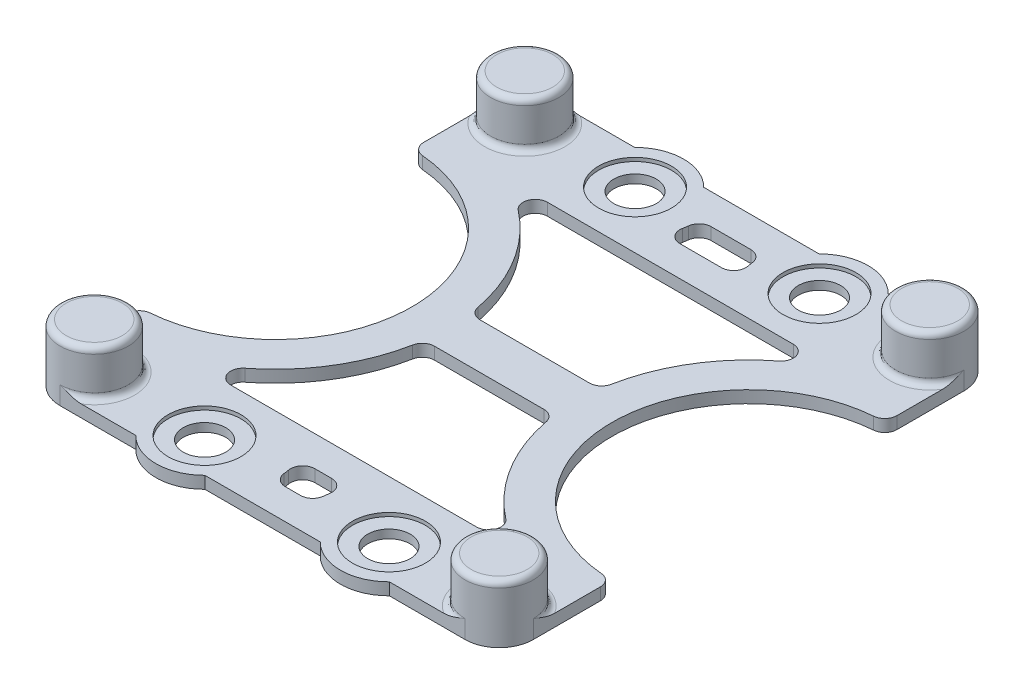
ISO-10303-21;
HEADER;
FILE_DESCRIPTION(('STEP AP214'),'2;1');
FILE_NAME('part.step','',(''),(''),'','','');
FILE_SCHEMA(('AUTOMOTIVE_DESIGN { 1 0 10303 214 1 1 1 1 }'));
ENDSEC;
DATA;
#1=APPLICATION_CONTEXT('core data for automotive mechanical design processes');
#2=APPLICATION_PROTOCOL_DEFINITION('international standard','automotive_design',2000,#1);
#3=PRODUCT_CONTEXT('',#1,'mechanical');
#4=PRODUCT('Part','Part','',(#3));
#5=PRODUCT_RELATED_PRODUCT_CATEGORY('part','',(#4));
#6=PRODUCT_DEFINITION_FORMATION('','',#4);
#7=PRODUCT_DEFINITION_CONTEXT('part definition',#1,'design');
#8=PRODUCT_DEFINITION('design','',#6,#7);
#9=PRODUCT_DEFINITION_SHAPE('','',#8);
#10=(LENGTH_UNIT() NAMED_UNIT(*) SI_UNIT(.MILLI.,.METRE.));
#11=(NAMED_UNIT(*) PLANE_ANGLE_UNIT() SI_UNIT($,.RADIAN.));
#12=(NAMED_UNIT(*) SI_UNIT($,.STERADIAN.) SOLID_ANGLE_UNIT());
#13=UNCERTAINTY_MEASURE_WITH_UNIT(LENGTH_MEASURE(1.E-05),#10,'distance_accuracy_value','');
#14=(GEOMETRIC_REPRESENTATION_CONTEXT(3) GLOBAL_UNCERTAINTY_ASSIGNED_CONTEXT((#13)) GLOBAL_UNIT_ASSIGNED_CONTEXT((#10,
#11,#12)) REPRESENTATION_CONTEXT('',''));
#15=CARTESIAN_POINT('',(0.,0.,0.));
#16=DIRECTION('',(0.,0.,1.));
#17=DIRECTION('',(1.,0.,0.));
#18=AXIS2_PLACEMENT_3D('',#15,#16,#17);
#19=CARTESIAN_POINT('',(0.,2.54,0.));
#20=DIRECTION('',(0.,-1.,0.));
#21=DIRECTION('',(0.,0.,-1.));
#22=AXIS2_PLACEMENT_3D('',#19,#20,#21);
#23=CYLINDRICAL_SURFACE('',#22,3.96875);
#24=CARTESIAN_POINT('',(0.,0.,0.));
#25=DIRECTION('',(0.,1.,0.));
#26=DIRECTION('',(0.,0.,1.));
#27=AXIS2_PLACEMENT_3D('',#24,#25,#26);
#28=CIRCLE('',#27,3.96875);
#29=CARTESIAN_POINT('',(0.,0.,3.96875));
#30=VERTEX_POINT('',#29);
#31=EDGE_CURVE('E1345',#30,#30,#28,.T.);
#32=ORIENTED_EDGE('',*,*,#31,.F.);
#33=EDGE_LOOP('',(#32));
#34=FACE_BOUND('',#33,.T.);
#35=CARTESIAN_POINT('',(0.,9.525,0.));
#36=DIRECTION('',(0.,1.,0.));
#37=DIRECTION('',(0.,0.,1.));
#38=AXIS2_PLACEMENT_3D('',#35,#36,#37);
#39=CIRCLE('',#38,3.96875);
#40=CARTESIAN_POINT('',(0.,9.525,3.96875));
#41=VERTEX_POINT('',#40);
#42=EDGE_CURVE('E1290',#41,#41,#39,.T.);
#43=ORIENTED_EDGE('',*,*,#42,.T.);
#44=EDGE_LOOP('',(#43));
#45=FACE_BOUND('',#44,.T.);
#46=ADVANCED_FACE('F39',(#34,#45),#23,.F.);
#47=CARTESIAN_POINT('',(84.690400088,2.54,0.));
#48=DIRECTION('',(0.,-1.,0.));
#49=DIRECTION('',(0.,0.,-1.));
#50=AXIS2_PLACEMENT_3D('',#47,#48,#49);
#51=CYLINDRICAL_SURFACE('',#50,3.96874999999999);
#52=CARTESIAN_POINT('',(84.690400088,0.,0.));
#53=DIRECTION('',(0.,1.,0.));
#54=DIRECTION('',(0.,0.,1.));
#55=AXIS2_PLACEMENT_3D('',#52,#53,#54);
#56=CIRCLE('',#55,3.96874999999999);
#57=CARTESIAN_POINT('',(84.690400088,0.,3.96874999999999));
#58=VERTEX_POINT('',#57);
#59=EDGE_CURVE('E1358',#58,#58,#56,.T.);
#60=ORIENTED_EDGE('',*,*,#59,.F.);
#61=EDGE_LOOP('',(#60));
#62=FACE_BOUND('',#61,.T.);
#63=CARTESIAN_POINT('',(84.690400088,9.525,0.));
#64=DIRECTION('',(0.,1.,0.));
#65=DIRECTION('',(0.,0.,1.));
#66=AXIS2_PLACEMENT_3D('',#63,#64,#65);
#67=CIRCLE('',#66,3.96874999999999);
#68=CARTESIAN_POINT('',(84.690400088,9.525,3.96874999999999));
#69=VERTEX_POINT('',#68);
#70=EDGE_CURVE('E1308',#69,#69,#67,.T.);
#71=ORIENTED_EDGE('',*,*,#70,.T.);
#72=EDGE_LOOP('',(#71));
#73=FACE_BOUND('',#72,.T.);
#74=ADVANCED_FACE('F719',(#62,#73),#51,.F.);
#75=CARTESIAN_POINT('',(84.690400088,2.54,-90.0404000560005));
#76=DIRECTION('',(0.,-1.,0.));
#77=DIRECTION('',(0.,0.,-1.));
#78=AXIS2_PLACEMENT_3D('',#75,#76,#77);
#79=CYLINDRICAL_SURFACE('',#78,3.96874999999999);
#80=CARTESIAN_POINT('',(84.690400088,0.,-90.0404000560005));
#81=DIRECTION('',(0.,1.,0.));
#82=DIRECTION('',(0.,0.,1.));
#83=AXIS2_PLACEMENT_3D('',#80,#81,#82);
#84=CIRCLE('',#83,3.96874999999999);
#85=CARTESIAN_POINT('',(84.690400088,0.,-86.0716500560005));
#86=VERTEX_POINT('',#85);
#87=EDGE_CURVE('E1362',#86,#86,#84,.T.);
#88=ORIENTED_EDGE('',*,*,#87,.F.);
#89=EDGE_LOOP('',(#88));
#90=FACE_BOUND('',#89,.T.);
#91=CARTESIAN_POINT('',(84.690400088,9.525,-90.0404000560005));
#92=DIRECTION('',(0.,1.,0.));
#93=DIRECTION('',(0.,0.,1.));
#94=AXIS2_PLACEMENT_3D('',#91,#92,#93);
#95=CIRCLE('',#94,3.96874999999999);
#96=CARTESIAN_POINT('',(84.690400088,9.525,-86.0716500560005));
#97=VERTEX_POINT('',#96);
#98=EDGE_CURVE('E1312',#97,#97,#95,.T.);
#99=ORIENTED_EDGE('',*,*,#98,.T.);
#100=EDGE_LOOP('',(#99));
#101=FACE_BOUND('',#100,.T.);
#102=ADVANCED_FACE('F725',(#90,#101),#79,.F.);
#103=CARTESIAN_POINT('',(-2.22044604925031E-13,2.54,-90.0404000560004));
#104=DIRECTION('',(0.,-1.,0.));
#105=DIRECTION('',(0.,0.,-1.));
#106=AXIS2_PLACEMENT_3D('',#103,#104,#105);
#107=CYLINDRICAL_SURFACE('',#106,3.96875);
#108=CARTESIAN_POINT('',(-2.22044604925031E-13,0.,-90.0404000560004));
#109=DIRECTION('',(0.,1.,0.));
#110=DIRECTION('',(0.,0.,1.));
#111=AXIS2_PLACEMENT_3D('',#108,#109,#110);
#112=CIRCLE('',#111,3.96875);
#113=CARTESIAN_POINT('',(-2.22044604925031E-13,0.,-86.0716500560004));
#114=VERTEX_POINT('',#113);
#115=EDGE_CURVE('E846',#114,#114,#112,.T.);
#116=ORIENTED_EDGE('',*,*,#115,.F.);
#117=EDGE_LOOP('',(#116));
#118=FACE_BOUND('',#117,.T.);
#119=CARTESIAN_POINT('',(-2.22044604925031E-13,9.525,-90.0404000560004));
#120=DIRECTION('',(0.,1.,0.));
#121=DIRECTION('',(0.,0.,1.));
#122=AXIS2_PLACEMENT_3D('',#119,#120,#121);
#123=CIRCLE('',#122,3.96875);
#124=CARTESIAN_POINT('',(-2.22044604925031E-13,9.525,-86.0716500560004));
#125=VERTEX_POINT('',#124);
#126=EDGE_CURVE('E430',#125,#125,#123,.T.);
#127=ORIENTED_EDGE('',*,*,#126,.T.);
#128=EDGE_LOOP('',(#127));
#129=FACE_BOUND('',#128,.T.);
#130=ADVANCED_FACE('F736',(#118,#129),#107,.F.);
#131=CARTESIAN_POINT('',(84.690400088,2.54,-97.1841500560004));
#132=DIRECTION('',(0.,0.,1.));
#133=DIRECTION('',(1.,0.,0.));
#134=AXIS2_PLACEMENT_3D('',#131,#132,#133);
#135=PLANE('',#134);
#136=DIRECTION('',(-1.,0.,0.));
#137=VECTOR('',#136,1.);
#138=CARTESIAN_POINT('',(84.690400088,0.,-97.1841500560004));
#139=LINE('',#138,#137);
#140=CARTESIAN_POINT('',(84.690400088,0.,-97.1841500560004));
#141=VERTEX_POINT('',#140);
#142=CARTESIAN_POINT('',(68.8577583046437,0.,-97.1841500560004));
#143=VERTEX_POINT('',#142);
#144=EDGE_CURVE('E440',#141,#143,#139,.T.);
#145=ORIENTED_EDGE('',*,*,#144,.T.);
#146=DIRECTION('',(0.,1.,0.));
#147=VECTOR('',#146,1.);
#148=CARTESIAN_POINT('',(68.8577583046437,0.,-97.1841500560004));
#149=LINE('',#148,#147);
#150=CARTESIAN_POINT('',(68.8577583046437,2.54,-97.1841500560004));
#151=VERTEX_POINT('',#150);
#152=EDGE_CURVE('E422',#143,#151,#149,.T.);
#153=ORIENTED_EDGE('',*,*,#152,.T.);
#154=DIRECTION('',(-1.,0.,0.));
#155=VECTOR('',#154,1.);
#156=CARTESIAN_POINT('',(84.690400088,2.54,-97.1841500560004));
#157=LINE('',#156,#155);
#158=CARTESIAN_POINT('',(80.245400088,2.54,-97.1841500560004));
#159=VERTEX_POINT('',#158);
#160=EDGE_CURVE('E437',#159,#151,#157,.T.);
#161=ORIENTED_EDGE('',*,*,#160,.F.);
#162=CARTESIAN_POINT('',(80.245400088,2.54,-97.1841500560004));
#163=CARTESIAN_POINT('',(80.3304939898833,2.54001299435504,-97.1841500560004));
#164=CARTESIAN_POINT('',(80.4155600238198,2.54238620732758,-97.1841500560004));
#165=CARTESIAN_POINT('',(80.585422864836,2.55135666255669,-97.1841500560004));
#166=CARTESIAN_POINT('',(80.6702198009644,2.55795141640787,-97.1841500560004));
#167=CARTESIAN_POINT('',(80.8391964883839,2.57484622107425,-97.1841500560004));
#168=CARTESIAN_POINT('',(80.9233772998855,2.58513592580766,-97.1841500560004));
#169=CARTESIAN_POINT('',(81.0912772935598,2.60901552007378,-97.1841500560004));
#170=CARTESIAN_POINT('',(81.1749963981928,2.62260594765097,-97.1841500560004));
#171=CARTESIAN_POINT('',(81.4236493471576,2.66745853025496,-97.1841500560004));
#172=CARTESIAN_POINT('',(81.5878187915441,2.7029920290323,-97.1841500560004));
#173=CARTESIAN_POINT('',(81.9140075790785,2.7831326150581,-97.1841500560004));
#174=CARTESIAN_POINT('',(82.0760250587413,2.82774708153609,-97.1841500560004));
#175=CARTESIAN_POINT('',(82.4450388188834,2.93815282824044,-97.1841500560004));
#176=CARTESIAN_POINT('',(82.651318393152,3.00632015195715,-97.1841500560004));
#177=CARTESIAN_POINT('',(83.0609647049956,3.15095604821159,-97.1841500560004));
#178=CARTESIAN_POINT('',(83.2643304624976,3.22742734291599,-97.1841500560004));
#179=CARTESIAN_POINT('',(83.8722147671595,3.46510194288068,-97.1841500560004));
#180=CARTESIAN_POINT('',(84.2735749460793,3.63425209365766,-97.1841500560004));
#181=CARTESIAN_POINT('',(84.6800159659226,3.80562168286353,-97.1841500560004));
#182=CARTESIAN_POINT('',(84.68520803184,3.8078108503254,-97.1841500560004));
#183=CARTESIAN_POINT('',(84.690400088,3.81,-97.1841500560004));
#184=B_SPLINE_CURVE_WITH_KNOTS('',3,(#162,#163,#164,#165,#166,#167,#168,#169,#170,#171,#172,
#173,#174,#175,#176,#177,#178,#179,#180,#181,#182,#183),.UNSPECIFIED.,.F.,.F.,(4,2,2,2,2,2,2,2,
2,2,4),(0.,0.255208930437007,0.510267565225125,0.764617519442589,1.0190089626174,
1.52255357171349,2.0265090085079,2.67798665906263,3.32967852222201,4.63604569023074,
4.65294983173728),.UNSPECIFIED.);
#185=CARTESIAN_POINT('',(84.690400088,3.81,-97.1841500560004));
#186=VERTEX_POINT('',#185);
#187=EDGE_CURVE('E594',#159,#186,#184,.T.);
#188=ORIENTED_EDGE('',*,*,#187,.T.);
#189=DIRECTION('',(0.,-1.,0.));
#190=VECTOR('',#189,1.);
#191=CARTESIAN_POINT('',(84.690400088,2.54,-97.1841500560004));
#192=LINE('',#191,#190);
#193=EDGE_CURVE('E502',#186,#141,#192,.T.);
#194=ORIENTED_EDGE('',*,*,#193,.T.);
#195=EDGE_LOOP('',(#145,#153,#161,#188,#194));
#196=FACE_BOUND('',#195,.T.);
#197=ADVANCED_FACE('F435',(#196),#135,.F.);
#198=CARTESIAN_POINT('',(54.4088917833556,2.54,-97.1841500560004));
#199=VERTEX_POINT('',#198);
#200=CARTESIAN_POINT('',(30.281508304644,2.54,-97.1841500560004));
#201=VERTEX_POINT('',#200);
#202=EDGE_CURVE('E450',#199,#201,#157,.T.);
#203=ORIENTED_EDGE('',*,*,#202,.F.);
#204=DIRECTION('',(0.,1.,0.));
#205=VECTOR('',#204,1.);
#206=CARTESIAN_POINT('',(54.4088917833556,0.,-97.1841500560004));
#207=LINE('',#206,#205);
#208=CARTESIAN_POINT('',(54.4088917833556,0.,-97.1841500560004));
#209=VERTEX_POINT('',#208);
#210=EDGE_CURVE('E425',#199,#209,#207,.F.);
#211=ORIENTED_EDGE('',*,*,#210,.T.);
#212=CARTESIAN_POINT('',(30.281508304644,0.,-97.1841500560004));
#213=VERTEX_POINT('',#212);
#214=EDGE_CURVE('E850',#209,#213,#139,.T.);
#215=ORIENTED_EDGE('',*,*,#214,.T.);
#216=DIRECTION('',(0.,1.,0.));
#217=VECTOR('',#216,1.);
#218=CARTESIAN_POINT('',(30.281508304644,0.,-97.1841500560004));
#219=LINE('',#218,#217);
#220=EDGE_CURVE('E2292',#213,#201,#219,.T.);
#221=ORIENTED_EDGE('',*,*,#220,.T.);
#222=EDGE_LOOP('',(#203,#211,#215,#221));
#223=FACE_BOUND('',#222,.T.);
#224=ADVANCED_FACE('F591',(#223),#135,.F.);
#225=CARTESIAN_POINT('',(0.,2.54,7.14375));
#226=DIRECTION('',(0.,0.,-1.));
#227=DIRECTION('',(-1.,0.,0.));
#228=AXIS2_PLACEMENT_3D('',#225,#226,#227);
#229=PLANE('',#228);
#230=DIRECTION('',(1.,0.,0.));
#231=VECTOR('',#230,1.);
#232=CARTESIAN_POINT('',(0.,0.,7.14375));
#233=LINE('',#232,#231);
#234=CARTESIAN_POINT('',(30.281508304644,0.,7.14375));
#235=VERTEX_POINT('',#234);
#236=CARTESIAN_POINT('',(54.4088917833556,0.,7.14375));
#237=VERTEX_POINT('',#236);
#238=EDGE_CURVE('E864',#235,#237,#233,.T.);
#239=ORIENTED_EDGE('',*,*,#238,.T.);
#240=DIRECTION('',(0.,1.,0.));
#241=VECTOR('',#240,1.);
#242=CARTESIAN_POINT('',(54.4088917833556,0.,7.14375));
#243=LINE('',#242,#241);
#244=CARTESIAN_POINT('',(54.4088917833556,2.54,7.14375));
#245=VERTEX_POINT('',#244);
#246=EDGE_CURVE('E2300',#237,#245,#243,.T.);
#247=ORIENTED_EDGE('',*,*,#246,.T.);
#248=DIRECTION('',(1.,0.,0.));
#249=VECTOR('',#248,1.);
#250=CARTESIAN_POINT('',(0.,2.54,7.14375));
#251=LINE('',#250,#249);
#252=CARTESIAN_POINT('',(30.281508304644,2.54,7.14375));
#253=VERTEX_POINT('',#252);
#254=EDGE_CURVE('E832',#253,#245,#251,.T.);
#255=ORIENTED_EDGE('',*,*,#254,.F.);
#256=DIRECTION('',(0.,1.,0.));
#257=VECTOR('',#256,1.);
#258=CARTESIAN_POINT('',(30.281508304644,0.,7.14375));
#259=LINE('',#258,#257);
#260=EDGE_CURVE('E603',#253,#235,#259,.F.);
#261=ORIENTED_EDGE('',*,*,#260,.T.);
#262=EDGE_LOOP('',(#239,#247,#255,#261));
#263=FACE_BOUND('',#262,.T.);
#264=ADVANCED_FACE('F783',(#263),#229,.F.);
#265=CARTESIAN_POINT('',(0.,0.,7.14375));
#266=VERTEX_POINT('',#265);
#267=CARTESIAN_POINT('',(15.8326417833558,0.,7.14375));
#268=VERTEX_POINT('',#267);
#269=EDGE_CURVE('E861',#266,#268,#233,.T.);
#270=ORIENTED_EDGE('',*,*,#269,.T.);
#271=DIRECTION('',(0.,1.,0.));
#272=VECTOR('',#271,1.);
#273=CARTESIAN_POINT('',(15.8326417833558,0.,7.14375));
#274=LINE('',#273,#272);
#275=CARTESIAN_POINT('',(15.8326417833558,2.54,7.14375));
#276=VERTEX_POINT('',#275);
#277=EDGE_CURVE('E2332',#268,#276,#274,.T.);
#278=ORIENTED_EDGE('',*,*,#277,.T.);
#279=CARTESIAN_POINT('',(4.445,2.54,7.14375));
#280=VERTEX_POINT('',#279);
#281=EDGE_CURVE('E829',#280,#276,#251,.T.);
#282=ORIENTED_EDGE('',*,*,#281,.F.);
#283=CARTESIAN_POINT('',(4.445,2.54,7.14375));
#284=CARTESIAN_POINT('',(4.35990609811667,2.54001299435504,7.14375));
#285=CARTESIAN_POINT('',(4.27484006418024,2.54238620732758,7.14375));
#286=CARTESIAN_POINT('',(4.10497722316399,2.55135666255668,7.14375));
#287=CARTESIAN_POINT('',(4.02018028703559,2.55795141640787,7.14375));
#288=CARTESIAN_POINT('',(3.85120359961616,2.57484622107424,7.14375));
#289=CARTESIAN_POINT('',(3.7670227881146,2.58513592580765,7.14375));
#290=CARTESIAN_POINT('',(3.5991227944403,2.60901552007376,7.14375));
#291=CARTESIAN_POINT('',(3.51540368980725,2.62260594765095,7.14375));
#292=CARTESIAN_POINT('',(3.26675074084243,2.66745853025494,7.14375));
#293=CARTESIAN_POINT('',(3.10258129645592,2.70299202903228,7.14375));
#294=CARTESIAN_POINT('',(2.7763925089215,2.78313261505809,7.14375));
#295=CARTESIAN_POINT('',(2.61437502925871,2.82774708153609,7.14375));
#296=CARTESIAN_POINT('',(2.24536126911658,2.93815282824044,7.14375));
#297=CARTESIAN_POINT('',(2.039081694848,3.00632015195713,7.14375));
#298=CARTESIAN_POINT('',(1.6294353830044,3.15095604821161,7.14375));
#299=CARTESIAN_POINT('',(1.42606962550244,3.22742734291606,7.14375));
#300=CARTESIAN_POINT('',(0.818185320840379,3.46510194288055,7.14375));
#301=CARTESIAN_POINT('',(0.416825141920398,3.6342520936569,7.14375));
#302=CARTESIAN_POINT('',(0.0103841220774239,3.80562168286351,7.14375));
#303=CARTESIAN_POINT('',(0.00519205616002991,3.80781085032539,7.14375));
#304=CARTESIAN_POINT('',(0.,3.81,7.14375));
#305=B_SPLINE_CURVE_WITH_KNOTS('',3,(#283,#284,#285,#286,#287,#288,#289,#290,#291,#292,#293,
#294,#295,#296,#297,#298,#299,#300,#301,#302,#303,#304),.UNSPECIFIED.,.F.,.F.,(4,2,2,2,2,2,2,2,
2,2,4),(0.,0.255208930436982,0.510267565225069,0.764617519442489,1.01900896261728,
1.52255357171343,2.0265090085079,2.67798665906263,3.32967852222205,4.63604569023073,
4.65294983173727),.UNSPECIFIED.);
#306=CARTESIAN_POINT('',(0.,3.81,7.14375));
#307=VERTEX_POINT('',#306);
#308=EDGE_CURVE('E772',#280,#307,#305,.T.);
#309=ORIENTED_EDGE('',*,*,#308,.T.);
#310=DIRECTION('',(0.,-1.,0.));
#311=VECTOR('',#310,1.);
#312=CARTESIAN_POINT('',(0.,2.54,7.14375));
#313=LINE('',#312,#311);
#314=EDGE_CURVE('E486',#307,#266,#313,.T.);
#315=ORIENTED_EDGE('',*,*,#314,.T.);
#316=EDGE_LOOP('',(#270,#278,#282,#309,#315));
#317=FACE_BOUND('',#316,.T.);
#318=ADVANCED_FACE('F784',(#317),#229,.F.);
#319=CARTESIAN_POINT('',(-7.14375000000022,2.54,-90.0404000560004));
#320=DIRECTION('',(1.,0.,0.));
#321=DIRECTION('',(0.,0.,-1.));
#322=AXIS2_PLACEMENT_3D('',#319,#320,#321);
#323=PLANE('',#322);
#324=DIRECTION('',(0.,0.,1.));
#325=VECTOR('',#324,1.);
#326=CARTESIAN_POINT('',(-7.14375000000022,0.,-90.0404000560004));
#327=LINE('',#326,#325);
#328=CARTESIAN_POINT('',(-7.14375000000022,0.,-90.0404000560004));
#329=VERTEX_POINT('',#328);
#330=CARTESIAN_POINT('',(-7.14375000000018,0.,-76.0313532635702));
#331=VERTEX_POINT('',#330);
#332=EDGE_CURVE('E854',#329,#331,#327,.T.);
#333=ORIENTED_EDGE('',*,*,#332,.T.);
#334=DIRECTION('',(0.,1.,0.));
#335=VECTOR('',#334,1.);
#336=CARTESIAN_POINT('',(-7.14375000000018,2.54,-76.0313532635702));
#337=LINE('',#336,#335);
#338=CARTESIAN_POINT('',(-7.14375000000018,2.54,-76.0313532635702));
#339=VERTEX_POINT('',#338);
#340=EDGE_CURVE('E929',#331,#339,#337,.T.);
#341=ORIENTED_EDGE('',*,*,#340,.T.);
#342=DIRECTION('',(0.,0.,1.));
#343=VECTOR('',#342,1.);
#344=CARTESIAN_POINT('',(-7.14375000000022,2.54,-90.0404000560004));
#345=LINE('',#344,#343);
#346=CARTESIAN_POINT('',(-7.14375000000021,2.54,-85.5954000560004));
#347=VERTEX_POINT('',#346);
#348=EDGE_CURVE('E455',#347,#339,#345,.T.);
#349=ORIENTED_EDGE('',*,*,#348,.F.);
#350=CARTESIAN_POINT('',(-7.14375000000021,2.54,-85.5954000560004));
#351=CARTESIAN_POINT('',(-7.14375000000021,2.54001299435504,-85.6804939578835));
#352=CARTESIAN_POINT('',(-7.14375000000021,2.54238620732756,-85.7655599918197));
#353=CARTESIAN_POINT('',(-7.14375000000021,2.55135666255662,-85.9354228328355));
#354=CARTESIAN_POINT('',(-7.14375000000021,2.55795141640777,-86.0202197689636));
#355=CARTESIAN_POINT('',(-7.14375000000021,2.57484622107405,-86.1891964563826));
#356=CARTESIAN_POINT('',(-7.14375000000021,2.58513592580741,-86.2733772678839));
#357=CARTESIAN_POINT('',(-7.14375000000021,2.60901552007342,-86.4412772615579));
#358=CARTESIAN_POINT('',(-7.14375000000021,2.62260594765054,-86.5249963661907));
#359=CARTESIAN_POINT('',(-7.14375000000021,2.66745853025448,-86.7736493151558));
#360=CARTESIAN_POINT('',(-7.14375000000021,2.70299202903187,-86.9378187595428));
#361=CARTESIAN_POINT('',(-7.14375000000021,2.78313261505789,-87.2640075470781));
#362=CARTESIAN_POINT('',(-7.14375000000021,2.82774708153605,-87.4260250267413));
#363=CARTESIAN_POINT('',(-7.14375000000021,2.93815282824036,-87.7950387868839));
#364=CARTESIAN_POINT('',(-7.14375000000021,3.00632015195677,-88.0013183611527));
#365=CARTESIAN_POINT('',(-7.14375000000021,3.1509560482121,-88.4109646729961));
#366=CARTESIAN_POINT('',(-7.14375000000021,3.22742734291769,-88.6143304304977));
#367=CARTESIAN_POINT('',(-7.14375000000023,3.46510194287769,-89.2222147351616));
#368=CARTESIAN_POINT('',(-7.14375000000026,3.63425209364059,-89.6235749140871));
#369=CARTESIAN_POINT('',(-7.14375000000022,3.80562168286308,-90.0300159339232));
#370=CARTESIAN_POINT('',(-7.14375000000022,3.80781085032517,-90.0352079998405));
#371=CARTESIAN_POINT('',(-7.14375000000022,3.81,-90.0404000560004));
#372=B_SPLINE_CURVE_WITH_KNOTS('',3,(#350,#351,#352,#353,#354,#355,#356,#357,#358,#359,#360,
#361,#362,#363,#364,#365,#366,#367,#368,#369,#370,#371),.UNSPECIFIED.,.F.,.F.,(4,2,2,2,2,2,2,2,
2,2,4),(0.,0.255208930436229,0.510267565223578,0.764617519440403,1.01900896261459,
1.52255357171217,2.0265090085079,2.67798665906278,3.32967852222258,4.63604569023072,
4.65294983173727),.UNSPECIFIED.);
#373=CARTESIAN_POINT('',(-7.14375000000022,3.81,-90.0404000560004));
#374=VERTEX_POINT('',#373);
#375=EDGE_CURVE('E573',#347,#374,#372,.T.);
#376=ORIENTED_EDGE('',*,*,#375,.T.);
#377=DIRECTION('',(0.,-1.,0.));
#378=VECTOR('',#377,1.);
#379=CARTESIAN_POINT('',(-7.14375000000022,2.54,-90.0404000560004));
#380=LINE('',#379,#378);
#381=EDGE_CURVE('E494',#374,#329,#380,.T.);
#382=ORIENTED_EDGE('',*,*,#381,.T.);
#383=EDGE_LOOP('',(#333,#341,#349,#376,#382));
#384=FACE_BOUND('',#383,.T.);
#385=ADVANCED_FACE('F792',(#384),#323,.F.);
#386=CARTESIAN_POINT('',(91.834150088,2.54,0.));
#387=DIRECTION('',(-1.,0.,0.));
#388=DIRECTION('',(0.,0.,1.));
#389=AXIS2_PLACEMENT_3D('',#386,#387,#388);
#390=PLANE('',#389);
#391=DIRECTION('',(0.,0.,-1.));
#392=VECTOR('',#391,1.);
#393=CARTESIAN_POINT('',(91.834150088,0.,0.));
#394=LINE('',#393,#392);
#395=CARTESIAN_POINT('',(91.834150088,0.,0.));
#396=VERTEX_POINT('',#395);
#397=CARTESIAN_POINT('',(91.834150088,0.,-14.0090467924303));
#398=VERTEX_POINT('',#397);
#399=EDGE_CURVE('E459',#396,#398,#394,.T.);
#400=ORIENTED_EDGE('',*,*,#399,.T.);
#401=DIRECTION('',(0.,1.,0.));
#402=VECTOR('',#401,1.);
#403=CARTESIAN_POINT('',(91.834150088,2.54,-14.0090467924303));
#404=LINE('',#403,#402);
#405=CARTESIAN_POINT('',(91.834150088,2.54,-14.0090467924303));
#406=VERTEX_POINT('',#405);
#407=EDGE_CURVE('E916',#398,#406,#404,.T.);
#408=ORIENTED_EDGE('',*,*,#407,.T.);
#409=DIRECTION('',(0.,0.,-1.));
#410=VECTOR('',#409,1.);
#411=CARTESIAN_POINT('',(91.834150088,2.54,0.));
#412=LINE('',#411,#410);
#413=CARTESIAN_POINT('',(91.834150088,2.54,-4.445));
#414=VERTEX_POINT('',#413);
#415=EDGE_CURVE('E479',#414,#406,#412,.T.);
#416=ORIENTED_EDGE('',*,*,#415,.F.);
#417=CARTESIAN_POINT('',(91.834150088,2.54,-4.445));
#418=CARTESIAN_POINT('',(91.834150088,2.54001299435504,-4.3599060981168));
#419=CARTESIAN_POINT('',(91.834150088,2.54238620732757,-4.2748400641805));
#420=CARTESIAN_POINT('',(91.834150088,2.55135666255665,-4.10497722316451));
#421=CARTESIAN_POINT('',(91.834150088,2.55795141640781,-4.02018028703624));
#422=CARTESIAN_POINT('',(91.834150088,2.57484622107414,-3.85120359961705));
#423=CARTESIAN_POINT('',(91.834150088,2.58513592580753,-3.76702278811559));
#424=CARTESIAN_POINT('',(91.834150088,2.60901552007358,-3.59912279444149));
#425=CARTESIAN_POINT('',(91.834150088,2.62260594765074,-3.51540368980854));
#426=CARTESIAN_POINT('',(91.834150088,2.6674585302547,-3.26675074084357));
#427=CARTESIAN_POINT('',(91.834150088,2.70299202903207,-3.10258129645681));
#428=CARTESIAN_POINT('',(91.834150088,2.78313261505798,-2.77639250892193));
#429=CARTESIAN_POINT('',(91.834150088,2.82774708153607,-2.61437502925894));
#430=CARTESIAN_POINT('',(91.834150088,2.9381528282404,-2.24536126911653));
#431=CARTESIAN_POINT('',(91.834150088,3.00632015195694,-2.03908169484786));
#432=CARTESIAN_POINT('',(91.834150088,3.15095604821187,-1.62943538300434));
#433=CARTESIAN_POINT('',(91.834150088,3.22742734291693,-1.42606962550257));
#434=CARTESIAN_POINT('',(91.834150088,3.46510194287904,-0.818185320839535));
#435=CARTESIAN_POINT('',(91.834150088,3.63425209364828,-0.416825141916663));
#436=CARTESIAN_POINT('',(91.834150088,3.80562168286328,-0.0103841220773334));
#437=CARTESIAN_POINT('',(91.834150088,3.80781085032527,-0.00519205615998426));
#438=CARTESIAN_POINT('',(91.834150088,3.81,0.));
#439=B_SPLINE_CURVE_WITH_KNOTS('',3,(#417,#418,#419,#420,#421,#422,#423,#424,#425,#426,#427,
#428,#429,#430,#431,#432,#433,#434,#435,#436,#437,#438),.UNSPECIFIED.,.F.,.F.,(4,2,2,2,2,2,2,2,
2,2,4),(0.,0.255208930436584,0.510267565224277,0.764617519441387,1.01900896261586,
1.52255357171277,2.0265090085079,2.67798665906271,3.32967852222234,4.63604569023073,
4.65294983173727),.UNSPECIFIED.);
#440=CARTESIAN_POINT('',(91.834150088,3.81,0.));
#441=VERTEX_POINT('',#440);
#442=EDGE_CURVE('E756',#414,#441,#439,.T.);
#443=ORIENTED_EDGE('',*,*,#442,.T.);
#444=DIRECTION('',(0.,-1.,0.));
#445=VECTOR('',#444,1.);
#446=CARTESIAN_POINT('',(91.834150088,2.54,0.));
#447=LINE('',#446,#445);
#448=EDGE_CURVE('E478',#441,#396,#447,.T.);
#449=ORIENTED_EDGE('',*,*,#448,.T.);
#450=EDGE_LOOP('',(#400,#408,#416,#443,#449));
#451=FACE_BOUND('',#450,.T.);
#452=ADVANCED_FACE('F744',(#451),#390,.F.);
#453=CARTESIAN_POINT('',(84.690400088,2.54,-90.0404000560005));
#454=DIRECTION('',(0.,1.,0.));
#455=DIRECTION('',(0.,0.,1.));
#456=AXIS2_PLACEMENT_3D('',#453,#454,#455);
#457=PLANE('',#456);
#458=CARTESIAN_POINT('',(23.0570750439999,2.54,0.));
#459=DIRECTION('',(0.,1.,0.));
#460=DIRECTION('',(0.,0.,1.));
#461=AXIS2_PLACEMENT_3D('',#458,#459,#460);
#462=CIRCLE('',#461,7.62);
#463=CARTESIAN_POINT('',(23.0570750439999,2.54,7.62000000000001));
#464=VERTEX_POINT('',#463);
#465=EDGE_CURVE('E1152',#464,#464,#462,.T.);
#466=ORIENTED_EDGE('',*,*,#465,.F.);
#467=EDGE_LOOP('',(#466));
#468=FACE_BOUND('',#467,.T.);
#469=CARTESIAN_POINT('',(61.6333250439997,2.54,0.));
#470=DIRECTION('',(0.,1.,0.));
#471=DIRECTION('',(0.,0.,1.));
#472=AXIS2_PLACEMENT_3D('',#469,#470,#471);
#473=CIRCLE('',#472,7.62);
#474=CARTESIAN_POINT('',(61.6333250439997,2.54,7.62));
#475=VERTEX_POINT('',#474);
#476=EDGE_CURVE('E1163',#475,#475,#473,.T.);
#477=ORIENTED_EDGE('',*,*,#476,.F.);
#478=EDGE_LOOP('',(#477));
#479=FACE_BOUND('',#478,.T.);
#480=CARTESIAN_POINT('',(61.6333250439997,2.54,-90.0404000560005));
#481=DIRECTION('',(0.,1.,0.));
#482=DIRECTION('',(0.,0.,1.));
#483=AXIS2_PLACEMENT_3D('',#480,#481,#482);
#484=CIRCLE('',#483,7.62);
#485=CARTESIAN_POINT('',(61.6333250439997,2.54,-82.4204000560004));
#486=VERTEX_POINT('',#485);
#487=EDGE_CURVE('E2113',#486,#486,#484,.T.);
#488=ORIENTED_EDGE('',*,*,#487,.F.);
#489=EDGE_LOOP('',(#488));
#490=FACE_BOUND('',#489,.T.);
#491=CARTESIAN_POINT('',(23.0570750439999,2.54,-90.0404000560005));
#492=DIRECTION('',(0.,1.,0.));
#493=DIRECTION('',(0.,0.,1.));
#494=AXIS2_PLACEMENT_3D('',#491,#492,#493);
#495=CIRCLE('',#494,7.62);
#496=CARTESIAN_POINT('',(23.0570750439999,2.54,-82.4204000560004));
#497=VERTEX_POINT('',#496);
#498=EDGE_CURVE('E1172',#497,#497,#495,.T.);
#499=ORIENTED_EDGE('',*,*,#498,.F.);
#500=EDGE_LOOP('',(#499));
#501=FACE_BOUND('',#500,.T.);
#502=CARTESIAN_POINT('',(61.6333250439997,2.54,-90.0404000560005));
#503=DIRECTION('',(0.,-1.,0.));
#504=DIRECTION('',(0.,0.,1.));
#505=AXIS2_PLACEMENT_3D('',#502,#503,#504);
#506=CIRCLE('',#505,12.7);
#507=CARTESIAN_POINT('',(49.1845456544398,2.54,-87.5268583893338));
#508=VERTEX_POINT('',#507);
#509=CARTESIAN_POINT('',(49.0169718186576,2.54,-88.5851917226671));
#510=VERTEX_POINT('',#509);
#511=EDGE_CURVE('E1171',#508,#510,#506,.T.);
#512=ORIENTED_EDGE('',*,*,#511,.F.);
#513=CARTESIAN_POINT('',(46.6947897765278,2.54,-87.0241500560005));
#514=DIRECTION('',(0.,1.,0.));
#515=DIRECTION('',(0.,0.,1.));
#516=AXIS2_PLACEMENT_3D('',#513,#514,#515);
#517=CIRCLE('',#516,2.54);
#518=CARTESIAN_POINT('',(46.6947897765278,2.54,-84.4841500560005));
#519=VERTEX_POINT('',#518);
#520=EDGE_CURVE('E1087',#508,#519,#517,.F.);
#521=ORIENTED_EDGE('',*,*,#520,.T.);
#522=DIRECTION('',(1.,0.,0.));
#523=VECTOR('',#522,1.);
#524=CARTESIAN_POINT('',(34.4771488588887,2.54,-84.4841500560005));
#525=LINE('',#524,#523);
#526=CARTESIAN_POINT('',(37.9956103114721,2.54,-84.4841500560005));
#527=VERTEX_POINT('',#526);
#528=EDGE_CURVE('E1248',#527,#519,#525,.T.);
#529=ORIENTED_EDGE('',*,*,#528,.F.);
#530=CARTESIAN_POINT('',(37.9956103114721,2.54,-87.0241500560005));
#531=DIRECTION('',(0.,1.,0.));
#532=DIRECTION('',(0.,0.,1.));
#533=AXIS2_PLACEMENT_3D('',#530,#531,#532);
#534=CIRCLE('',#533,2.54);
#535=CARTESIAN_POINT('',(35.5058544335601,2.54,-87.5268583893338));
#536=VERTEX_POINT('',#535);
#537=EDGE_CURVE('E1081',#527,#536,#534,.F.);
#538=ORIENTED_EDGE('',*,*,#537,.T.);
#539=CARTESIAN_POINT('',(23.0570750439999,2.54,-90.0404000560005));
#540=DIRECTION('',(0.,-1.,0.));
#541=DIRECTION('',(0.,0.,1.));
#542=AXIS2_PLACEMENT_3D('',#539,#540,#541);
#543=CIRCLE('',#542,12.7000000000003);
#544=CARTESIAN_POINT('',(35.6734282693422,2.54,-88.5851917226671));
#545=VERTEX_POINT('',#544);
#546=EDGE_CURVE('E1266',#545,#536,#543,.T.);
#547=ORIENTED_EDGE('',*,*,#546,.F.);
#548=CARTESIAN_POINT('',(38.1966989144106,2.54,-88.2941500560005));
#549=DIRECTION('',(0.,1.,0.));
#550=DIRECTION('',(0.,0.,1.));
#551=AXIS2_PLACEMENT_3D('',#548,#549,#550);
#552=CIRCLE('',#551,2.54);
#553=CARTESIAN_POINT('',(38.1966989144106,2.54,-90.8341500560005));
#554=VERTEX_POINT('',#553);
#555=EDGE_CURVE('E1075',#545,#554,#552,.F.);
#556=ORIENTED_EDGE('',*,*,#555,.T.);
#557=DIRECTION('',(-1.,0.,0.));
#558=VECTOR('',#557,1.);
#559=CARTESIAN_POINT('',(48.9581540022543,2.54,-90.8341500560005));
#560=LINE('',#559,#558);
#561=CARTESIAN_POINT('',(46.4937011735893,2.54,-90.8341500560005));
#562=VERTEX_POINT('',#561);
#563=EDGE_CURVE('E1262',#562,#554,#560,.T.);
#564=ORIENTED_EDGE('',*,*,#563,.F.);
#565=CARTESIAN_POINT('',(46.4937011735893,2.54,-88.2941500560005));
#566=DIRECTION('',(0.,1.,0.));
#567=DIRECTION('',(0.,0.,1.));
#568=AXIS2_PLACEMENT_3D('',#565,#566,#567);
#569=CIRCLE('',#568,2.54);
#570=EDGE_CURVE('E1069',#562,#510,#569,.F.);
#571=ORIENTED_EDGE('',*,*,#570,.T.);
#572=EDGE_LOOP('',(#512,#521,#529,#538,#547,#556,#564,#571));
#573=FACE_BOUND('',#572,.T.);
#574=CARTESIAN_POINT('',(61.6333250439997,2.54,0.));
#575=DIRECTION('',(0.,-1.,0.));
#576=DIRECTION('',(0.,0.,1.));
#577=AXIS2_PLACEMENT_3D('',#574,#575,#576);
#578=CIRCLE('',#577,15.24);
#579=CARTESIAN_POINT('',(46.4670060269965,2.54,-1.49678571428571));
#580=VERTEX_POINT('',#579);
#581=CARTESIAN_POINT('',(46.6142195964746,2.54,-2.58535714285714));
#582=VERTEX_POINT('',#581);
#583=EDGE_CURVE('E1227',#580,#582,#578,.T.);
#584=ORIENTED_EDGE('',*,*,#583,.F.);
#585=CARTESIAN_POINT('',(43.9392861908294,2.54,-1.74625));
#586=DIRECTION('',(0.,1.,0.));
#587=DIRECTION('',(0.,0.,1.));
#588=AXIS2_PLACEMENT_3D('',#585,#586,#587);
#589=CIRCLE('',#588,2.54);
#590=CARTESIAN_POINT('',(43.9392861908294,2.54,0.79375));
#591=VERTEX_POINT('',#590);
#592=EDGE_CURVE('E1057',#580,#591,#589,.F.);
#593=ORIENTED_EDGE('',*,*,#592,.T.);
#594=DIRECTION('',(1.,0.,0.));
#595=VECTOR('',#594,1.);
#596=CARTESIAN_POINT('',(46.4140096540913,2.54,0.793749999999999));
#597=LINE('',#596,#595);
#598=CARTESIAN_POINT('',(40.7511138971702,2.54,0.79375));
#599=VERTEX_POINT('',#598);
#600=EDGE_CURVE('E1216',#599,#591,#597,.T.);
#601=ORIENTED_EDGE('',*,*,#600,.F.);
#602=CARTESIAN_POINT('',(40.7511138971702,2.54,-1.74625));
#603=DIRECTION('',(0.,1.,0.));
#604=DIRECTION('',(0.,0.,1.));
#605=AXIS2_PLACEMENT_3D('',#602,#603,#604);
#606=CIRCLE('',#605,2.54);
#607=CARTESIAN_POINT('',(38.223394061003,2.54,-1.49678571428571));
#608=VERTEX_POINT('',#607);
#609=EDGE_CURVE('E1051',#599,#608,#606,.F.);
#610=ORIENTED_EDGE('',*,*,#609,.T.);
#611=CARTESIAN_POINT('',(23.0570750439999,2.54,0.));
#612=DIRECTION('',(0.,-1.,0.));
#613=DIRECTION('',(0.,0.,1.));
#614=AXIS2_PLACEMENT_3D('',#611,#612,#613);
#615=CIRCLE('',#614,15.24);
#616=CARTESIAN_POINT('',(38.076180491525,2.54,-2.58535714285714));
#617=VERTEX_POINT('',#616);
#618=EDGE_CURVE('E1236',#617,#608,#615,.T.);
#619=ORIENTED_EDGE('',*,*,#618,.F.);
#620=CARTESIAN_POINT('',(40.5793647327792,2.54,-3.01625));
#621=DIRECTION('',(0.,1.,0.));
#622=DIRECTION('',(0.,0.,1.));
#623=AXIS2_PLACEMENT_3D('',#620,#621,#622);
#624=CIRCLE('',#623,2.54);
#625=CARTESIAN_POINT('',(40.5793647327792,2.54,-5.55625));
#626=VERTEX_POINT('',#625);
#627=EDGE_CURVE('E1045',#617,#626,#624,.F.);
#628=ORIENTED_EDGE('',*,*,#627,.T.);
#629=DIRECTION('',(-1.,0.,0.));
#630=VECTOR('',#629,1.);
#631=CARTESIAN_POINT('',(37.2481174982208,2.54,-5.55625));
#632=LINE('',#631,#630);
#633=CARTESIAN_POINT('',(44.1110353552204,2.54,-5.55625));
#634=VERTEX_POINT('',#633);
#635=EDGE_CURVE('E1231',#634,#626,#632,.T.);
#636=ORIENTED_EDGE('',*,*,#635,.F.);
#637=CARTESIAN_POINT('',(44.1110353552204,2.54,-3.01625));
#638=DIRECTION('',(0.,1.,0.));
#639=DIRECTION('',(0.,0.,1.));
#640=AXIS2_PLACEMENT_3D('',#637,#638,#639);
#641=CIRCLE('',#640,2.54);
#642=EDGE_CURVE('E1063',#634,#582,#641,.F.);
#643=ORIENTED_EDGE('',*,*,#642,.T.);
#644=EDGE_LOOP('',(#584,#593,#601,#610,#619,#628,#636,#643));
#645=FACE_BOUND('',#644,.T.);
#646=CARTESIAN_POINT('',(-7.14375000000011,2.54,-45.0202000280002));
#647=DIRECTION('',(0.,-1.,0.));
#648=DIRECTION('',(0.,0.,1.));
#649=AXIS2_PLACEMENT_3D('',#646,#647,#648);
#650=CIRCLE('',#649,36.195);
#651=CARTESIAN_POINT('',(28.4022182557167,2.54,-38.1965524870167));
#652=VERTEX_POINT('',#651);
#653=CARTESIAN_POINT('',(15.0797623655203,2.54,-16.451099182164));
#654=VERTEX_POINT('',#653);
#655=EDGE_CURVE('E1195',#652,#654,#650,.T.);
#656=ORIENTED_EDGE('',*,*,#655,.F.);
#657=CARTESIAN_POINT('',(30.8966721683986,2.54,-37.7177000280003));
#658=DIRECTION('',(0.,1.,0.));
#659=DIRECTION('',(0.,0.,1.));
#660=AXIS2_PLACEMENT_3D('',#657,#658,#659);
#661=CIRCLE('',#660,2.54);
#662=CARTESIAN_POINT('',(30.8966721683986,2.54,-40.2577000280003));
#663=VERTEX_POINT('',#662);
#664=EDGE_CURVE('E1111',#652,#663,#661,.F.);
#665=ORIENTED_EDGE('',*,*,#664,.T.);
#666=DIRECTION('',(-1.,0.,0.));
#667=VECTOR('',#666,1.);
#668=CARTESIAN_POINT('',(55.9538404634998,2.54,-40.2577000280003));
#669=LINE('',#668,#667);
#670=CARTESIAN_POINT('',(53.7937279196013,2.54,-40.2577000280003));
#671=VERTEX_POINT('',#670);
#672=EDGE_CURVE('E1182',#671,#663,#669,.T.);
#673=ORIENTED_EDGE('',*,*,#672,.F.);
#674=CARTESIAN_POINT('',(53.7937279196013,2.54,-37.7177000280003));
#675=DIRECTION('',(0.,1.,0.));
#676=DIRECTION('',(0.,0.,1.));
#677=AXIS2_PLACEMENT_3D('',#674,#675,#676);
#678=CIRCLE('',#677,2.54);
#679=CARTESIAN_POINT('',(56.2881818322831,2.54,-38.1965524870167));
#680=VERTEX_POINT('',#679);
#681=EDGE_CURVE('E1105',#671,#680,#678,.F.);
#682=ORIENTED_EDGE('',*,*,#681,.T.);
#683=CARTESIAN_POINT('',(91.834150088,2.54,-45.0202000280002));
#684=DIRECTION('',(0.,-1.,0.));
#685=DIRECTION('',(0.,0.,1.));
#686=AXIS2_PLACEMENT_3D('',#683,#684,#685);
#687=CIRCLE('',#686,36.195);
#688=CARTESIAN_POINT('',(69.6106377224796,2.54,-16.451099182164));
#689=VERTEX_POINT('',#688);
#690=EDGE_CURVE('E1204',#689,#680,#687,.T.);
#691=ORIENTED_EDGE('',*,*,#690,.F.);
#692=CARTESIAN_POINT('',(68.0510929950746,2.54,-14.44625));
#693=DIRECTION('',(0.,1.,0.));
#694=DIRECTION('',(0.,0.,1.));
#695=AXIS2_PLACEMENT_3D('',#692,#693,#694);
#696=CIRCLE('',#695,2.54);
#697=CARTESIAN_POINT('',(68.0510929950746,2.54,-11.90625));
#698=VERTEX_POINT('',#697);
#699=EDGE_CURVE('E1099',#689,#698,#696,.F.);
#700=ORIENTED_EDGE('',*,*,#699,.T.);
#701=DIRECTION('',(1.,0.,0.));
#702=VECTOR('',#701,1.);
#703=CARTESIAN_POINT('',(7.46940635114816,2.54,-11.90625));
#704=LINE('',#703,#702);
#705=CARTESIAN_POINT('',(16.6393070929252,2.54,-11.90625));
#706=VERTEX_POINT('',#705);
#707=EDGE_CURVE('E1199',#706,#698,#704,.T.);
#708=ORIENTED_EDGE('',*,*,#707,.F.);
#709=CARTESIAN_POINT('',(16.6393070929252,2.54,-14.44625));
#710=DIRECTION('',(0.,1.,0.));
#711=DIRECTION('',(0.,0.,1.));
#712=AXIS2_PLACEMENT_3D('',#709,#710,#711);
#713=CIRCLE('',#712,2.54);
#714=EDGE_CURVE('E1093',#706,#654,#713,.F.);
#715=ORIENTED_EDGE('',*,*,#714,.T.);
#716=EDGE_LOOP('',(#656,#665,#673,#682,#691,#700,#708,#715));
#717=FACE_BOUND('',#716,.T.);
#718=CARTESIAN_POINT('',(-7.14375000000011,2.54,-45.0202000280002));
#719=DIRECTION('',(0.,-1.,0.));
#720=DIRECTION('',(0.,0.,1.));
#721=AXIS2_PLACEMENT_3D('',#718,#719,#720);
#722=CIRCLE('',#721,36.195);
#723=CARTESIAN_POINT('',(15.0797623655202,2.54,-73.5893008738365));
#724=VERTEX_POINT('',#723);
#725=CARTESIAN_POINT('',(28.4022182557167,2.54,-51.8438475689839));
#726=VERTEX_POINT('',#725);
#727=EDGE_CURVE('E1194',#724,#726,#722,.T.);
#728=ORIENTED_EDGE('',*,*,#727,.F.);
#729=CARTESIAN_POINT('',(16.6393070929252,2.54,-75.5941500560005));
#730=DIRECTION('',(0.,1.,0.));
#731=DIRECTION('',(0.,0.,1.));
#732=AXIS2_PLACEMENT_3D('',#729,#730,#731);
#733=CIRCLE('',#732,2.54);
#734=CARTESIAN_POINT('',(16.6393070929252,2.54,-78.1341500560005));
#735=VERTEX_POINT('',#734);
#736=EDGE_CURVE('E49',#724,#735,#733,.F.);
#737=ORIENTED_EDGE('',*,*,#736,.T.);
#738=DIRECTION('',(-1.,0.,0.));
#739=VECTOR('',#738,1.);
#740=CARTESIAN_POINT('',(7.46940635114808,2.54,-78.1341500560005));
#741=LINE('',#740,#739);
#742=CARTESIAN_POINT('',(68.0510929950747,2.54,-78.1341500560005));
#743=VERTEX_POINT('',#742);
#744=EDGE_CURVE('E1278',#743,#735,#741,.T.);
#745=ORIENTED_EDGE('',*,*,#744,.F.);
#746=CARTESIAN_POINT('',(68.0510929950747,2.54,-75.5941500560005));
#747=DIRECTION('',(0.,1.,0.));
#748=DIRECTION('',(0.,0.,1.));
#749=AXIS2_PLACEMENT_3D('',#746,#747,#748);
#750=CIRCLE('',#749,2.54);
#751=CARTESIAN_POINT('',(69.6106377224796,2.54,-73.5893008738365));
#752=VERTEX_POINT('',#751);
#753=EDGE_CURVE('E1129',#743,#752,#750,.F.);
#754=ORIENTED_EDGE('',*,*,#753,.T.);
#755=CARTESIAN_POINT('',(91.834150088,2.54,-45.0202000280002));
#756=DIRECTION('',(0.,-1.,0.));
#757=DIRECTION('',(0.,0.,1.));
#758=AXIS2_PLACEMENT_3D('',#755,#756,#757);
#759=CIRCLE('',#758,36.195);
#760=CARTESIAN_POINT('',(56.2881818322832,2.54,-51.8438475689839));
#761=VERTEX_POINT('',#760);
#762=EDGE_CURVE('E1298',#761,#752,#759,.T.);
#763=ORIENTED_EDGE('',*,*,#762,.F.);
#764=CARTESIAN_POINT('',(53.7937279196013,2.54,-52.3227000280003));
#765=DIRECTION('',(0.,1.,0.));
#766=DIRECTION('',(0.,0.,1.));
#767=AXIS2_PLACEMENT_3D('',#764,#765,#766);
#768=CIRCLE('',#767,2.54);
#769=CARTESIAN_POINT('',(53.7937279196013,2.54,-49.7827000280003));
#770=VERTEX_POINT('',#769);
#771=EDGE_CURVE('E1123',#761,#770,#768,.F.);
#772=ORIENTED_EDGE('',*,*,#771,.T.);
#773=DIRECTION('',(1.,0.,0.));
#774=VECTOR('',#773,1.);
#775=CARTESIAN_POINT('',(28.7365596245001,2.54,-49.7827000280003));
#776=LINE('',#775,#774);
#777=CARTESIAN_POINT('',(30.8966721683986,2.54,-49.7827000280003));
#778=VERTEX_POINT('',#777);
#779=EDGE_CURVE('E1294',#778,#770,#776,.T.);
#780=ORIENTED_EDGE('',*,*,#779,.F.);
#781=CARTESIAN_POINT('',(30.8966721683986,2.54,-52.3227000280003));
#782=DIRECTION('',(0.,1.,0.));
#783=DIRECTION('',(0.,0.,1.));
#784=AXIS2_PLACEMENT_3D('',#781,#782,#783);
#785=CIRCLE('',#784,2.54);
#786=EDGE_CURVE('E1117',#778,#726,#785,.F.);
#787=ORIENTED_EDGE('',*,*,#786,.T.);
#788=EDGE_LOOP('',(#728,#737,#745,#754,#763,#772,#780,#787));
#789=FACE_BOUND('',#788,.T.);
#790=CARTESIAN_POINT('',(91.834150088,2.54,-45.0202000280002));
#791=DIRECTION('',(0.,1.,0.));
#792=DIRECTION('',(0.,0.,1.));
#793=AXIS2_PLACEMENT_3D('',#790,#791,#792);
#794=CIRCLE('',#793,28.575);
#795=CARTESIAN_POINT('',(89.5014970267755,2.54,-73.4998305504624));
#796=VERTEX_POINT('',#795);
#797=CARTESIAN_POINT('',(89.5014970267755,2.54,-16.540569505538));
#798=VERTEX_POINT('',#797);
#799=EDGE_CURVE('E1338',#796,#798,#794,.T.);
#800=ORIENTED_EDGE('',*,*,#799,.F.);
#801=CARTESIAN_POINT('',(89.294150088,2.54,-76.0313532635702));
#802=DIRECTION('',(0.,1.,0.));
#803=DIRECTION('',(0.,0.,1.));
#804=AXIS2_PLACEMENT_3D('',#801,#802,#803);
#805=CIRCLE('',#804,2.54);
#806=CARTESIAN_POINT('',(91.834150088,2.54,-76.0313532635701));
#807=VERTEX_POINT('',#806);
#808=EDGE_CURVE('E913',#796,#807,#805,.T.);
#809=ORIENTED_EDGE('',*,*,#808,.T.);
#810=CARTESIAN_POINT('',(91.834150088,2.54,-85.5954000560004));
#811=VERTEX_POINT('',#810);
#812=EDGE_CURVE('E826',#807,#811,#412,.T.);
#813=ORIENTED_EDGE('',*,*,#812,.T.);
#814=CARTESIAN_POINT('',(84.690400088,2.54,-90.0404000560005));
#815=DIRECTION('',(0.,1.,0.));
#816=DIRECTION('',(0.,0.,1.));
#817=AXIS2_PLACEMENT_3D('',#814,#815,#816);
#818=CIRCLE('',#817,8.41375);
#819=EDGE_CURVE('E447',#811,#159,#818,.F.);
#820=ORIENTED_EDGE('',*,*,#819,.T.);
#821=ORIENTED_EDGE('',*,*,#160,.T.);
#822=CARTESIAN_POINT('',(61.6333250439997,2.54,-90.0404000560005));
#823=DIRECTION('',(0.,1.,0.));
#824=DIRECTION('',(0.,0.,1.));
#825=AXIS2_PLACEMENT_3D('',#822,#823,#824);
#826=CIRCLE('',#825,10.16);
#827=EDGE_CURVE('E419',#151,#199,#826,.T.);
#828=ORIENTED_EDGE('',*,*,#827,.T.);
#829=ORIENTED_EDGE('',*,*,#202,.T.);
#830=CARTESIAN_POINT('',(23.0570750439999,2.54,-90.0404000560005));
#831=DIRECTION('',(0.,1.,0.));
#832=DIRECTION('',(0.,0.,1.));
#833=AXIS2_PLACEMENT_3D('',#830,#831,#832);
#834=CIRCLE('',#833,10.16);
#835=CARTESIAN_POINT('',(15.8326417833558,2.54,-97.1841500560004));
#836=VERTEX_POINT('',#835);
#837=EDGE_CURVE('E442',#201,#836,#834,.T.);
#838=ORIENTED_EDGE('',*,*,#837,.T.);
#839=CARTESIAN_POINT('',(4.44499999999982,2.54,-97.1841500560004));
#840=VERTEX_POINT('',#839);
#841=EDGE_CURVE('E452',#836,#840,#157,.T.);
#842=ORIENTED_EDGE('',*,*,#841,.T.);
#843=CARTESIAN_POINT('',(-2.22044604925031E-13,2.54,-90.0404000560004));
#844=DIRECTION('',(0.,1.,0.));
#845=DIRECTION('',(0.,0.,1.));
#846=AXIS2_PLACEMENT_3D('',#843,#844,#845);
#847=CIRCLE('',#846,8.41374999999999);
#848=EDGE_CURVE('E521',#840,#347,#847,.F.);
#849=ORIENTED_EDGE('',*,*,#848,.T.);
#850=ORIENTED_EDGE('',*,*,#348,.T.);
#851=CARTESIAN_POINT('',(-4.60375000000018,2.54,-76.0313532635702));
#852=DIRECTION('',(0.,1.,0.));
#853=DIRECTION('',(0.,0.,1.));
#854=AXIS2_PLACEMENT_3D('',#851,#852,#853);
#855=CIRCLE('',#854,2.54);
#856=CARTESIAN_POINT('',(-4.81109693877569,2.54,-73.4998305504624));
#857=VERTEX_POINT('',#856);
#858=EDGE_CURVE('E906',#339,#857,#855,.T.);
#859=ORIENTED_EDGE('',*,*,#858,.T.);
#860=CARTESIAN_POINT('',(-7.14375000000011,2.54,-45.0202000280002));
#861=DIRECTION('',(0.,1.,0.));
#862=DIRECTION('',(0.,0.,1.));
#863=AXIS2_PLACEMENT_3D('',#860,#861,#862);
#864=CIRCLE('',#863,28.575);
#865=CARTESIAN_POINT('',(-4.81109693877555,2.54,-16.540569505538));
#866=VERTEX_POINT('',#865);
#867=EDGE_CURVE('E1346',#866,#857,#864,.T.);
#868=ORIENTED_EDGE('',*,*,#867,.F.);
#869=CARTESIAN_POINT('',(-4.60375000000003,2.54,-14.0090467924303));
#870=DIRECTION('',(0.,1.,0.));
#871=DIRECTION('',(0.,0.,1.));
#872=AXIS2_PLACEMENT_3D('',#869,#870,#871);
#873=CIRCLE('',#872,2.54);
#874=CARTESIAN_POINT('',(-7.14375000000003,2.54,-14.0090467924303));
#875=VERTEX_POINT('',#874);
#876=EDGE_CURVE('E65',#866,#875,#873,.T.);
#877=ORIENTED_EDGE('',*,*,#876,.T.);
#878=CARTESIAN_POINT('',(-7.14375000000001,2.54,-4.44499999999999));
#879=VERTEX_POINT('',#878);
#880=EDGE_CURVE('E449',#875,#879,#345,.T.);
#881=ORIENTED_EDGE('',*,*,#880,.T.);
#882=CARTESIAN_POINT('',(0.,2.54,0.));
#883=DIRECTION('',(0.,1.,0.));
#884=DIRECTION('',(0.,0.,1.));
#885=AXIS2_PLACEMENT_3D('',#882,#883,#884);
#886=CIRCLE('',#885,8.41375);
#887=EDGE_CURVE('E518',#879,#280,#886,.F.);
#888=ORIENTED_EDGE('',*,*,#887,.T.);
#889=ORIENTED_EDGE('',*,*,#281,.T.);
#890=CARTESIAN_POINT('',(23.0570750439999,2.54,0.));
#891=DIRECTION('',(0.,1.,0.));
#892=DIRECTION('',(0.,0.,1.));
#893=AXIS2_PLACEMENT_3D('',#890,#891,#892);
#894=CIRCLE('',#893,10.16);
#895=EDGE_CURVE('E1332',#276,#253,#894,.T.);
#896=ORIENTED_EDGE('',*,*,#895,.T.);
#897=ORIENTED_EDGE('',*,*,#254,.T.);
#898=CARTESIAN_POINT('',(61.6333250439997,2.54,0.));
#899=DIRECTION('',(0.,1.,0.));
#900=DIRECTION('',(0.,0.,1.));
#901=AXIS2_PLACEMENT_3D('',#898,#899,#900);
#902=CIRCLE('',#901,10.16);
#903=CARTESIAN_POINT('',(68.8577583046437,2.54,7.14375));
#904=VERTEX_POINT('',#903);
#905=EDGE_CURVE('E1326',#245,#904,#902,.T.);
#906=ORIENTED_EDGE('',*,*,#905,.T.);
#907=CARTESIAN_POINT('',(80.245400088,2.54,7.14375));
#908=VERTEX_POINT('',#907);
#909=EDGE_CURVE('E834',#904,#908,#251,.T.);
#910=ORIENTED_EDGE('',*,*,#909,.T.);
#911=CARTESIAN_POINT('',(84.690400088,2.54,0.));
#912=DIRECTION('',(0.,1.,0.));
#913=DIRECTION('',(0.,0.,1.));
#914=AXIS2_PLACEMENT_3D('',#911,#912,#913);
#915=CIRCLE('',#914,8.41375);
#916=EDGE_CURVE('E515',#908,#414,#915,.F.);
#917=ORIENTED_EDGE('',*,*,#916,.T.);
#918=ORIENTED_EDGE('',*,*,#415,.T.);
#919=CARTESIAN_POINT('',(89.294150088,2.54,-14.0090467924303));
#920=DIRECTION('',(0.,1.,0.));
#921=DIRECTION('',(0.,0.,1.));
#922=AXIS2_PLACEMENT_3D('',#919,#920,#921);
#923=CIRCLE('',#922,2.54);
#924=EDGE_CURVE('E57',#406,#798,#923,.T.);
#925=ORIENTED_EDGE('',*,*,#924,.T.);
#926=EDGE_LOOP('',(#800,#809,#813,#820,#821,#828,#829,#838,#842,#849,#850,#859,#868,#877,#881,
#888,#889,#896,#897,#906,#910,#917,#918,#925));
#927=FACE_BOUND('',#926,.T.);
#928=ADVANCED_FACE('F445',(#468,#479,#490,#501,#573,#645,#717,#789,#927),#457,.T.);
#929=CARTESIAN_POINT('',(84.690400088,0.,-90.0404000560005));
#930=DIRECTION('',(0.,1.,0.));
#931=DIRECTION('',(0.,0.,1.));
#932=AXIS2_PLACEMENT_3D('',#929,#930,#931);
#933=PLANE('',#932);
#934=CARTESIAN_POINT('',(61.6333250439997,0.,-90.0404000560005));
#935=DIRECTION('',(0.,1.,0.));
#936=DIRECTION('',(0.,0.,1.));
#937=AXIS2_PLACEMENT_3D('',#934,#935,#936);
#938=CIRCLE('',#937,4.445);
#939=CARTESIAN_POINT('',(61.6333250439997,0.,-85.5954000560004));
#940=VERTEX_POINT('',#939);
#941=EDGE_CURVE('E2097',#940,#940,#938,.T.);
#942=ORIENTED_EDGE('',*,*,#941,.T.);
#943=EDGE_LOOP('',(#942));
#944=FACE_BOUND('',#943,.T.);
#945=CARTESIAN_POINT('',(23.0570750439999,0.,0.));
#946=DIRECTION('',(0.,1.,0.));
#947=DIRECTION('',(0.,0.,1.));
#948=AXIS2_PLACEMENT_3D('',#945,#946,#947);
#949=CIRCLE('',#948,4.445);
#950=CARTESIAN_POINT('',(23.0570750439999,0.,4.445));
#951=VERTEX_POINT('',#950);
#952=EDGE_CURVE('E2094',#951,#951,#949,.T.);
#953=ORIENTED_EDGE('',*,*,#952,.T.);
#954=EDGE_LOOP('',(#953));
#955=FACE_BOUND('',#954,.T.);
#956=CARTESIAN_POINT('',(61.6333250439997,0.,0.));
#957=DIRECTION('',(0.,1.,0.));
#958=DIRECTION('',(0.,0.,1.));
#959=AXIS2_PLACEMENT_3D('',#956,#957,#958);
#960=CIRCLE('',#959,4.445);
#961=CARTESIAN_POINT('',(61.6333250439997,0.,4.445));
#962=VERTEX_POINT('',#961);
#963=EDGE_CURVE('E2098',#962,#962,#960,.T.);
#964=ORIENTED_EDGE('',*,*,#963,.T.);
#965=EDGE_LOOP('',(#964));
#966=FACE_BOUND('',#965,.T.);
#967=CARTESIAN_POINT('',(23.0570750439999,0.,-90.0404000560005));
#968=DIRECTION('',(0.,1.,0.));
#969=DIRECTION('',(0.,0.,1.));
#970=AXIS2_PLACEMENT_3D('',#967,#968,#969);
#971=CIRCLE('',#970,4.445);
#972=CARTESIAN_POINT('',(23.0570750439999,0.,-85.5954000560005));
#973=VERTEX_POINT('',#972);
#974=EDGE_CURVE('E1142',#973,#973,#971,.T.);
#975=ORIENTED_EDGE('',*,*,#974,.T.);
#976=EDGE_LOOP('',(#975));
#977=FACE_BOUND('',#976,.T.);
#978=CARTESIAN_POINT('',(23.0570750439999,0.,-90.0404000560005));
#979=DIRECTION('',(0.,-1.,0.));
#980=DIRECTION('',(0.,0.,1.));
#981=AXIS2_PLACEMENT_3D('',#978,#979,#980);
#982=CIRCLE('',#981,12.7000000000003);
#983=CARTESIAN_POINT('',(35.6734282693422,0.,-88.5851917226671));
#984=VERTEX_POINT('',#983);
#985=CARTESIAN_POINT('',(35.5058544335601,0.,-87.5268583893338));
#986=VERTEX_POINT('',#985);
#987=EDGE_CURVE('E1252',#984,#986,#982,.T.);
#988=ORIENTED_EDGE('',*,*,#987,.T.);
#989=CARTESIAN_POINT('',(37.9956103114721,0.,-87.0241500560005));
#990=DIRECTION('',(0.,1.,0.));
#991=DIRECTION('',(0.,0.,1.));
#992=AXIS2_PLACEMENT_3D('',#989,#990,#991);
#993=CIRCLE('',#992,2.54);
#994=CARTESIAN_POINT('',(37.9956103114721,0.,-84.4841500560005));
#995=VERTEX_POINT('',#994);
#996=EDGE_CURVE('E1084',#986,#995,#993,.T.);
#997=ORIENTED_EDGE('',*,*,#996,.T.);
#998=DIRECTION('',(1.,0.,0.));
#999=VECTOR('',#998,1.);
#1000=CARTESIAN_POINT('',(34.4771488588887,0.,-84.4841500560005));
#1001=LINE('',#1000,#999);
#1002=CARTESIAN_POINT('',(46.6947897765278,0.,-84.4841500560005));
#1003=VERTEX_POINT('',#1002);
#1004=EDGE_CURVE('E1232',#995,#1003,#1001,.T.);
#1005=ORIENTED_EDGE('',*,*,#1004,.T.);
#1006=CARTESIAN_POINT('',(46.6947897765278,0.,-87.0241500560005));
#1007=DIRECTION('',(0.,1.,0.));
#1008=DIRECTION('',(0.,0.,1.));
#1009=AXIS2_PLACEMENT_3D('',#1006,#1007,#1008);
#1010=CIRCLE('',#1009,2.54);
#1011=CARTESIAN_POINT('',(49.1845456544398,0.,-87.5268583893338));
#1012=VERTEX_POINT('',#1011);
#1013=EDGE_CURVE('E1090',#1003,#1012,#1010,.T.);
#1014=ORIENTED_EDGE('',*,*,#1013,.T.);
#1015=CARTESIAN_POINT('',(61.6333250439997,0.,-90.0404000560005));
#1016=DIRECTION('',(0.,-1.,0.));
#1017=DIRECTION('',(0.,0.,1.));
#1018=AXIS2_PLACEMENT_3D('',#1015,#1016,#1017);
#1019=CIRCLE('',#1018,12.7);
#1020=CARTESIAN_POINT('',(49.0169718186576,0.,-88.5851917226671));
#1021=VERTEX_POINT('',#1020);
#1022=EDGE_CURVE('E1243',#1012,#1021,#1019,.T.);
#1023=ORIENTED_EDGE('',*,*,#1022,.T.);
#1024=CARTESIAN_POINT('',(46.4937011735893,0.,-88.2941500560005));
#1025=DIRECTION('',(0.,1.,0.));
#1026=DIRECTION('',(0.,0.,1.));
#1027=AXIS2_PLACEMENT_3D('',#1024,#1025,#1026);
#1028=CIRCLE('',#1027,2.54);
#1029=CARTESIAN_POINT('',(46.4937011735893,0.,-90.8341500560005));
#1030=VERTEX_POINT('',#1029);
#1031=EDGE_CURVE('E1072',#1021,#1030,#1028,.T.);
#1032=ORIENTED_EDGE('',*,*,#1031,.T.);
#1033=DIRECTION('',(-1.,0.,0.));
#1034=VECTOR('',#1033,1.);
#1035=CARTESIAN_POINT('',(48.9581540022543,0.,-90.8341500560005));
#1036=LINE('',#1035,#1034);
#1037=CARTESIAN_POINT('',(38.1966989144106,0.,-90.8341500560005));
#1038=VERTEX_POINT('',#1037);
#1039=EDGE_CURVE('E1247',#1030,#1038,#1036,.T.);
#1040=ORIENTED_EDGE('',*,*,#1039,.T.);
#1041=CARTESIAN_POINT('',(38.1966989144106,0.,-88.2941500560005));
#1042=DIRECTION('',(0.,1.,0.));
#1043=DIRECTION('',(0.,0.,1.));
#1044=AXIS2_PLACEMENT_3D('',#1041,#1042,#1043);
#1045=CIRCLE('',#1044,2.54);
#1046=EDGE_CURVE('E1078',#1038,#984,#1045,.T.);
#1047=ORIENTED_EDGE('',*,*,#1046,.T.);
#1048=EDGE_LOOP('',(#988,#997,#1005,#1014,#1023,#1032,#1040,#1047));
#1049=FACE_BOUND('',#1048,.T.);
#1050=CARTESIAN_POINT('',(23.0570750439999,0.,0.));
#1051=DIRECTION('',(0.,-1.,0.));
#1052=DIRECTION('',(0.,0.,1.));
#1053=AXIS2_PLACEMENT_3D('',#1050,#1051,#1052);
#1054=CIRCLE('',#1053,15.24);
#1055=CARTESIAN_POINT('',(38.076180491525,0.,-2.58535714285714));
#1056=VERTEX_POINT('',#1055);
#1057=CARTESIAN_POINT('',(38.223394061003,0.,-1.49678571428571));
#1058=VERTEX_POINT('',#1057);
#1059=EDGE_CURVE('E1220',#1056,#1058,#1054,.T.);
#1060=ORIENTED_EDGE('',*,*,#1059,.T.);
#1061=CARTESIAN_POINT('',(40.7511138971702,0.,-1.74625));
#1062=DIRECTION('',(0.,1.,0.));
#1063=DIRECTION('',(0.,0.,1.));
#1064=AXIS2_PLACEMENT_3D('',#1061,#1062,#1063);
#1065=CIRCLE('',#1064,2.54);
#1066=CARTESIAN_POINT('',(40.7511138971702,0.,0.79375));
#1067=VERTEX_POINT('',#1066);
#1068=EDGE_CURVE('E1054',#1058,#1067,#1065,.T.);
#1069=ORIENTED_EDGE('',*,*,#1068,.T.);
#1070=DIRECTION('',(1.,0.,0.));
#1071=VECTOR('',#1070,1.);
#1072=CARTESIAN_POINT('',(46.4140096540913,0.,0.793749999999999));
#1073=LINE('',#1072,#1071);
#1074=CARTESIAN_POINT('',(43.9392861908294,0.,0.79375));
#1075=VERTEX_POINT('',#1074);
#1076=EDGE_CURVE('E1200',#1067,#1075,#1073,.T.);
#1077=ORIENTED_EDGE('',*,*,#1076,.T.);
#1078=CARTESIAN_POINT('',(43.9392861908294,0.,-1.74625));
#1079=DIRECTION('',(0.,1.,0.));
#1080=DIRECTION('',(0.,0.,1.));
#1081=AXIS2_PLACEMENT_3D('',#1078,#1079,#1080);
#1082=CIRCLE('',#1081,2.54);
#1083=CARTESIAN_POINT('',(46.4670060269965,0.,-1.49678571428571));
#1084=VERTEX_POINT('',#1083);
#1085=EDGE_CURVE('E1060',#1075,#1084,#1082,.T.);
#1086=ORIENTED_EDGE('',*,*,#1085,.T.);
#1087=CARTESIAN_POINT('',(61.6333250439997,0.,0.));
#1088=DIRECTION('',(0.,-1.,0.));
#1089=DIRECTION('',(0.,0.,1.));
#1090=AXIS2_PLACEMENT_3D('',#1087,#1088,#1089);
#1091=CIRCLE('',#1090,15.24);
#1092=CARTESIAN_POINT('',(46.6142195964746,0.,-2.58535714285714));
#1093=VERTEX_POINT('',#1092);
#1094=EDGE_CURVE('E1211',#1084,#1093,#1091,.T.);
#1095=ORIENTED_EDGE('',*,*,#1094,.T.);
#1096=CARTESIAN_POINT('',(44.1110353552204,0.,-3.01625));
#1097=DIRECTION('',(0.,1.,0.));
#1098=DIRECTION('',(0.,0.,1.));
#1099=AXIS2_PLACEMENT_3D('',#1096,#1097,#1098);
#1100=CIRCLE('',#1099,2.54);
#1101=CARTESIAN_POINT('',(44.1110353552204,0.,-5.55625));
#1102=VERTEX_POINT('',#1101);
#1103=EDGE_CURVE('E1066',#1093,#1102,#1100,.T.);
#1104=ORIENTED_EDGE('',*,*,#1103,.T.);
#1105=DIRECTION('',(-1.,0.,0.));
#1106=VECTOR('',#1105,1.);
#1107=CARTESIAN_POINT('',(37.2481174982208,0.,-5.55625));
#1108=LINE('',#1107,#1106);
#1109=CARTESIAN_POINT('',(40.5793647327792,0.,-5.55625));
#1110=VERTEX_POINT('',#1109);
#1111=EDGE_CURVE('E1215',#1102,#1110,#1108,.T.);
#1112=ORIENTED_EDGE('',*,*,#1111,.T.);
#1113=CARTESIAN_POINT('',(40.5793647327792,0.,-3.01625));
#1114=DIRECTION('',(0.,1.,0.));
#1115=DIRECTION('',(0.,0.,1.));
#1116=AXIS2_PLACEMENT_3D('',#1113,#1114,#1115);
#1117=CIRCLE('',#1116,2.54);
#1118=EDGE_CURVE('E1048',#1110,#1056,#1117,.T.);
#1119=ORIENTED_EDGE('',*,*,#1118,.T.);
#1120=EDGE_LOOP('',(#1060,#1069,#1077,#1086,#1095,#1104,#1112,#1119));
#1121=FACE_BOUND('',#1120,.T.);
#1122=CARTESIAN_POINT('',(91.834150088,0.,-45.0202000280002));
#1123=DIRECTION('',(0.,-1.,0.));
#1124=DIRECTION('',(0.,0.,1.));
#1125=AXIS2_PLACEMENT_3D('',#1122,#1123,#1124);
#1126=CIRCLE('',#1125,36.195);
#1127=CARTESIAN_POINT('',(69.6106377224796,0.,-16.451099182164));
#1128=VERTEX_POINT('',#1127);
#1129=CARTESIAN_POINT('',(56.2881818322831,0.,-38.1965524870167));
#1130=VERTEX_POINT('',#1129);
#1131=EDGE_CURVE('E1186',#1128,#1130,#1126,.T.);
#1132=ORIENTED_EDGE('',*,*,#1131,.T.);
#1133=CARTESIAN_POINT('',(53.7937279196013,0.,-37.7177000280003));
#1134=DIRECTION('',(0.,1.,0.));
#1135=DIRECTION('',(0.,0.,1.));
#1136=AXIS2_PLACEMENT_3D('',#1133,#1134,#1135);
#1137=CIRCLE('',#1136,2.54);
#1138=CARTESIAN_POINT('',(53.7937279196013,0.,-40.2577000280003));
#1139=VERTEX_POINT('',#1138);
#1140=EDGE_CURVE('E1108',#1130,#1139,#1137,.T.);
#1141=ORIENTED_EDGE('',*,*,#1140,.T.);
#1142=DIRECTION('',(-1.,0.,0.));
#1143=VECTOR('',#1142,1.);
#1144=CARTESIAN_POINT('',(55.9538404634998,0.,-40.2577000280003));
#1145=LINE('',#1144,#1143);
#1146=CARTESIAN_POINT('',(30.8966721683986,0.,-40.2577000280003));
#1147=VERTEX_POINT('',#1146);
#1148=EDGE_CURVE('E1190',#1139,#1147,#1145,.T.);
#1149=ORIENTED_EDGE('',*,*,#1148,.T.);
#1150=CARTESIAN_POINT('',(30.8966721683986,0.,-37.7177000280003));
#1151=DIRECTION('',(0.,1.,0.));
#1152=DIRECTION('',(0.,0.,1.));
#1153=AXIS2_PLACEMENT_3D('',#1150,#1151,#1152);
#1154=CIRCLE('',#1153,2.54);
#1155=CARTESIAN_POINT('',(28.4022182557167,0.,-38.1965524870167));
#1156=VERTEX_POINT('',#1155);
#1157=EDGE_CURVE('E1114',#1147,#1156,#1154,.T.);
#1158=ORIENTED_EDGE('',*,*,#1157,.T.);
#1159=CARTESIAN_POINT('',(-7.14375000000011,0.,-45.0202000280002));
#1160=DIRECTION('',(0.,-1.,0.));
#1161=DIRECTION('',(0.,0.,1.));
#1162=AXIS2_PLACEMENT_3D('',#1159,#1160,#1161);
#1163=CIRCLE('',#1162,36.195);
#1164=CARTESIAN_POINT('',(15.0797623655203,0.,-16.451099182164));
#1165=VERTEX_POINT('',#1164);
#1166=EDGE_CURVE('E1177',#1156,#1165,#1163,.T.);
#1167=ORIENTED_EDGE('',*,*,#1166,.T.);
#1168=CARTESIAN_POINT('',(16.6393070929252,0.,-14.44625));
#1169=DIRECTION('',(0.,1.,0.));
#1170=DIRECTION('',(0.,0.,1.));
#1171=AXIS2_PLACEMENT_3D('',#1168,#1169,#1170);
#1172=CIRCLE('',#1171,2.54);
#1173=CARTESIAN_POINT('',(16.6393070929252,0.,-11.90625));
#1174=VERTEX_POINT('',#1173);
#1175=EDGE_CURVE('E1096',#1165,#1174,#1172,.T.);
#1176=ORIENTED_EDGE('',*,*,#1175,.T.);
#1177=DIRECTION('',(1.,0.,0.));
#1178=VECTOR('',#1177,1.);
#1179=CARTESIAN_POINT('',(7.46940635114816,0.,-11.90625));
#1180=LINE('',#1179,#1178);
#1181=CARTESIAN_POINT('',(68.0510929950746,0.,-11.90625));
#1182=VERTEX_POINT('',#1181);
#1183=EDGE_CURVE('E1181',#1174,#1182,#1180,.T.);
#1184=ORIENTED_EDGE('',*,*,#1183,.T.);
#1185=CARTESIAN_POINT('',(68.0510929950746,0.,-14.44625));
#1186=DIRECTION('',(0.,1.,0.));
#1187=DIRECTION('',(0.,0.,1.));
#1188=AXIS2_PLACEMENT_3D('',#1185,#1186,#1187);
#1189=CIRCLE('',#1188,2.54);
#1190=EDGE_CURVE('E1102',#1182,#1128,#1189,.T.);
#1191=ORIENTED_EDGE('',*,*,#1190,.T.);
#1192=EDGE_LOOP('',(#1132,#1141,#1149,#1158,#1167,#1176,#1184,#1191));
#1193=FACE_BOUND('',#1192,.T.);
#1194=CARTESIAN_POINT('',(91.834150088,0.,-45.0202000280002));
#1195=DIRECTION('',(0.,-1.,0.));
#1196=DIRECTION('',(0.,0.,1.));
#1197=AXIS2_PLACEMENT_3D('',#1194,#1195,#1196);
#1198=CIRCLE('',#1197,36.195);
#1199=CARTESIAN_POINT('',(56.2881818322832,0.,-51.8438475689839));
#1200=VERTEX_POINT('',#1199);
#1201=CARTESIAN_POINT('',(69.6106377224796,0.,-73.5893008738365));
#1202=VERTEX_POINT('',#1201);
#1203=EDGE_CURVE('E1282',#1200,#1202,#1198,.T.);
#1204=ORIENTED_EDGE('',*,*,#1203,.T.);
#1205=CARTESIAN_POINT('',(68.0510929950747,0.,-75.5941500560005));
#1206=DIRECTION('',(0.,1.,0.));
#1207=DIRECTION('',(0.,0.,1.));
#1208=AXIS2_PLACEMENT_3D('',#1205,#1206,#1207);
#1209=CIRCLE('',#1208,2.54);
#1210=CARTESIAN_POINT('',(68.0510929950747,0.,-78.1341500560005));
#1211=VERTEX_POINT('',#1210);
#1212=EDGE_CURVE('E1132',#1202,#1211,#1209,.T.);
#1213=ORIENTED_EDGE('',*,*,#1212,.T.);
#1214=DIRECTION('',(-1.,0.,0.));
#1215=VECTOR('',#1214,1.);
#1216=CARTESIAN_POINT('',(7.46940635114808,0.,-78.1341500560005));
#1217=LINE('',#1216,#1215);
#1218=CARTESIAN_POINT('',(16.6393070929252,0.,-78.1341500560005));
#1219=VERTEX_POINT('',#1218);
#1220=EDGE_CURVE('E1286',#1211,#1219,#1217,.T.);
#1221=ORIENTED_EDGE('',*,*,#1220,.T.);
#1222=CARTESIAN_POINT('',(16.6393070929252,0.,-75.5941500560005));
#1223=DIRECTION('',(0.,1.,0.));
#1224=DIRECTION('',(0.,0.,1.));
#1225=AXIS2_PLACEMENT_3D('',#1222,#1223,#1224);
#1226=CIRCLE('',#1225,2.54);
#1227=CARTESIAN_POINT('',(15.0797623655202,0.,-73.5893008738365));
#1228=VERTEX_POINT('',#1227);
#1229=EDGE_CURVE('E11',#1219,#1228,#1226,.T.);
#1230=ORIENTED_EDGE('',*,*,#1229,.T.);
#1231=CARTESIAN_POINT('',(-7.14375000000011,0.,-45.0202000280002));
#1232=DIRECTION('',(0.,-1.,0.));
#1233=DIRECTION('',(0.,0.,1.));
#1234=AXIS2_PLACEMENT_3D('',#1231,#1232,#1233);
#1235=CIRCLE('',#1234,36.195);
#1236=CARTESIAN_POINT('',(28.4022182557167,0.,-51.8438475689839));
#1237=VERTEX_POINT('',#1236);
#1238=EDGE_CURVE('E1273',#1228,#1237,#1235,.T.);
#1239=ORIENTED_EDGE('',*,*,#1238,.T.);
#1240=CARTESIAN_POINT('',(30.8966721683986,0.,-52.3227000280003));
#1241=DIRECTION('',(0.,1.,0.));
#1242=DIRECTION('',(0.,0.,1.));
#1243=AXIS2_PLACEMENT_3D('',#1240,#1241,#1242);
#1244=CIRCLE('',#1243,2.54);
#1245=CARTESIAN_POINT('',(30.8966721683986,0.,-49.7827000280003));
#1246=VERTEX_POINT('',#1245);
#1247=EDGE_CURVE('E1120',#1237,#1246,#1244,.T.);
#1248=ORIENTED_EDGE('',*,*,#1247,.T.);
#1249=DIRECTION('',(1.,0.,0.));
#1250=VECTOR('',#1249,1.);
#1251=CARTESIAN_POINT('',(28.7365596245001,0.,-49.7827000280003));
#1252=LINE('',#1251,#1250);
#1253=CARTESIAN_POINT('',(53.7937279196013,0.,-49.7827000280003));
#1254=VERTEX_POINT('',#1253);
#1255=EDGE_CURVE('E1277',#1246,#1254,#1252,.T.);
#1256=ORIENTED_EDGE('',*,*,#1255,.T.);
#1257=CARTESIAN_POINT('',(53.7937279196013,0.,-52.3227000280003));
#1258=DIRECTION('',(0.,1.,0.));
#1259=DIRECTION('',(0.,0.,1.));
#1260=AXIS2_PLACEMENT_3D('',#1257,#1258,#1259);
#1261=CIRCLE('',#1260,2.54);
#1262=EDGE_CURVE('E1126',#1254,#1200,#1261,.T.);
#1263=ORIENTED_EDGE('',*,*,#1262,.T.);
#1264=EDGE_LOOP('',(#1204,#1213,#1221,#1230,#1239,#1248,#1256,#1263));
#1265=FACE_BOUND('',#1264,.T.);
#1266=CARTESIAN_POINT('',(91.834150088,0.,-76.0313532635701));
#1267=VERTEX_POINT('',#1266);
#1268=CARTESIAN_POINT('',(91.834150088,0.,-90.0404000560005));
#1269=VERTEX_POINT('',#1268);
#1270=EDGE_CURVE('E464',#1267,#1269,#394,.T.);
#1271=ORIENTED_EDGE('',*,*,#1270,.F.);
#1272=CARTESIAN_POINT('',(89.294150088,0.,-76.0313532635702));
#1273=DIRECTION('',(0.,1.,0.));
#1274=DIRECTION('',(0.,0.,1.));
#1275=AXIS2_PLACEMENT_3D('',#1272,#1273,#1274);
#1276=CIRCLE('',#1275,2.54);
#1277=CARTESIAN_POINT('',(89.5014970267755,0.,-73.4998305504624));
#1278=VERTEX_POINT('',#1277);
#1279=EDGE_CURVE('E890',#1267,#1278,#1276,.F.);
#1280=ORIENTED_EDGE('',*,*,#1279,.T.);
#1281=CARTESIAN_POINT('',(91.834150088,0.,-45.0202000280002));
#1282=DIRECTION('',(0.,1.,0.));
#1283=DIRECTION('',(0.,0.,1.));
#1284=AXIS2_PLACEMENT_3D('',#1281,#1282,#1283);
#1285=CIRCLE('',#1284,28.575);
#1286=CARTESIAN_POINT('',(89.5014970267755,0.,-16.540569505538));
#1287=VERTEX_POINT('',#1286);
#1288=EDGE_CURVE('E888',#1278,#1287,#1285,.T.);
#1289=ORIENTED_EDGE('',*,*,#1288,.T.);
#1290=CARTESIAN_POINT('',(89.294150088,0.,-14.0090467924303));
#1291=DIRECTION('',(0.,1.,0.));
#1292=DIRECTION('',(0.,0.,1.));
#1293=AXIS2_PLACEMENT_3D('',#1290,#1291,#1292);
#1294=CIRCLE('',#1293,2.54);
#1295=EDGE_CURVE('E886',#1287,#398,#1294,.F.);
#1296=ORIENTED_EDGE('',*,*,#1295,.T.);
#1297=ORIENTED_EDGE('',*,*,#399,.F.);
#1298=CARTESIAN_POINT('',(84.690400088,0.,0.));
#1299=DIRECTION('',(0.,1.,0.));
#1300=DIRECTION('',(0.,0.,1.));
#1301=AXIS2_PLACEMENT_3D('',#1298,#1299,#1300);
#1302=CIRCLE('',#1301,7.14375);
#1303=CARTESIAN_POINT('',(84.690400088,0.,7.14375));
#1304=VERTEX_POINT('',#1303);
#1305=EDGE_CURVE('E470',#1304,#396,#1302,.T.);
#1306=ORIENTED_EDGE('',*,*,#1305,.F.);
#1307=CARTESIAN_POINT('',(68.8577583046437,0.,7.14375));
#1308=VERTEX_POINT('',#1307);
#1309=EDGE_CURVE('E860',#1308,#1304,#233,.T.);
#1310=ORIENTED_EDGE('',*,*,#1309,.F.);
#1311=CARTESIAN_POINT('',(61.6333250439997,0.,0.));
#1312=DIRECTION('',(0.,1.,0.));
#1313=DIRECTION('',(0.,0.,1.));
#1314=AXIS2_PLACEMENT_3D('',#1311,#1312,#1313);
#1315=CIRCLE('',#1314,10.16);
#1316=EDGE_CURVE('E1329',#237,#1308,#1315,.T.);
#1317=ORIENTED_EDGE('',*,*,#1316,.F.);
#1318=ORIENTED_EDGE('',*,*,#238,.F.);
#1319=CARTESIAN_POINT('',(23.0570750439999,0.,0.));
#1320=DIRECTION('',(0.,1.,0.));
#1321=DIRECTION('',(0.,0.,1.));
#1322=AXIS2_PLACEMENT_3D('',#1319,#1320,#1321);
#1323=CIRCLE('',#1322,10.16);
#1324=EDGE_CURVE('E1335',#268,#235,#1323,.T.);
#1325=ORIENTED_EDGE('',*,*,#1324,.F.);
#1326=ORIENTED_EDGE('',*,*,#269,.F.);
#1327=CARTESIAN_POINT('',(0.,0.,0.));
#1328=DIRECTION('',(0.,1.,0.));
#1329=DIRECTION('',(0.,0.,1.));
#1330=AXIS2_PLACEMENT_3D('',#1327,#1328,#1329);
#1331=CIRCLE('',#1330,7.14375);
#1332=CARTESIAN_POINT('',(-7.14375,0.,0.));
#1333=VERTEX_POINT('',#1332);
#1334=EDGE_CURVE('E858',#1333,#266,#1331,.T.);
#1335=ORIENTED_EDGE('',*,*,#1334,.F.);
#1336=CARTESIAN_POINT('',(-7.14375000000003,0.,-14.0090467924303));
#1337=VERTEX_POINT('',#1336);
#1338=EDGE_CURVE('E853',#1337,#1333,#327,.T.);
#1339=ORIENTED_EDGE('',*,*,#1338,.F.);
#1340=CARTESIAN_POINT('',(-4.60375000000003,0.,-14.0090467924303));
#1341=DIRECTION('',(0.,1.,0.));
#1342=DIRECTION('',(0.,0.,1.));
#1343=AXIS2_PLACEMENT_3D('',#1340,#1341,#1342);
#1344=CIRCLE('',#1343,2.54);
#1345=CARTESIAN_POINT('',(-4.81109693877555,0.,-16.540569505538));
#1346=VERTEX_POINT('',#1345);
#1347=EDGE_CURVE('E891',#1337,#1346,#1344,.F.);
#1348=ORIENTED_EDGE('',*,*,#1347,.T.);
#1349=CARTESIAN_POINT('',(-7.14375000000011,0.,-45.0202000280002));
#1350=DIRECTION('',(0.,1.,0.));
#1351=DIRECTION('',(0.,0.,1.));
#1352=AXIS2_PLACEMENT_3D('',#1349,#1350,#1351);
#1353=CIRCLE('',#1352,28.575);
#1354=CARTESIAN_POINT('',(-4.81109693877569,0.,-73.4998305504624));
#1355=VERTEX_POINT('',#1354);
#1356=EDGE_CURVE('E1341',#1346,#1355,#1353,.T.);
#1357=ORIENTED_EDGE('',*,*,#1356,.T.);
#1358=CARTESIAN_POINT('',(-4.60375000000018,0.,-76.0313532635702));
#1359=DIRECTION('',(0.,1.,0.));
#1360=DIRECTION('',(0.,0.,1.));
#1361=AXIS2_PLACEMENT_3D('',#1358,#1359,#1360);
#1362=CIRCLE('',#1361,2.54);
#1363=EDGE_CURVE('E897',#1355,#331,#1362,.F.);
#1364=ORIENTED_EDGE('',*,*,#1363,.T.);
#1365=ORIENTED_EDGE('',*,*,#332,.F.);
#1366=CARTESIAN_POINT('',(-2.22044604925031E-13,0.,-90.0404000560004));
#1367=DIRECTION('',(0.,1.,0.));
#1368=DIRECTION('',(0.,0.,1.));
#1369=AXIS2_PLACEMENT_3D('',#1366,#1367,#1368);
#1370=CIRCLE('',#1369,7.14374999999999);
#1371=CARTESIAN_POINT('',(-2.22044604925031E-13,0.,-97.1841500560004));
#1372=VERTEX_POINT('',#1371);
#1373=EDGE_CURVE('E849',#1372,#329,#1370,.T.);
#1374=ORIENTED_EDGE('',*,*,#1373,.F.);
#1375=CARTESIAN_POINT('',(15.8326417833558,0.,-97.1841500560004));
#1376=VERTEX_POINT('',#1375);
#1377=EDGE_CURVE('E845',#1376,#1372,#139,.T.);
#1378=ORIENTED_EDGE('',*,*,#1377,.F.);
#1379=CARTESIAN_POINT('',(23.0570750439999,0.,-90.0404000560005));
#1380=DIRECTION('',(0.,1.,0.));
#1381=DIRECTION('',(0.,0.,1.));
#1382=AXIS2_PLACEMENT_3D('',#1379,#1380,#1381);
#1383=CIRCLE('',#1382,10.16);
#1384=EDGE_CURVE('E1323',#213,#1376,#1383,.T.);
#1385=ORIENTED_EDGE('',*,*,#1384,.F.);
#1386=ORIENTED_EDGE('',*,*,#214,.F.);
#1387=CARTESIAN_POINT('',(61.6333250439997,0.,-90.0404000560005));
#1388=DIRECTION('',(0.,1.,0.));
#1389=DIRECTION('',(0.,0.,1.));
#1390=AXIS2_PLACEMENT_3D('',#1387,#1388,#1389);
#1391=CIRCLE('',#1390,10.16);
#1392=EDGE_CURVE('E429',#143,#209,#1391,.T.);
#1393=ORIENTED_EDGE('',*,*,#1392,.F.);
#1394=ORIENTED_EDGE('',*,*,#144,.F.);
#1395=CARTESIAN_POINT('',(84.690400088,0.,-90.0404000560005));
#1396=DIRECTION('',(0.,1.,0.));
#1397=DIRECTION('',(0.,0.,1.));
#1398=AXIS2_PLACEMENT_3D('',#1395,#1396,#1397);
#1399=CIRCLE('',#1398,7.14375);
#1400=EDGE_CURVE('E841',#1269,#141,#1399,.T.);
#1401=ORIENTED_EDGE('',*,*,#1400,.F.);
#1402=EDGE_LOOP('',(#1271,#1280,#1289,#1296,#1297,#1306,#1310,#1317,#1318,#1325,#1326,#1335,
#1339,#1348,#1357,#1364,#1365,#1374,#1378,#1385,#1386,#1393,#1394,#1401));
#1403=FACE_BOUND('',#1402,.T.);
#1404=ORIENTED_EDGE('',*,*,#115,.T.);
#1405=EDGE_LOOP('',(#1404));
#1406=FACE_BOUND('',#1405,.T.);
#1407=ORIENTED_EDGE('',*,*,#87,.T.);
#1408=EDGE_LOOP('',(#1407));
#1409=FACE_BOUND('',#1408,.T.);
#1410=ORIENTED_EDGE('',*,*,#59,.T.);
#1411=EDGE_LOOP('',(#1410));
#1412=FACE_BOUND('',#1411,.T.);
#1413=ORIENTED_EDGE('',*,*,#31,.T.);
#1414=EDGE_LOOP('',(#1413));
#1415=FACE_BOUND('',#1414,.T.);
#1416=ADVANCED_FACE('F743',(#944,#955,#966,#977,#1049,#1121,#1193,#1265,#1403,#1406,#1409,#1412,
#1415),#933,.F.);
#1417=CARTESIAN_POINT('',(84.690400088,2.54,-90.0404000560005));
#1418=DIRECTION('',(0.,-1.,0.));
#1419=DIRECTION('',(0.,0.,-1.));
#1420=AXIS2_PLACEMENT_3D('',#1417,#1418,#1419);
#1421=CYLINDRICAL_SURFACE('',#1420,7.14375);
#1422=CARTESIAN_POINT('',(84.690400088,10.795,-90.0404000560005));
#1423=DIRECTION('',(0.,1.,0.));
#1424=DIRECTION('',(0.,0.,1.));
#1425=AXIS2_PLACEMENT_3D('',#1422,#1423,#1424);
#1426=CIRCLE('',#1425,7.14375);
#1427=CARTESIAN_POINT('',(84.690400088,10.795,-82.8966500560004));
#1428=VERTEX_POINT('',#1427);
#1429=EDGE_CURVE('E540',#1428,#1428,#1426,.F.);
#1430=ORIENTED_EDGE('',*,*,#1429,.T.);
#1431=EDGE_LOOP('',(#1430));
#1432=FACE_BOUND('',#1431,.T.);
#1433=CARTESIAN_POINT('',(84.690400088,3.81,-90.0404000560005));
#1434=DIRECTION('',(0.,1.,0.));
#1435=DIRECTION('',(0.,0.,1.));
#1436=AXIS2_PLACEMENT_3D('',#1433,#1434,#1435);
#1437=CIRCLE('',#1436,7.14375);
#1438=CARTESIAN_POINT('',(91.834150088,3.81,-90.0404000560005));
#1439=VERTEX_POINT('',#1438);
#1440=EDGE_CURVE('E544',#186,#1439,#1437,.T.);
#1441=ORIENTED_EDGE('',*,*,#1440,.T.);
#1442=DIRECTION('',(0.,-1.,0.));
#1443=VECTOR('',#1442,1.);
#1444=CARTESIAN_POINT('',(91.834150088,2.54,-90.0404000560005));
#1445=LINE('',#1444,#1443);
#1446=EDGE_CURVE('E474',#1439,#1269,#1445,.T.);
#1447=ORIENTED_EDGE('',*,*,#1446,.T.);
#1448=ORIENTED_EDGE('',*,*,#1400,.T.);
#1449=ORIENTED_EDGE('',*,*,#193,.F.);
#1450=EDGE_LOOP('',(#1441,#1447,#1448,#1449));
#1451=FACE_BOUND('',#1450,.T.);
#1452=ADVANCED_FACE('F589',(#1432,#1451),#1421,.T.);
#1453=ORIENTED_EDGE('',*,*,#841,.F.);
#1454=DIRECTION('',(0.,1.,0.));
#1455=VECTOR('',#1454,1.);
#1456=CARTESIAN_POINT('',(15.8326417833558,0.,-97.1841500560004));
#1457=LINE('',#1456,#1455);
#1458=EDGE_CURVE('E2297',#836,#1376,#1457,.F.);
#1459=ORIENTED_EDGE('',*,*,#1458,.T.);
#1460=ORIENTED_EDGE('',*,*,#1377,.T.);
#1461=DIRECTION('',(0.,-1.,0.));
#1462=VECTOR('',#1461,1.);
#1463=CARTESIAN_POINT('',(-2.22044604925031E-13,2.54,-97.1841500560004));
#1464=LINE('',#1463,#1462);
#1465=CARTESIAN_POINT('',(-2.22044604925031E-13,3.81,-97.1841500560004));
#1466=VERTEX_POINT('',#1465);
#1467=EDGE_CURVE('E498',#1466,#1372,#1464,.T.);
#1468=ORIENTED_EDGE('',*,*,#1467,.F.);
#1469=CARTESIAN_POINT('',(4.44499999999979,2.54,-97.1841500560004));
#1470=CARTESIAN_POINT('',(4.35990609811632,2.54001299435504,-97.1841500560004));
#1471=CARTESIAN_POINT('',(4.27484006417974,2.54238620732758,-97.1841500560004));
#1472=CARTESIAN_POINT('',(4.1049772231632,2.55135666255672,-97.1841500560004));
#1473=CARTESIAN_POINT('',(4.02018028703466,2.55795141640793,-97.1841500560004));
#1474=CARTESIAN_POINT('',(3.85120359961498,2.57484622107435,-97.1841500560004));
#1475=CARTESIAN_POINT('',(3.76702278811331,2.58513592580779,-97.1841500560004));
#1476=CARTESIAN_POINT('',(3.59912279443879,2.60901552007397,-97.1841500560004));
#1477=CARTESIAN_POINT('',(3.51540368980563,2.62260594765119,-97.1841500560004));
#1478=CARTESIAN_POINT('',(3.26675074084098,2.6674585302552,-97.1841500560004));
#1479=CARTESIAN_POINT('',(3.10258129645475,2.70299202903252,-97.1841500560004));
#1480=CARTESIAN_POINT('',(2.77639250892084,2.7831326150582,-97.1841500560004));
#1481=CARTESIAN_POINT('',(2.61437502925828,2.82774708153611,-97.1841500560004));
#1482=CARTESIAN_POINT('',(2.24536126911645,2.93815282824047,-97.1841500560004));
#1483=CARTESIAN_POINT('',(2.03908169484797,3.00632015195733,-97.1841500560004));
#1484=CARTESIAN_POINT('',(1.62943538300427,3.15095604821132,-97.1841500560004));
#1485=CARTESIAN_POINT('',(1.42606962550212,3.2274273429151,-97.1841500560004));
#1486=CARTESIAN_POINT('',(0.81818532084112,3.46510194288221,-97.1841500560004));
#1487=CARTESIAN_POINT('',(0.416825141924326,3.6342520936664,-97.1841500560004));
#1488=CARTESIAN_POINT('',(0.0103841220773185,3.80562168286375,-97.1841500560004));
#1489=CARTESIAN_POINT('',(0.00519205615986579,3.80781085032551,-97.1841500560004));
#1490=CARTESIAN_POINT('',(-2.24385825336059E-13,3.81,-97.1841500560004));
#1491=B_SPLINE_CURVE_WITH_KNOTS('',3,(#1469,#1470,#1471,#1472,#1473,#1474,#1475,#1476,#1477,
#1478,#1479,#1480,#1481,#1482,#1483,#1484,#1485,#1486,#1487,#1488,#1489,#1490),.UNSPECIFIED.,
.F.,.F.,(4,2,2,2,2,2,2,2,2,2,4),(0.,0.25520893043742,0.510267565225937,0.764617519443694,
1.01900896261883,1.52255357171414,2.02650900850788,2.67798665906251,3.32967852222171,
4.63604569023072,4.65294983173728),.UNSPECIFIED.);
#1492=EDGE_CURVE('E564',#1466,#840,#1491,.F.);
#1493=ORIENTED_EDGE('',*,*,#1492,.T.);
#1494=EDGE_LOOP('',(#1453,#1459,#1460,#1468,#1493));
#1495=FACE_BOUND('',#1494,.T.);
#1496=ADVANCED_FACE('F584',(#1495),#135,.F.);
#1497=CARTESIAN_POINT('',(-2.22044604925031E-13,2.54,-90.0404000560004));
#1498=DIRECTION('',(0.,-1.,0.));
#1499=DIRECTION('',(0.,0.,-1.));
#1500=AXIS2_PLACEMENT_3D('',#1497,#1498,#1499);
#1501=CYLINDRICAL_SURFACE('',#1500,7.14374999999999);
#1502=CARTESIAN_POINT('',(-2.22044604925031E-13,10.795,-90.0404000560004));
#1503=DIRECTION('',(0.,1.,0.));
#1504=DIRECTION('',(0.,0.,1.));
#1505=AXIS2_PLACEMENT_3D('',#1502,#1503,#1504);
#1506=CIRCLE('',#1505,7.14374999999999);
#1507=CARTESIAN_POINT('',(-2.22044604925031E-13,10.795,-82.8966500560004));
#1508=VERTEX_POINT('',#1507);
#1509=EDGE_CURVE('E505',#1508,#1508,#1506,.F.);
#1510=ORIENTED_EDGE('',*,*,#1509,.T.);
#1511=EDGE_LOOP('',(#1510));
#1512=FACE_BOUND('',#1511,.T.);
#1513=CARTESIAN_POINT('',(-2.22044604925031E-13,3.81,-90.0404000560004));
#1514=DIRECTION('',(0.,1.,0.));
#1515=DIRECTION('',(0.,0.,1.));
#1516=AXIS2_PLACEMENT_3D('',#1513,#1514,#1515);
#1517=CIRCLE('',#1516,7.14374999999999);
#1518=EDGE_CURVE('E509',#374,#1466,#1517,.T.);
#1519=ORIENTED_EDGE('',*,*,#1518,.T.);
#1520=ORIENTED_EDGE('',*,*,#1467,.T.);
#1521=ORIENTED_EDGE('',*,*,#1373,.T.);
#1522=ORIENTED_EDGE('',*,*,#381,.F.);
#1523=EDGE_LOOP('',(#1519,#1520,#1521,#1522));
#1524=FACE_BOUND('',#1523,.T.);
#1525=ADVANCED_FACE('F588',(#1512,#1524),#1501,.T.);
#1526=ORIENTED_EDGE('',*,*,#880,.F.);
#1527=DIRECTION('',(0.,1.,0.));
#1528=VECTOR('',#1527,1.);
#1529=CARTESIAN_POINT('',(-7.14375000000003,2.54,-14.0090467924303));
#1530=LINE('',#1529,#1528);
#1531=EDGE_CURVE('E919',#875,#1337,#1530,.F.);
#1532=ORIENTED_EDGE('',*,*,#1531,.T.);
#1533=ORIENTED_EDGE('',*,*,#1338,.T.);
#1534=DIRECTION('',(0.,-1.,0.));
#1535=VECTOR('',#1534,1.);
#1536=CARTESIAN_POINT('',(-7.14375,2.54,0.));
#1537=LINE('',#1536,#1535);
#1538=CARTESIAN_POINT('',(-7.14375,3.81,0.));
#1539=VERTEX_POINT('',#1538);
#1540=EDGE_CURVE('E490',#1539,#1333,#1537,.T.);
#1541=ORIENTED_EDGE('',*,*,#1540,.F.);
#1542=CARTESIAN_POINT('',(-7.14375000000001,2.54,-4.44499999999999));
#1543=CARTESIAN_POINT('',(-7.14375000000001,2.54001299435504,-4.35990609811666));
#1544=CARTESIAN_POINT('',(-7.14375000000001,2.54238620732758,-4.27484006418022));
#1545=CARTESIAN_POINT('',(-7.14375000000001,2.55135666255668,-4.10497722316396));
#1546=CARTESIAN_POINT('',(-7.14375000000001,2.55795141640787,-4.02018028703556));
#1547=CARTESIAN_POINT('',(-7.14375000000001,2.57484622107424,-3.85120359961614));
#1548=CARTESIAN_POINT('',(-7.14375000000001,2.58513592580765,-3.76702278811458));
#1549=CARTESIAN_POINT('',(-7.14375000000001,2.60901552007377,-3.59912279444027));
#1550=CARTESIAN_POINT('',(-7.14375000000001,2.62260594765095,-3.51540368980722));
#1551=CARTESIAN_POINT('',(-7.14375000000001,2.66745853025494,-3.26675074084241));
#1552=CARTESIAN_POINT('',(-7.14375000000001,2.70299202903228,-3.1025812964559));
#1553=CARTESIAN_POINT('',(-7.14375000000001,2.78313261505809,-2.77639250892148));
#1554=CARTESIAN_POINT('',(-7.14375000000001,2.82774708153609,-2.6143750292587));
#1555=CARTESIAN_POINT('',(-7.14375000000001,2.93815282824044,-2.24536126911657));
#1556=CARTESIAN_POINT('',(-7.14375,3.00632015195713,-2.03908169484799));
#1557=CARTESIAN_POINT('',(-7.14375,3.15095604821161,-1.62943538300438));
#1558=CARTESIAN_POINT('',(-7.14375,3.22742734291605,-1.42606962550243));
#1559=CARTESIAN_POINT('',(-7.14375,3.46510194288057,-0.818185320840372));
#1560=CARTESIAN_POINT('',(-7.14375,3.63425209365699,-0.416825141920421));
#1561=CARTESIAN_POINT('',(-7.14375,3.80562168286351,-0.0103841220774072));
#1562=CARTESIAN_POINT('',(-7.14375,3.80781085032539,-0.00519205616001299));
#1563=CARTESIAN_POINT('',(-7.14375,3.81,0.));
#1564=B_SPLINE_CURVE_WITH_KNOTS('',3,(#1542,#1543,#1544,#1545,#1546,#1547,#1548,#1549,#1550,
#1551,#1552,#1553,#1554,#1555,#1556,#1557,#1558,#1559,#1560,#1561,#1562,#1563),.UNSPECIFIED.,
.F.,.F.,(4,2,2,2,2,2,2,2,2,2,4),(0.,0.255208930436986,0.510267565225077,0.764617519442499,
1.01900896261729,1.52255357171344,2.0265090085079,2.67798665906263,3.32967852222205,
4.63604569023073,4.65294983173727),.UNSPECIFIED.);
#1565=EDGE_CURVE('E794',#1539,#879,#1564,.F.);
#1566=ORIENTED_EDGE('',*,*,#1565,.T.);
#1567=EDGE_LOOP('',(#1526,#1532,#1533,#1541,#1566));
#1568=FACE_BOUND('',#1567,.T.);
#1569=ADVANCED_FACE('F787',(#1568),#323,.F.);
#1570=CARTESIAN_POINT('',(0.,2.54,0.));
#1571=DIRECTION('',(0.,-1.,0.));
#1572=DIRECTION('',(0.,0.,-1.));
#1573=AXIS2_PLACEMENT_3D('',#1570,#1571,#1572);
#1574=CYLINDRICAL_SURFACE('',#1573,7.14375);
#1575=CARTESIAN_POINT('',(0.,10.795,0.));
#1576=DIRECTION('',(0.,1.,0.));
#1577=DIRECTION('',(0.,0.,1.));
#1578=AXIS2_PLACEMENT_3D('',#1575,#1576,#1577);
#1579=CIRCLE('',#1578,7.14375);
#1580=CARTESIAN_POINT('',(0.,10.795,7.14375));
#1581=VERTEX_POINT('',#1580);
#1582=EDGE_CURVE('E524',#1581,#1581,#1579,.F.);
#1583=ORIENTED_EDGE('',*,*,#1582,.T.);
#1584=EDGE_LOOP('',(#1583));
#1585=FACE_BOUND('',#1584,.T.);
#1586=CARTESIAN_POINT('',(0.,3.81,0.));
#1587=DIRECTION('',(0.,1.,0.));
#1588=DIRECTION('',(0.,0.,1.));
#1589=AXIS2_PLACEMENT_3D('',#1586,#1587,#1588);
#1590=CIRCLE('',#1589,7.14375);
#1591=EDGE_CURVE('E528',#307,#1539,#1590,.T.);
#1592=ORIENTED_EDGE('',*,*,#1591,.T.);
#1593=ORIENTED_EDGE('',*,*,#1540,.T.);
#1594=ORIENTED_EDGE('',*,*,#1334,.T.);
#1595=ORIENTED_EDGE('',*,*,#314,.F.);
#1596=EDGE_LOOP('',(#1592,#1593,#1594,#1595));
#1597=FACE_BOUND('',#1596,.T.);
#1598=ADVANCED_FACE('F781',(#1585,#1597),#1574,.T.);
#1599=ORIENTED_EDGE('',*,*,#909,.F.);
#1600=DIRECTION('',(0.,1.,0.));
#1601=VECTOR('',#1600,1.);
#1602=CARTESIAN_POINT('',(68.8577583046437,0.,7.14375));
#1603=LINE('',#1602,#1601);
#1604=EDGE_CURVE('E876',#904,#1308,#1603,.F.);
#1605=ORIENTED_EDGE('',*,*,#1604,.T.);
#1606=ORIENTED_EDGE('',*,*,#1309,.T.);
#1607=DIRECTION('',(0.,-1.,0.));
#1608=VECTOR('',#1607,1.);
#1609=CARTESIAN_POINT('',(84.690400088,2.54,7.14375));
#1610=LINE('',#1609,#1608);
#1611=CARTESIAN_POINT('',(84.690400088,3.81,7.14375));
#1612=VERTEX_POINT('',#1611);
#1613=EDGE_CURVE('E482',#1612,#1304,#1610,.T.);
#1614=ORIENTED_EDGE('',*,*,#1613,.F.);
#1615=CARTESIAN_POINT('',(80.245400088,2.54,7.14375));
#1616=CARTESIAN_POINT('',(80.3304939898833,2.54001299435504,7.14375));
#1617=CARTESIAN_POINT('',(80.4155600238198,2.54238620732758,7.14375));
#1618=CARTESIAN_POINT('',(80.585422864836,2.55135666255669,7.14375));
#1619=CARTESIAN_POINT('',(80.6702198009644,2.55795141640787,7.14375));
#1620=CARTESIAN_POINT('',(80.8391964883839,2.57484622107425,7.14375));
#1621=CARTESIAN_POINT('',(80.9233772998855,2.58513592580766,7.14375));
#1622=CARTESIAN_POINT('',(81.0912772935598,2.60901552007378,7.14375));
#1623=CARTESIAN_POINT('',(81.1749963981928,2.62260594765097,7.14375));
#1624=CARTESIAN_POINT('',(81.4236493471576,2.66745853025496,7.14375));
#1625=CARTESIAN_POINT('',(81.5878187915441,2.7029920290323,7.14375));
#1626=CARTESIAN_POINT('',(81.9140075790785,2.7831326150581,7.14375));
#1627=CARTESIAN_POINT('',(82.0760250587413,2.82774708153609,7.14375));
#1628=CARTESIAN_POINT('',(82.4450388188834,2.93815282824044,7.14375));
#1629=CARTESIAN_POINT('',(82.651318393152,3.00632015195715,7.14375));
#1630=CARTESIAN_POINT('',(83.0609647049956,3.15095604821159,7.14375));
#1631=CARTESIAN_POINT('',(83.2643304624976,3.22742734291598,7.14375));
#1632=CARTESIAN_POINT('',(83.8722147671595,3.46510194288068,7.14375));
#1633=CARTESIAN_POINT('',(84.2735749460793,3.63425209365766,7.14375));
#1634=CARTESIAN_POINT('',(84.6800159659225,3.80562168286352,7.14375));
#1635=CARTESIAN_POINT('',(84.68520803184,3.8078108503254,7.14375));
#1636=CARTESIAN_POINT('',(84.690400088,3.81,7.14375));
#1637=B_SPLINE_CURVE_WITH_KNOTS('',3,(#1615,#1616,#1617,#1618,#1619,#1620,#1621,#1622,#1623,
#1624,#1625,#1626,#1627,#1628,#1629,#1630,#1631,#1632,#1633,#1634,#1635,#1636),.UNSPECIFIED.,
.F.,.F.,(4,2,2,2,2,2,2,2,2,2,4),(0.,0.255208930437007,0.510267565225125,0.764617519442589,
1.0190089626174,1.52255357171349,2.0265090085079,2.67798665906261,3.32967852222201,
4.63604569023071,4.65294983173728),.UNSPECIFIED.);
#1638=EDGE_CURVE('E764',#1612,#908,#1637,.F.);
#1639=ORIENTED_EDGE('',*,*,#1638,.T.);
#1640=EDGE_LOOP('',(#1599,#1605,#1606,#1614,#1639));
#1641=FACE_BOUND('',#1640,.T.);
#1642=ADVANCED_FACE('F777',(#1641),#229,.F.);
#1643=CARTESIAN_POINT('',(84.690400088,2.54,0.));
#1644=DIRECTION('',(0.,-1.,0.));
#1645=DIRECTION('',(0.,0.,-1.));
#1646=AXIS2_PLACEMENT_3D('',#1643,#1644,#1645);
#1647=CYLINDRICAL_SURFACE('',#1646,7.14375);
#1648=CARTESIAN_POINT('',(84.690400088,10.795,0.));
#1649=DIRECTION('',(0.,1.,0.));
#1650=DIRECTION('',(0.,0.,1.));
#1651=AXIS2_PLACEMENT_3D('',#1648,#1649,#1650);
#1652=CIRCLE('',#1651,7.14375);
#1653=CARTESIAN_POINT('',(84.690400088,10.795,7.14375));
#1654=VERTEX_POINT('',#1653);
#1655=EDGE_CURVE('E532',#1654,#1654,#1652,.F.);
#1656=ORIENTED_EDGE('',*,*,#1655,.T.);
#1657=EDGE_LOOP('',(#1656));
#1658=FACE_BOUND('',#1657,.T.);
#1659=CARTESIAN_POINT('',(84.690400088,3.81,0.));
#1660=DIRECTION('',(0.,1.,0.));
#1661=DIRECTION('',(0.,0.,1.));
#1662=AXIS2_PLACEMENT_3D('',#1659,#1660,#1661);
#1663=CIRCLE('',#1662,7.14375);
#1664=EDGE_CURVE('E536',#441,#1612,#1663,.T.);
#1665=ORIENTED_EDGE('',*,*,#1664,.T.);
#1666=ORIENTED_EDGE('',*,*,#1613,.T.);
#1667=ORIENTED_EDGE('',*,*,#1305,.T.);
#1668=ORIENTED_EDGE('',*,*,#448,.F.);
#1669=EDGE_LOOP('',(#1665,#1666,#1667,#1668));
#1670=FACE_BOUND('',#1669,.T.);
#1671=ADVANCED_FACE('F752',(#1658,#1670),#1647,.T.);
#1672=ORIENTED_EDGE('',*,*,#812,.F.);
#1673=DIRECTION('',(0.,1.,0.));
#1674=VECTOR('',#1673,1.);
#1675=CARTESIAN_POINT('',(91.834150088,2.54,-76.0313532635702));
#1676=LINE('',#1675,#1674);
#1677=EDGE_CURVE('E2321',#807,#1267,#1676,.F.);
#1678=ORIENTED_EDGE('',*,*,#1677,.T.);
#1679=ORIENTED_EDGE('',*,*,#1270,.T.);
#1680=ORIENTED_EDGE('',*,*,#1446,.F.);
#1681=CARTESIAN_POINT('',(91.834150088,2.54,-85.5954000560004));
#1682=CARTESIAN_POINT('',(91.834150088,2.54001299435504,-85.6804939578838));
#1683=CARTESIAN_POINT('',(91.834150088,2.54238620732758,-85.7655599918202));
#1684=CARTESIAN_POINT('',(91.834150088,2.55135666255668,-85.9354228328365));
#1685=CARTESIAN_POINT('',(91.834150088,2.55795141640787,-86.0202197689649));
#1686=CARTESIAN_POINT('',(91.834150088,2.57484622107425,-86.1891964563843));
#1687=CARTESIAN_POINT('',(91.834150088,2.58513592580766,-86.2733772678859));
#1688=CARTESIAN_POINT('',(91.834150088,2.60901552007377,-86.4412772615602));
#1689=CARTESIAN_POINT('',(91.834150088,2.62260594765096,-86.5249963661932));
#1690=CARTESIAN_POINT('',(91.834150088,2.66745853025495,-86.7736493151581));
#1691=CARTESIAN_POINT('',(91.834150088,2.70299202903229,-86.9378187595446));
#1692=CARTESIAN_POINT('',(91.834150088,2.78313261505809,-87.264007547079));
#1693=CARTESIAN_POINT('',(91.834150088,2.8277470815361,-87.4260250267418));
#1694=CARTESIAN_POINT('',(91.834150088,2.93815282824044,-87.7950387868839));
#1695=CARTESIAN_POINT('',(91.834150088,3.00632015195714,-88.0013183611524));
#1696=CARTESIAN_POINT('',(91.834150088,3.15095604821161,-88.410964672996));
#1697=CARTESIAN_POINT('',(91.834150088,3.22742734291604,-88.614330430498));
#1698=CARTESIAN_POINT('',(91.834150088,3.46510194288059,-89.2222147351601));
#1699=CARTESIAN_POINT('',(91.834150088,3.63425209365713,-89.62357491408));
#1700=CARTESIAN_POINT('',(91.834150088,3.80562168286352,-90.030015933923));
#1701=CARTESIAN_POINT('',(91.834150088,3.80781085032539,-90.0352079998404));
#1702=CARTESIAN_POINT('',(91.834150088,3.81,-90.0404000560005));
#1703=B_SPLINE_CURVE_WITH_KNOTS('',3,(#1681,#1682,#1683,#1684,#1685,#1686,#1687,#1688,#1689,
#1690,#1691,#1692,#1693,#1694,#1695,#1696,#1697,#1698,#1699,#1700,#1701,#1702),.UNSPECIFIED.,
.F.,.F.,(4,2,2,2,2,2,2,2,2,2,4),(0.,0.255208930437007,0.510267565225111,0.764617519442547,
1.01900896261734,1.52255357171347,2.02650900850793,2.67798665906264,3.32967852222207,
4.63604569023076,4.65294983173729),.UNSPECIFIED.);
#1704=EDGE_CURVE('E604',#1439,#811,#1703,.F.);
#1705=ORIENTED_EDGE('',*,*,#1704,.T.);
#1706=EDGE_LOOP('',(#1672,#1678,#1679,#1680,#1705));
#1707=FACE_BOUND('',#1706,.T.);
#1708=ADVANCED_FACE('F748',(#1707),#390,.F.);
#1709=CARTESIAN_POINT('',(-2.22044604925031E-13,12.065,-90.0404000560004));
#1710=DIRECTION('',(0.,1.,0.));
#1711=DIRECTION('',(0.,0.,1.));
#1712=AXIS2_PLACEMENT_3D('',#1709,#1710,#1711);
#1713=PLANE('',#1712);
#1714=CARTESIAN_POINT('',(-2.22044604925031E-13,12.065,-90.0404000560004));
#1715=DIRECTION('',(0.,1.,0.));
#1716=DIRECTION('',(0.,0.,1.));
#1717=AXIS2_PLACEMENT_3D('',#1714,#1715,#1716);
#1718=CIRCLE('',#1717,5.87374999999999);
#1719=CARTESIAN_POINT('',(-2.22044604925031E-13,12.065,-84.1666500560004));
#1720=VERTEX_POINT('',#1719);
#1721=EDGE_CURVE('E552',#1720,#1720,#1718,.T.);
#1722=ORIENTED_EDGE('',*,*,#1721,.T.);
#1723=EDGE_LOOP('',(#1722));
#1724=FACE_BOUND('',#1723,.T.);
#1725=ADVANCED_FACE('F731',(#1724),#1713,.T.);
#1726=CARTESIAN_POINT('',(84.690400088,12.065,-90.0404000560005));
#1727=DIRECTION('',(0.,1.,0.));
#1728=DIRECTION('',(0.,0.,1.));
#1729=AXIS2_PLACEMENT_3D('',#1726,#1727,#1728);
#1730=PLANE('',#1729);
#1731=CARTESIAN_POINT('',(84.690400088,12.065,-90.0404000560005));
#1732=DIRECTION('',(0.,1.,0.));
#1733=DIRECTION('',(0.,0.,1.));
#1734=AXIS2_PLACEMENT_3D('',#1731,#1732,#1733);
#1735=CIRCLE('',#1734,5.87375);
#1736=CARTESIAN_POINT('',(84.690400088,12.065,-84.1666500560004));
#1737=VERTEX_POINT('',#1736);
#1738=EDGE_CURVE('E548',#1737,#1737,#1735,.T.);
#1739=ORIENTED_EDGE('',*,*,#1738,.T.);
#1740=EDGE_LOOP('',(#1739));
#1741=FACE_BOUND('',#1740,.T.);
#1742=ADVANCED_FACE('F1410',(#1741),#1730,.T.);
#1743=CARTESIAN_POINT('',(84.690400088,12.065,0.));
#1744=DIRECTION('',(0.,1.,0.));
#1745=DIRECTION('',(0.,0.,1.));
#1746=AXIS2_PLACEMENT_3D('',#1743,#1744,#1745);
#1747=PLANE('',#1746);
#1748=CARTESIAN_POINT('',(84.690400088,12.065,0.));
#1749=DIRECTION('',(0.,1.,0.));
#1750=DIRECTION('',(0.,0.,1.));
#1751=AXIS2_PLACEMENT_3D('',#1748,#1749,#1750);
#1752=CIRCLE('',#1751,5.87375);
#1753=CARTESIAN_POINT('',(84.690400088,12.065,5.87375));
#1754=VERTEX_POINT('',#1753);
#1755=EDGE_CURVE('E556',#1754,#1754,#1752,.T.);
#1756=ORIENTED_EDGE('',*,*,#1755,.T.);
#1757=EDGE_LOOP('',(#1756));
#1758=FACE_BOUND('',#1757,.T.);
#1759=ADVANCED_FACE('F1407',(#1758),#1747,.T.);
#1760=CARTESIAN_POINT('',(0.,12.065,0.));
#1761=DIRECTION('',(0.,1.,0.));
#1762=DIRECTION('',(0.,0.,1.));
#1763=AXIS2_PLACEMENT_3D('',#1760,#1761,#1762);
#1764=PLANE('',#1763);
#1765=CARTESIAN_POINT('',(0.,12.065,0.));
#1766=DIRECTION('',(0.,1.,0.));
#1767=DIRECTION('',(0.,0.,1.));
#1768=AXIS2_PLACEMENT_3D('',#1765,#1766,#1767);
#1769=CIRCLE('',#1768,5.87375);
#1770=CARTESIAN_POINT('',(0.,12.065,5.87375));
#1771=VERTEX_POINT('',#1770);
#1772=EDGE_CURVE('E560',#1771,#1771,#1769,.T.);
#1773=ORIENTED_EDGE('',*,*,#1772,.T.);
#1774=EDGE_LOOP('',(#1773));
#1775=FACE_BOUND('',#1774,.T.);
#1776=ADVANCED_FACE('F1403',(#1775),#1764,.T.);
#1777=CARTESIAN_POINT('',(91.834150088,0.,-45.0202000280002));
#1778=DIRECTION('',(0.,1.,0.));
#1779=DIRECTION('',(0.,0.,1.));
#1780=AXIS2_PLACEMENT_3D('',#1777,#1778,#1779);
#1781=CYLINDRICAL_SURFACE('',#1780,28.575);
#1782=ORIENTED_EDGE('',*,*,#1288,.F.);
#1783=DIRECTION('',(0.,1.,0.));
#1784=VECTOR('',#1783,1.);
#1785=CARTESIAN_POINT('',(89.5014970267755,0.,-73.4998305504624));
#1786=LINE('',#1785,#1784);
#1787=EDGE_CURVE('E903',#1278,#796,#1786,.T.);
#1788=ORIENTED_EDGE('',*,*,#1787,.T.);
#1789=ORIENTED_EDGE('',*,*,#799,.T.);
#1790=DIRECTION('',(0.,1.,0.));
#1791=VECTOR('',#1790,1.);
#1792=CARTESIAN_POINT('',(89.5014970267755,0.,-16.540569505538));
#1793=LINE('',#1792,#1791);
#1794=EDGE_CURVE('E895',#798,#1287,#1793,.F.);
#1795=ORIENTED_EDGE('',*,*,#1794,.T.);
#1796=EDGE_LOOP('',(#1782,#1788,#1789,#1795));
#1797=FACE_BOUND('',#1796,.T.);
#1798=ADVANCED_FACE('F1399',(#1797),#1781,.F.);
#1799=CARTESIAN_POINT('',(-7.14375000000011,0.,-45.0202000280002));
#1800=DIRECTION('',(0.,1.,0.));
#1801=DIRECTION('',(0.,0.,1.));
#1802=AXIS2_PLACEMENT_3D('',#1799,#1800,#1801);
#1803=CYLINDRICAL_SURFACE('',#1802,28.575);
#1804=ORIENTED_EDGE('',*,*,#1356,.F.);
#1805=DIRECTION('',(0.,1.,0.));
#1806=VECTOR('',#1805,1.);
#1807=CARTESIAN_POINT('',(-4.81109693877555,0.,-16.540569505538));
#1808=LINE('',#1807,#1806);
#1809=EDGE_CURVE('E926',#1346,#866,#1808,.T.);
#1810=ORIENTED_EDGE('',*,*,#1809,.T.);
#1811=ORIENTED_EDGE('',*,*,#867,.T.);
#1812=DIRECTION('',(0.,1.,0.));
#1813=VECTOR('',#1812,1.);
#1814=CARTESIAN_POINT('',(-4.81109693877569,0.,-73.4998305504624));
#1815=LINE('',#1814,#1813);
#1816=EDGE_CURVE('E923',#857,#1355,#1815,.F.);
#1817=ORIENTED_EDGE('',*,*,#1816,.T.);
#1818=EDGE_LOOP('',(#1804,#1810,#1811,#1817));
#1819=FACE_BOUND('',#1818,.T.);
#1820=ADVANCED_FACE('F811',(#1819),#1803,.F.);
#1821=CARTESIAN_POINT('',(-2.22044604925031E-13,3.81,-90.0404000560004));
#1822=DIRECTION('',(0.,1.,0.));
#1823=DIRECTION('',(0.,0.,1.));
#1824=AXIS2_PLACEMENT_3D('',#1821,#1822,#1823);
#1825=TOROIDAL_SURFACE('',#1824,8.41374999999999,1.27);
#1826=ORIENTED_EDGE('',*,*,#375,.F.);
#1827=ORIENTED_EDGE('',*,*,#848,.F.);
#1828=ORIENTED_EDGE('',*,*,#1492,.F.);
#1829=ORIENTED_EDGE('',*,*,#1518,.F.);
#1830=EDGE_LOOP('',(#1826,#1827,#1828,#1829));
#1831=FACE_BOUND('',#1830,.T.);
#1832=ADVANCED_FACE('F580',(#1831),#1825,.F.);
#1833=CARTESIAN_POINT('',(0.,3.81,0.));
#1834=DIRECTION('',(0.,1.,0.));
#1835=DIRECTION('',(0.,0.,1.));
#1836=AXIS2_PLACEMENT_3D('',#1833,#1834,#1835);
#1837=TOROIDAL_SURFACE('',#1836,8.41375,1.27);
#1838=ORIENTED_EDGE('',*,*,#308,.F.);
#1839=ORIENTED_EDGE('',*,*,#887,.F.);
#1840=ORIENTED_EDGE('',*,*,#1565,.F.);
#1841=ORIENTED_EDGE('',*,*,#1591,.F.);
#1842=EDGE_LOOP('',(#1838,#1839,#1840,#1841));
#1843=FACE_BOUND('',#1842,.T.);
#1844=ADVANCED_FACE('F801',(#1843),#1837,.F.);
#1845=CARTESIAN_POINT('',(84.690400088,3.81,0.));
#1846=DIRECTION('',(0.,1.,0.));
#1847=DIRECTION('',(0.,0.,1.));
#1848=AXIS2_PLACEMENT_3D('',#1845,#1846,#1847);
#1849=TOROIDAL_SURFACE('',#1848,8.41375,1.27);
#1850=ORIENTED_EDGE('',*,*,#442,.F.);
#1851=ORIENTED_EDGE('',*,*,#916,.F.);
#1852=ORIENTED_EDGE('',*,*,#1638,.F.);
#1853=ORIENTED_EDGE('',*,*,#1664,.F.);
#1854=EDGE_LOOP('',(#1850,#1851,#1852,#1853));
#1855=FACE_BOUND('',#1854,.T.);
#1856=ADVANCED_FACE('F618',(#1855),#1849,.F.);
#1857=CARTESIAN_POINT('',(84.690400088,3.81,-90.0404000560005));
#1858=DIRECTION('',(0.,1.,0.));
#1859=DIRECTION('',(0.,0.,1.));
#1860=AXIS2_PLACEMENT_3D('',#1857,#1858,#1859);
#1861=TOROIDAL_SURFACE('',#1860,8.41375,1.27);
#1862=ORIENTED_EDGE('',*,*,#187,.F.);
#1863=ORIENTED_EDGE('',*,*,#819,.F.);
#1864=ORIENTED_EDGE('',*,*,#1704,.F.);
#1865=ORIENTED_EDGE('',*,*,#1440,.F.);
#1866=EDGE_LOOP('',(#1862,#1863,#1864,#1865));
#1867=FACE_BOUND('',#1866,.T.);
#1868=ADVANCED_FACE('F612',(#1867),#1861,.F.);
#1869=CARTESIAN_POINT('',(84.690400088,10.795,-90.0404000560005));
#1870=DIRECTION('',(0.,1.,0.));
#1871=DIRECTION('',(0.,0.,1.));
#1872=AXIS2_PLACEMENT_3D('',#1869,#1870,#1871);
#1873=TOROIDAL_SURFACE('',#1872,5.87375,1.27);
#1874=ORIENTED_EDGE('',*,*,#1429,.F.);
#1875=EDGE_LOOP('',(#1874));
#1876=FACE_BOUND('',#1875,.T.);
#1877=ORIENTED_EDGE('',*,*,#1738,.F.);
#1878=EDGE_LOOP('',(#1877));
#1879=FACE_BOUND('',#1878,.T.);
#1880=ADVANCED_FACE('F617',(#1876,#1879),#1873,.T.);
#1881=CARTESIAN_POINT('',(-2.22044604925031E-13,10.795,-90.0404000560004));
#1882=DIRECTION('',(0.,1.,0.));
#1883=DIRECTION('',(0.,0.,1.));
#1884=AXIS2_PLACEMENT_3D('',#1881,#1882,#1883);
#1885=TOROIDAL_SURFACE('',#1884,5.87374999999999,1.27);
#1886=ORIENTED_EDGE('',*,*,#1509,.F.);
#1887=EDGE_LOOP('',(#1886));
#1888=FACE_BOUND('',#1887,.T.);
#1889=ORIENTED_EDGE('',*,*,#1721,.F.);
#1890=EDGE_LOOP('',(#1889));
#1891=FACE_BOUND('',#1890,.T.);
#1892=ADVANCED_FACE('F624',(#1888,#1891),#1885,.T.);
#1893=CARTESIAN_POINT('',(84.690400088,10.795,0.));
#1894=DIRECTION('',(0.,1.,0.));
#1895=DIRECTION('',(0.,0.,1.));
#1896=AXIS2_PLACEMENT_3D('',#1893,#1894,#1895);
#1897=TOROIDAL_SURFACE('',#1896,5.87375,1.27);
#1898=ORIENTED_EDGE('',*,*,#1655,.F.);
#1899=EDGE_LOOP('',(#1898));
#1900=FACE_BOUND('',#1899,.T.);
#1901=ORIENTED_EDGE('',*,*,#1755,.F.);
#1902=EDGE_LOOP('',(#1901));
#1903=FACE_BOUND('',#1902,.T.);
#1904=ADVANCED_FACE('F628',(#1900,#1903),#1897,.T.);
#1905=CARTESIAN_POINT('',(0.,10.795,0.));
#1906=DIRECTION('',(0.,1.,0.));
#1907=DIRECTION('',(0.,0.,1.));
#1908=AXIS2_PLACEMENT_3D('',#1905,#1906,#1907);
#1909=TOROIDAL_SURFACE('',#1908,5.87375,1.27);
#1910=ORIENTED_EDGE('',*,*,#1582,.F.);
#1911=EDGE_LOOP('',(#1910));
#1912=FACE_BOUND('',#1911,.T.);
#1913=ORIENTED_EDGE('',*,*,#1772,.F.);
#1914=EDGE_LOOP('',(#1913));
#1915=FACE_BOUND('',#1914,.T.);
#1916=ADVANCED_FACE('F632',(#1912,#1915),#1909,.T.);
#1917=CARTESIAN_POINT('',(23.0570750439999,0.,0.));
#1918=DIRECTION('',(0.,1.,0.));
#1919=DIRECTION('',(0.,0.,1.));
#1920=AXIS2_PLACEMENT_3D('',#1917,#1918,#1919);
#1921=CYLINDRICAL_SURFACE('',#1920,10.16);
#1922=ORIENTED_EDGE('',*,*,#277,.F.);
#1923=ORIENTED_EDGE('',*,*,#1324,.T.);
#1924=ORIENTED_EDGE('',*,*,#260,.F.);
#1925=ORIENTED_EDGE('',*,*,#895,.F.);
#1926=EDGE_LOOP('',(#1922,#1923,#1924,#1925));
#1927=FACE_BOUND('',#1926,.T.);
#1928=ADVANCED_FACE('F636',(#1927),#1921,.T.);
#1929=CARTESIAN_POINT('',(61.6333250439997,0.,0.));
#1930=DIRECTION('',(0.,1.,0.));
#1931=DIRECTION('',(0.,0.,1.));
#1932=AXIS2_PLACEMENT_3D('',#1929,#1930,#1931);
#1933=CYLINDRICAL_SURFACE('',#1932,10.16);
#1934=ORIENTED_EDGE('',*,*,#246,.F.);
#1935=ORIENTED_EDGE('',*,*,#1316,.T.);
#1936=ORIENTED_EDGE('',*,*,#1604,.F.);
#1937=ORIENTED_EDGE('',*,*,#905,.F.);
#1938=EDGE_LOOP('',(#1934,#1935,#1936,#1937));
#1939=FACE_BOUND('',#1938,.T.);
#1940=ADVANCED_FACE('F1389',(#1939),#1933,.T.);
#1941=CARTESIAN_POINT('',(23.0570750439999,0.,-90.0404000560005));
#1942=DIRECTION('',(0.,1.,0.));
#1943=DIRECTION('',(0.,0.,1.));
#1944=AXIS2_PLACEMENT_3D('',#1941,#1942,#1943);
#1945=CYLINDRICAL_SURFACE('',#1944,10.16);
#1946=ORIENTED_EDGE('',*,*,#220,.F.);
#1947=ORIENTED_EDGE('',*,*,#1384,.T.);
#1948=ORIENTED_EDGE('',*,*,#1458,.F.);
#1949=ORIENTED_EDGE('',*,*,#837,.F.);
#1950=EDGE_LOOP('',(#1946,#1947,#1948,#1949));
#1951=FACE_BOUND('',#1950,.T.);
#1952=ADVANCED_FACE('F1383',(#1951),#1945,.T.);
#1953=CARTESIAN_POINT('',(61.6333250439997,0.,-90.0404000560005));
#1954=DIRECTION('',(0.,1.,0.));
#1955=DIRECTION('',(0.,0.,1.));
#1956=AXIS2_PLACEMENT_3D('',#1953,#1954,#1955);
#1957=CYLINDRICAL_SURFACE('',#1956,10.16);
#1958=ORIENTED_EDGE('',*,*,#152,.F.);
#1959=ORIENTED_EDGE('',*,*,#1392,.T.);
#1960=ORIENTED_EDGE('',*,*,#210,.F.);
#1961=ORIENTED_EDGE('',*,*,#827,.F.);
#1962=EDGE_LOOP('',(#1958,#1959,#1960,#1961));
#1963=FACE_BOUND('',#1962,.T.);
#1964=ADVANCED_FACE('F421',(#1963),#1957,.T.);
#1965=CARTESIAN_POINT('',(-2.22044604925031E-13,9.525,-90.0404000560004));
#1966=DIRECTION('',(0.,1.,0.));
#1967=DIRECTION('',(0.,0.,1.));
#1968=AXIS2_PLACEMENT_3D('',#1965,#1966,#1967);
#1969=PLANE('',#1968);
#1970=ORIENTED_EDGE('',*,*,#126,.F.);
#1971=EDGE_LOOP('',(#1970));
#1972=FACE_BOUND('',#1971,.T.);
#1973=ADVANCED_FACE('F1372',(#1972),#1969,.F.);
#1974=CARTESIAN_POINT('',(84.690400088,9.525,-90.0404000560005));
#1975=DIRECTION('',(0.,1.,0.));
#1976=DIRECTION('',(0.,0.,1.));
#1977=AXIS2_PLACEMENT_3D('',#1974,#1975,#1976);
#1978=PLANE('',#1977);
#1979=ORIENTED_EDGE('',*,*,#98,.F.);
#1980=EDGE_LOOP('',(#1979));
#1981=FACE_BOUND('',#1980,.T.);
#1982=ADVANCED_FACE('F1374',(#1981),#1978,.F.);
#1983=CARTESIAN_POINT('',(84.690400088,9.525,0.));
#1984=DIRECTION('',(0.,1.,0.));
#1985=DIRECTION('',(0.,0.,1.));
#1986=AXIS2_PLACEMENT_3D('',#1983,#1984,#1985);
#1987=PLANE('',#1986);
#1988=ORIENTED_EDGE('',*,*,#70,.F.);
#1989=EDGE_LOOP('',(#1988));
#1990=FACE_BOUND('',#1989,.T.);
#1991=ADVANCED_FACE('F1380',(#1990),#1987,.F.);
#1992=CARTESIAN_POINT('',(0.,9.525,0.));
#1993=DIRECTION('',(0.,1.,0.));
#1994=DIRECTION('',(0.,0.,1.));
#1995=AXIS2_PLACEMENT_3D('',#1992,#1993,#1994);
#1996=PLANE('',#1995);
#1997=ORIENTED_EDGE('',*,*,#42,.F.);
#1998=EDGE_LOOP('',(#1997));
#1999=FACE_BOUND('',#1998,.T.);
#2000=ADVANCED_FACE('F1727',(#1999),#1996,.F.);
#2001=CARTESIAN_POINT('',(-7.14375000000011,0.,-45.0202000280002));
#2002=DIRECTION('',(0.,1.,0.));
#2003=DIRECTION('',(0.,0.,1.));
#2004=AXIS2_PLACEMENT_3D('',#2001,#2002,#2003);
#2005=CYLINDRICAL_SURFACE('',#2004,36.195);
#2006=ORIENTED_EDGE('',*,*,#727,.T.);
#2007=DIRECTION('',(0.,1.,0.));
#2008=VECTOR('',#2007,1.);
#2009=CARTESIAN_POINT('',(28.4022182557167,0.,-51.8438475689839));
#2010=LINE('',#2009,#2008);
#2011=EDGE_CURVE('E1028',#726,#1237,#2010,.F.);
#2012=ORIENTED_EDGE('',*,*,#2011,.T.);
#2013=ORIENTED_EDGE('',*,*,#1238,.F.);
#2014=DIRECTION('',(0.,1.,0.));
#2015=VECTOR('',#2014,1.);
#2016=CARTESIAN_POINT('',(15.0797623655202,0.,-73.5893008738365));
#2017=LINE('',#2016,#2015);
#2018=EDGE_CURVE('E1024',#1228,#724,#2017,.T.);
#2019=ORIENTED_EDGE('',*,*,#2018,.T.);
#2020=EDGE_LOOP('',(#2006,#2012,#2013,#2019));
#2021=FACE_BOUND('',#2020,.T.);
#2022=ADVANCED_FACE('F1734',(#2021),#2005,.T.);
#2023=CARTESIAN_POINT('',(7.46940635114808,0.,-78.1341500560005));
#2024=DIRECTION('',(0.,0.,-1.));
#2025=DIRECTION('',(-1.,0.,0.));
#2026=AXIS2_PLACEMENT_3D('',#2023,#2024,#2025);
#2027=PLANE('',#2026);
#2028=ORIENTED_EDGE('',*,*,#1220,.F.);
#2029=DIRECTION('',(0.,-1.,0.));
#2030=VECTOR('',#2029,1.);
#2031=CARTESIAN_POINT('',(68.0510929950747,2.54,-78.1341500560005));
#2032=LINE('',#2031,#2030);
#2033=EDGE_CURVE('E1041',#1211,#743,#2032,.F.);
#2034=ORIENTED_EDGE('',*,*,#2033,.T.);
#2035=ORIENTED_EDGE('',*,*,#744,.T.);
#2036=DIRECTION('',(0.,-1.,0.));
#2037=VECTOR('',#2036,1.);
#2038=CARTESIAN_POINT('',(16.6393070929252,0.,-78.1341500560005));
#2039=LINE('',#2038,#2037);
#2040=EDGE_CURVE('E1038',#735,#1219,#2039,.T.);
#2041=ORIENTED_EDGE('',*,*,#2040,.T.);
#2042=EDGE_LOOP('',(#2028,#2034,#2035,#2041));
#2043=FACE_BOUND('',#2042,.T.);
#2044=ADVANCED_FACE('F1742',(#2043),#2027,.F.);
#2045=CARTESIAN_POINT('',(91.834150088,0.,-45.0202000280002));
#2046=DIRECTION('',(0.,1.,0.));
#2047=DIRECTION('',(0.,0.,1.));
#2048=AXIS2_PLACEMENT_3D('',#2045,#2046,#2047);
#2049=CYLINDRICAL_SURFACE('',#2048,36.195);
#2050=ORIENTED_EDGE('',*,*,#1203,.F.);
#2051=DIRECTION('',(0.,1.,0.));
#2052=VECTOR('',#2051,1.);
#2053=CARTESIAN_POINT('',(56.2881818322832,0.,-51.8438475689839));
#2054=LINE('',#2053,#2052);
#2055=EDGE_CURVE('E1034',#1200,#761,#2054,.T.);
#2056=ORIENTED_EDGE('',*,*,#2055,.T.);
#2057=ORIENTED_EDGE('',*,*,#762,.T.);
#2058=DIRECTION('',(0.,1.,0.));
#2059=VECTOR('',#2058,1.);
#2060=CARTESIAN_POINT('',(69.6106377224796,0.,-73.5893008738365));
#2061=LINE('',#2060,#2059);
#2062=EDGE_CURVE('E1031',#752,#1202,#2061,.F.);
#2063=ORIENTED_EDGE('',*,*,#2062,.T.);
#2064=EDGE_LOOP('',(#2050,#2056,#2057,#2063));
#2065=FACE_BOUND('',#2064,.T.);
#2066=ADVANCED_FACE('F1751',(#2065),#2049,.T.);
#2067=CARTESIAN_POINT('',(28.7365596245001,0.,-49.7827000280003));
#2068=DIRECTION('',(0.,0.,1.));
#2069=DIRECTION('',(1.,0.,0.));
#2070=AXIS2_PLACEMENT_3D('',#2067,#2068,#2069);
#2071=PLANE('',#2070);
#2072=ORIENTED_EDGE('',*,*,#1255,.F.);
#2073=DIRECTION('',(0.,-1.,0.));
#2074=VECTOR('',#2073,1.);
#2075=CARTESIAN_POINT('',(30.8966721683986,2.54,-49.7827000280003));
#2076=LINE('',#2075,#2074);
#2077=EDGE_CURVE('E1020',#1246,#778,#2076,.F.);
#2078=ORIENTED_EDGE('',*,*,#2077,.T.);
#2079=ORIENTED_EDGE('',*,*,#779,.T.);
#2080=DIRECTION('',(0.,-1.,0.));
#2081=VECTOR('',#2080,1.);
#2082=CARTESIAN_POINT('',(53.7937279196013,0.,-49.7827000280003));
#2083=LINE('',#2082,#2081);
#2084=EDGE_CURVE('E1017',#770,#1254,#2083,.T.);
#2085=ORIENTED_EDGE('',*,*,#2084,.T.);
#2086=EDGE_LOOP('',(#2072,#2078,#2079,#2085));
#2087=FACE_BOUND('',#2086,.T.);
#2088=ADVANCED_FACE('F1760',(#2087),#2071,.F.);
#2089=CARTESIAN_POINT('',(-7.14375000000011,0.,-45.0202000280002));
#2090=DIRECTION('',(0.,1.,0.));
#2091=DIRECTION('',(0.,0.,1.));
#2092=AXIS2_PLACEMENT_3D('',#2089,#2090,#2091);
#2093=CYLINDRICAL_SURFACE('',#2092,36.195);
#2094=ORIENTED_EDGE('',*,*,#655,.T.);
#2095=DIRECTION('',(0.,1.,0.));
#2096=VECTOR('',#2095,1.);
#2097=CARTESIAN_POINT('',(15.0797623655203,0.,-16.451099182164));
#2098=LINE('',#2097,#2096);
#2099=EDGE_CURVE('E1000',#654,#1165,#2098,.F.);
#2100=ORIENTED_EDGE('',*,*,#2099,.T.);
#2101=ORIENTED_EDGE('',*,*,#1166,.F.);
#2102=DIRECTION('',(0.,1.,0.));
#2103=VECTOR('',#2102,1.);
#2104=CARTESIAN_POINT('',(28.4022182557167,0.,-38.1965524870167));
#2105=LINE('',#2104,#2103);
#2106=EDGE_CURVE('E996',#1156,#652,#2105,.T.);
#2107=ORIENTED_EDGE('',*,*,#2106,.T.);
#2108=EDGE_LOOP('',(#2094,#2100,#2101,#2107));
#2109=FACE_BOUND('',#2108,.T.);
#2110=ADVANCED_FACE('F1769',(#2109),#2093,.T.);
#2111=CARTESIAN_POINT('',(55.9538404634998,0.,-40.2577000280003));
#2112=DIRECTION('',(0.,0.,-1.));
#2113=DIRECTION('',(-1.,0.,0.));
#2114=AXIS2_PLACEMENT_3D('',#2111,#2112,#2113);
#2115=PLANE('',#2114);
#2116=ORIENTED_EDGE('',*,*,#1148,.F.);
#2117=DIRECTION('',(0.,-1.,0.));
#2118=VECTOR('',#2117,1.);
#2119=CARTESIAN_POINT('',(53.7937279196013,2.54,-40.2577000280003));
#2120=LINE('',#2119,#2118);
#2121=EDGE_CURVE('E1013',#1139,#671,#2120,.F.);
#2122=ORIENTED_EDGE('',*,*,#2121,.T.);
#2123=ORIENTED_EDGE('',*,*,#672,.T.);
#2124=DIRECTION('',(0.,-1.,0.));
#2125=VECTOR('',#2124,1.);
#2126=CARTESIAN_POINT('',(30.8966721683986,0.,-40.2577000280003));
#2127=LINE('',#2126,#2125);
#2128=EDGE_CURVE('E1010',#663,#1147,#2127,.T.);
#2129=ORIENTED_EDGE('',*,*,#2128,.T.);
#2130=EDGE_LOOP('',(#2116,#2122,#2123,#2129));
#2131=FACE_BOUND('',#2130,.T.);
#2132=ADVANCED_FACE('F1778',(#2131),#2115,.F.);
#2133=CARTESIAN_POINT('',(91.834150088,0.,-45.0202000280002));
#2134=DIRECTION('',(0.,1.,0.));
#2135=DIRECTION('',(0.,0.,1.));
#2136=AXIS2_PLACEMENT_3D('',#2133,#2134,#2135);
#2137=CYLINDRICAL_SURFACE('',#2136,36.195);
#2138=ORIENTED_EDGE('',*,*,#1131,.F.);
#2139=DIRECTION('',(0.,1.,0.));
#2140=VECTOR('',#2139,1.);
#2141=CARTESIAN_POINT('',(69.6106377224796,0.,-16.451099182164));
#2142=LINE('',#2141,#2140);
#2143=EDGE_CURVE('E1006',#1128,#689,#2142,.T.);
#2144=ORIENTED_EDGE('',*,*,#2143,.T.);
#2145=ORIENTED_EDGE('',*,*,#690,.T.);
#2146=DIRECTION('',(0.,1.,0.));
#2147=VECTOR('',#2146,1.);
#2148=CARTESIAN_POINT('',(56.2881818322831,0.,-38.1965524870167));
#2149=LINE('',#2148,#2147);
#2150=EDGE_CURVE('E1003',#680,#1130,#2149,.F.);
#2151=ORIENTED_EDGE('',*,*,#2150,.T.);
#2152=EDGE_LOOP('',(#2138,#2144,#2145,#2151));
#2153=FACE_BOUND('',#2152,.T.);
#2154=ADVANCED_FACE('F1787',(#2153),#2137,.T.);
#2155=CARTESIAN_POINT('',(7.46940635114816,0.,-11.90625));
#2156=DIRECTION('',(0.,0.,1.));
#2157=DIRECTION('',(1.,0.,0.));
#2158=AXIS2_PLACEMENT_3D('',#2155,#2156,#2157);
#2159=PLANE('',#2158);
#2160=ORIENTED_EDGE('',*,*,#1183,.F.);
#2161=DIRECTION('',(0.,-1.,0.));
#2162=VECTOR('',#2161,1.);
#2163=CARTESIAN_POINT('',(16.6393070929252,2.54,-11.90625));
#2164=LINE('',#2163,#2162);
#2165=EDGE_CURVE('E992',#1174,#706,#2164,.F.);
#2166=ORIENTED_EDGE('',*,*,#2165,.T.);
#2167=ORIENTED_EDGE('',*,*,#707,.T.);
#2168=DIRECTION('',(0.,-1.,0.));
#2169=VECTOR('',#2168,1.);
#2170=CARTESIAN_POINT('',(68.0510929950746,0.,-11.90625));
#2171=LINE('',#2170,#2169);
#2172=EDGE_CURVE('E989',#698,#1182,#2171,.T.);
#2173=ORIENTED_EDGE('',*,*,#2172,.T.);
#2174=EDGE_LOOP('',(#2160,#2166,#2167,#2173));
#2175=FACE_BOUND('',#2174,.T.);
#2176=ADVANCED_FACE('F1796',(#2175),#2159,.F.);
#2177=CARTESIAN_POINT('',(61.6333250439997,0.,0.));
#2178=DIRECTION('',(0.,1.,0.));
#2179=DIRECTION('',(0.,0.,1.));
#2180=AXIS2_PLACEMENT_3D('',#2177,#2178,#2179);
#2181=CYLINDRICAL_SURFACE('',#2180,15.24);
#2182=ORIENTED_EDGE('',*,*,#1094,.F.);
#2183=DIRECTION('',(0.,1.,0.));
#2184=VECTOR('',#2183,1.);
#2185=CARTESIAN_POINT('',(46.4670060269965,0.,-1.49678571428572));
#2186=LINE('',#2185,#2184);
#2187=EDGE_CURVE('E957',#1084,#580,#2186,.T.);
#2188=ORIENTED_EDGE('',*,*,#2187,.T.);
#2189=ORIENTED_EDGE('',*,*,#583,.T.);
#2190=DIRECTION('',(0.,1.,0.));
#2191=VECTOR('',#2190,1.);
#2192=CARTESIAN_POINT('',(46.6142195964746,0.,-2.58535714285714));
#2193=LINE('',#2192,#2191);
#2194=EDGE_CURVE('E954',#582,#1093,#2193,.F.);
#2195=ORIENTED_EDGE('',*,*,#2194,.T.);
#2196=EDGE_LOOP('',(#2182,#2188,#2189,#2195));
#2197=FACE_BOUND('',#2196,.T.);
#2198=ADVANCED_FACE('F1805',(#2197),#2181,.T.);
#2199=CARTESIAN_POINT('',(46.4140096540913,0.,0.793749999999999));
#2200=DIRECTION('',(0.,0.,1.));
#2201=DIRECTION('',(1.,0.,0.));
#2202=AXIS2_PLACEMENT_3D('',#2199,#2200,#2201);
#2203=PLANE('',#2202);
#2204=ORIENTED_EDGE('',*,*,#1076,.F.);
#2205=DIRECTION('',(0.,-1.,0.));
#2206=VECTOR('',#2205,1.);
#2207=CARTESIAN_POINT('',(40.7511138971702,2.54,0.79375));
#2208=LINE('',#2207,#2206);
#2209=EDGE_CURVE('E950',#1067,#599,#2208,.F.);
#2210=ORIENTED_EDGE('',*,*,#2209,.T.);
#2211=ORIENTED_EDGE('',*,*,#600,.T.);
#2212=DIRECTION('',(0.,-1.,0.));
#2213=VECTOR('',#2212,1.);
#2214=CARTESIAN_POINT('',(43.9392861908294,0.,0.79375));
#2215=LINE('',#2214,#2213);
#2216=EDGE_CURVE('E947',#591,#1075,#2215,.T.);
#2217=ORIENTED_EDGE('',*,*,#2216,.T.);
#2218=EDGE_LOOP('',(#2204,#2210,#2211,#2217));
#2219=FACE_BOUND('',#2218,.T.);
#2220=ADVANCED_FACE('F1814',(#2219),#2203,.F.);
#2221=CARTESIAN_POINT('',(23.0570750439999,0.,0.));
#2222=DIRECTION('',(0.,1.,0.));
#2223=DIRECTION('',(0.,0.,1.));
#2224=AXIS2_PLACEMENT_3D('',#2221,#2222,#2223);
#2225=CYLINDRICAL_SURFACE('',#2224,15.24);
#2226=ORIENTED_EDGE('',*,*,#1059,.F.);
#2227=DIRECTION('',(0.,1.,0.));
#2228=VECTOR('',#2227,1.);
#2229=CARTESIAN_POINT('',(38.076180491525,0.,-2.58535714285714));
#2230=LINE('',#2229,#2228);
#2231=EDGE_CURVE('E936',#1056,#617,#2230,.T.);
#2232=ORIENTED_EDGE('',*,*,#2231,.T.);
#2233=ORIENTED_EDGE('',*,*,#618,.T.);
#2234=DIRECTION('',(0.,1.,0.));
#2235=VECTOR('',#2234,1.);
#2236=CARTESIAN_POINT('',(38.223394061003,0.,-1.49678571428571));
#2237=LINE('',#2236,#2235);
#2238=EDGE_CURVE('E933',#608,#1058,#2237,.F.);
#2239=ORIENTED_EDGE('',*,*,#2238,.T.);
#2240=EDGE_LOOP('',(#2226,#2232,#2233,#2239));
#2241=FACE_BOUND('',#2240,.T.);
#2242=ADVANCED_FACE('F1823',(#2241),#2225,.T.);
#2243=CARTESIAN_POINT('',(37.2481174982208,0.,-5.55625));
#2244=DIRECTION('',(0.,0.,-1.));
#2245=DIRECTION('',(-1.,0.,0.));
#2246=AXIS2_PLACEMENT_3D('',#2243,#2244,#2245);
#2247=PLANE('',#2246);
#2248=ORIENTED_EDGE('',*,*,#635,.T.);
#2249=DIRECTION('',(0.,-1.,0.));
#2250=VECTOR('',#2249,1.);
#2251=CARTESIAN_POINT('',(40.5793647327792,0.,-5.55625));
#2252=LINE('',#2251,#2250);
#2253=EDGE_CURVE('E944',#626,#1110,#2252,.T.);
#2254=ORIENTED_EDGE('',*,*,#2253,.T.);
#2255=ORIENTED_EDGE('',*,*,#1111,.F.);
#2256=DIRECTION('',(0.,-1.,0.));
#2257=VECTOR('',#2256,1.);
#2258=CARTESIAN_POINT('',(44.1110353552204,2.54,-5.55625));
#2259=LINE('',#2258,#2257);
#2260=EDGE_CURVE('E940',#1102,#634,#2259,.F.);
#2261=ORIENTED_EDGE('',*,*,#2260,.T.);
#2262=EDGE_LOOP('',(#2248,#2254,#2255,#2261));
#2263=FACE_BOUND('',#2262,.T.);
#2264=ADVANCED_FACE('F1832',(#2263),#2247,.F.);
#2265=CARTESIAN_POINT('',(61.6333250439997,0.,-90.0404000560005));
#2266=DIRECTION('',(0.,1.,0.));
#2267=DIRECTION('',(0.,0.,1.));
#2268=AXIS2_PLACEMENT_3D('',#2265,#2266,#2267);
#2269=CYLINDRICAL_SURFACE('',#2268,12.7);
#2270=ORIENTED_EDGE('',*,*,#511,.T.);
#2271=DIRECTION('',(0.,1.,0.));
#2272=VECTOR('',#2271,1.);
#2273=CARTESIAN_POINT('',(49.0169718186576,0.,-88.5851917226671));
#2274=LINE('',#2273,#2272);
#2275=EDGE_CURVE('E972',#510,#1021,#2274,.F.);
#2276=ORIENTED_EDGE('',*,*,#2275,.T.);
#2277=ORIENTED_EDGE('',*,*,#1022,.F.);
#2278=DIRECTION('',(0.,1.,0.));
#2279=VECTOR('',#2278,1.);
#2280=CARTESIAN_POINT('',(49.1845456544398,0.,-87.5268583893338));
#2281=LINE('',#2280,#2279);
#2282=EDGE_CURVE('E968',#1012,#508,#2281,.T.);
#2283=ORIENTED_EDGE('',*,*,#2282,.T.);
#2284=EDGE_LOOP('',(#2270,#2276,#2277,#2283));
#2285=FACE_BOUND('',#2284,.T.);
#2286=ADVANCED_FACE('F1841',(#2285),#2269,.T.);
#2287=CARTESIAN_POINT('',(34.4771488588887,0.,-84.4841500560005));
#2288=DIRECTION('',(0.,0.,1.));
#2289=DIRECTION('',(1.,0.,0.));
#2290=AXIS2_PLACEMENT_3D('',#2287,#2288,#2289);
#2291=PLANE('',#2290);
#2292=ORIENTED_EDGE('',*,*,#1004,.F.);
#2293=DIRECTION('',(0.,-1.,0.));
#2294=VECTOR('',#2293,1.);
#2295=CARTESIAN_POINT('',(37.9956103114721,2.54,-84.4841500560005));
#2296=LINE('',#2295,#2294);
#2297=EDGE_CURVE('E985',#995,#527,#2296,.F.);
#2298=ORIENTED_EDGE('',*,*,#2297,.T.);
#2299=ORIENTED_EDGE('',*,*,#528,.T.);
#2300=DIRECTION('',(0.,-1.,0.));
#2301=VECTOR('',#2300,1.);
#2302=CARTESIAN_POINT('',(46.6947897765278,0.,-84.4841500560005));
#2303=LINE('',#2302,#2301);
#2304=EDGE_CURVE('E982',#519,#1003,#2303,.T.);
#2305=ORIENTED_EDGE('',*,*,#2304,.T.);
#2306=EDGE_LOOP('',(#2292,#2298,#2299,#2305));
#2307=FACE_BOUND('',#2306,.T.);
#2308=ADVANCED_FACE('F1850',(#2307),#2291,.F.);
#2309=CARTESIAN_POINT('',(23.0570750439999,0.,-90.0404000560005));
#2310=DIRECTION('',(0.,1.,0.));
#2311=DIRECTION('',(0.,0.,1.));
#2312=AXIS2_PLACEMENT_3D('',#2309,#2310,#2311);
#2313=CYLINDRICAL_SURFACE('',#2312,12.7000000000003);
#2314=ORIENTED_EDGE('',*,*,#987,.F.);
#2315=DIRECTION('',(0.,1.,0.));
#2316=VECTOR('',#2315,1.);
#2317=CARTESIAN_POINT('',(35.6734282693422,0.,-88.5851917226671));
#2318=LINE('',#2317,#2316);
#2319=EDGE_CURVE('E978',#984,#545,#2318,.T.);
#2320=ORIENTED_EDGE('',*,*,#2319,.T.);
#2321=ORIENTED_EDGE('',*,*,#546,.T.);
#2322=DIRECTION('',(0.,1.,0.));
#2323=VECTOR('',#2322,1.);
#2324=CARTESIAN_POINT('',(35.5058544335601,0.,-87.5268583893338));
#2325=LINE('',#2324,#2323);
#2326=EDGE_CURVE('E975',#536,#986,#2325,.F.);
#2327=ORIENTED_EDGE('',*,*,#2326,.T.);
#2328=EDGE_LOOP('',(#2314,#2320,#2321,#2327));
#2329=FACE_BOUND('',#2328,.T.);
#2330=ADVANCED_FACE('F1859',(#2329),#2313,.T.);
#2331=CARTESIAN_POINT('',(48.9581540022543,0.,-90.8341500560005));
#2332=DIRECTION('',(0.,0.,-1.));
#2333=DIRECTION('',(-1.,0.,0.));
#2334=AXIS2_PLACEMENT_3D('',#2331,#2332,#2333);
#2335=PLANE('',#2334);
#2336=ORIENTED_EDGE('',*,*,#1039,.F.);
#2337=DIRECTION('',(0.,-1.,0.));
#2338=VECTOR('',#2337,1.);
#2339=CARTESIAN_POINT('',(46.4937011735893,2.54,-90.8341500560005));
#2340=LINE('',#2339,#2338);
#2341=EDGE_CURVE('E964',#1030,#562,#2340,.F.);
#2342=ORIENTED_EDGE('',*,*,#2341,.T.);
#2343=ORIENTED_EDGE('',*,*,#563,.T.);
#2344=DIRECTION('',(0.,-1.,0.));
#2345=VECTOR('',#2344,1.);
#2346=CARTESIAN_POINT('',(38.1966989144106,0.,-90.8341500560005));
#2347=LINE('',#2346,#2345);
#2348=EDGE_CURVE('E961',#554,#1038,#2347,.T.);
#2349=ORIENTED_EDGE('',*,*,#2348,.T.);
#2350=EDGE_LOOP('',(#2336,#2342,#2343,#2349));
#2351=FACE_BOUND('',#2350,.T.);
#2352=ADVANCED_FACE('F642',(#2351),#2335,.F.);
#2353=CARTESIAN_POINT('',(89.294150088,0.,-76.0313532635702));
#2354=DIRECTION('',(0.,1.,0.));
#2355=DIRECTION('',(0.,0.,1.));
#2356=AXIS2_PLACEMENT_3D('',#2353,#2354,#2355);
#2357=CYLINDRICAL_SURFACE('',#2356,2.54);
#2358=ORIENTED_EDGE('',*,*,#808,.F.);
#2359=ORIENTED_EDGE('',*,*,#1787,.F.);
#2360=ORIENTED_EDGE('',*,*,#1279,.F.);
#2361=ORIENTED_EDGE('',*,*,#1677,.F.);
#2362=EDGE_LOOP('',(#2358,#2359,#2360,#2361));
#2363=FACE_BOUND('',#2362,.T.);
#2364=ADVANCED_FACE('F638',(#2363),#2357,.T.);
#2365=CARTESIAN_POINT('',(89.294150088,0.,-14.0090467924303));
#2366=DIRECTION('',(0.,1.,0.));
#2367=DIRECTION('',(0.,0.,1.));
#2368=AXIS2_PLACEMENT_3D('',#2365,#2366,#2367);
#2369=CYLINDRICAL_SURFACE('',#2368,2.54);
#2370=ORIENTED_EDGE('',*,*,#1295,.F.);
#2371=ORIENTED_EDGE('',*,*,#1794,.F.);
#2372=ORIENTED_EDGE('',*,*,#924,.F.);
#2373=ORIENTED_EDGE('',*,*,#407,.F.);
#2374=EDGE_LOOP('',(#2370,#2371,#2372,#2373));
#2375=FACE_BOUND('',#2374,.T.);
#2376=ADVANCED_FACE('F641',(#2375),#2369,.T.);
#2377=CARTESIAN_POINT('',(-4.60375000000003,0.,-14.0090467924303));
#2378=DIRECTION('',(0.,1.,0.));
#2379=DIRECTION('',(0.,0.,1.));
#2380=AXIS2_PLACEMENT_3D('',#2377,#2378,#2379);
#2381=CYLINDRICAL_SURFACE('',#2380,2.54);
#2382=ORIENTED_EDGE('',*,*,#876,.F.);
#2383=ORIENTED_EDGE('',*,*,#1809,.F.);
#2384=ORIENTED_EDGE('',*,*,#1347,.F.);
#2385=ORIENTED_EDGE('',*,*,#1531,.F.);
#2386=EDGE_LOOP('',(#2382,#2383,#2384,#2385));
#2387=FACE_BOUND('',#2386,.T.);
#2388=ADVANCED_FACE('F646',(#2387),#2381,.T.);
#2389=CARTESIAN_POINT('',(-4.60375000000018,0.,-76.0313532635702));
#2390=DIRECTION('',(0.,1.,0.));
#2391=DIRECTION('',(0.,0.,1.));
#2392=AXIS2_PLACEMENT_3D('',#2389,#2390,#2391);
#2393=CYLINDRICAL_SURFACE('',#2392,2.54);
#2394=ORIENTED_EDGE('',*,*,#1363,.F.);
#2395=ORIENTED_EDGE('',*,*,#1816,.F.);
#2396=ORIENTED_EDGE('',*,*,#858,.F.);
#2397=ORIENTED_EDGE('',*,*,#340,.F.);
#2398=EDGE_LOOP('',(#2394,#2395,#2396,#2397));
#2399=FACE_BOUND('',#2398,.T.);
#2400=ADVANCED_FACE('F649',(#2399),#2393,.T.);
#2401=CARTESIAN_POINT('',(40.5793647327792,0.,-3.01625));
#2402=DIRECTION('',(0.,1.,0.));
#2403=DIRECTION('',(0.,0.,1.));
#2404=AXIS2_PLACEMENT_3D('',#2401,#2402,#2403);
#2405=CYLINDRICAL_SURFACE('',#2404,2.54);
#2406=ORIENTED_EDGE('',*,*,#1118,.F.);
#2407=ORIENTED_EDGE('',*,*,#2253,.F.);
#2408=ORIENTED_EDGE('',*,*,#627,.F.);
#2409=ORIENTED_EDGE('',*,*,#2231,.F.);
#2410=EDGE_LOOP('',(#2406,#2407,#2408,#2409));
#2411=FACE_BOUND('',#2410,.T.);
#2412=ADVANCED_FACE('F653',(#2411),#2405,.F.);
#2413=CARTESIAN_POINT('',(40.7511138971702,0.,-1.74625));
#2414=DIRECTION('',(0.,1.,0.));
#2415=DIRECTION('',(0.,0.,1.));
#2416=AXIS2_PLACEMENT_3D('',#2413,#2414,#2415);
#2417=CYLINDRICAL_SURFACE('',#2416,2.54);
#2418=ORIENTED_EDGE('',*,*,#1068,.F.);
#2419=ORIENTED_EDGE('',*,*,#2238,.F.);
#2420=ORIENTED_EDGE('',*,*,#609,.F.);
#2421=ORIENTED_EDGE('',*,*,#2209,.F.);
#2422=EDGE_LOOP('',(#2418,#2419,#2420,#2421));
#2423=FACE_BOUND('',#2422,.T.);
#2424=ADVANCED_FACE('F657',(#2423),#2417,.F.);
#2425=CARTESIAN_POINT('',(43.9392861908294,0.,-1.74625));
#2426=DIRECTION('',(0.,1.,0.));
#2427=DIRECTION('',(0.,0.,1.));
#2428=AXIS2_PLACEMENT_3D('',#2425,#2426,#2427);
#2429=CYLINDRICAL_SURFACE('',#2428,2.54);
#2430=ORIENTED_EDGE('',*,*,#1085,.F.);
#2431=ORIENTED_EDGE('',*,*,#2216,.F.);
#2432=ORIENTED_EDGE('',*,*,#592,.F.);
#2433=ORIENTED_EDGE('',*,*,#2187,.F.);
#2434=EDGE_LOOP('',(#2430,#2431,#2432,#2433));
#2435=FACE_BOUND('',#2434,.T.);
#2436=ADVANCED_FACE('F661',(#2435),#2429,.F.);
#2437=CARTESIAN_POINT('',(44.1110353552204,0.,-3.01625));
#2438=DIRECTION('',(0.,1.,0.));
#2439=DIRECTION('',(0.,0.,1.));
#2440=AXIS2_PLACEMENT_3D('',#2437,#2438,#2439);
#2441=CYLINDRICAL_SURFACE('',#2440,2.54);
#2442=ORIENTED_EDGE('',*,*,#1103,.F.);
#2443=ORIENTED_EDGE('',*,*,#2194,.F.);
#2444=ORIENTED_EDGE('',*,*,#642,.F.);
#2445=ORIENTED_EDGE('',*,*,#2260,.F.);
#2446=EDGE_LOOP('',(#2442,#2443,#2444,#2445));
#2447=FACE_BOUND('',#2446,.T.);
#2448=ADVANCED_FACE('F665',(#2447),#2441,.F.);
#2449=CARTESIAN_POINT('',(46.4937011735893,0.,-88.2941500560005));
#2450=DIRECTION('',(0.,1.,0.));
#2451=DIRECTION('',(0.,0.,1.));
#2452=AXIS2_PLACEMENT_3D('',#2449,#2450,#2451);
#2453=CYLINDRICAL_SURFACE('',#2452,2.54);
#2454=ORIENTED_EDGE('',*,*,#1031,.F.);
#2455=ORIENTED_EDGE('',*,*,#2275,.F.);
#2456=ORIENTED_EDGE('',*,*,#570,.F.);
#2457=ORIENTED_EDGE('',*,*,#2341,.F.);
#2458=EDGE_LOOP('',(#2454,#2455,#2456,#2457));
#2459=FACE_BOUND('',#2458,.T.);
#2460=ADVANCED_FACE('F669',(#2459),#2453,.F.);
#2461=CARTESIAN_POINT('',(38.1966989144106,0.,-88.2941500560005));
#2462=DIRECTION('',(0.,1.,0.));
#2463=DIRECTION('',(0.,0.,1.));
#2464=AXIS2_PLACEMENT_3D('',#2461,#2462,#2463);
#2465=CYLINDRICAL_SURFACE('',#2464,2.54);
#2466=ORIENTED_EDGE('',*,*,#1046,.F.);
#2467=ORIENTED_EDGE('',*,*,#2348,.F.);
#2468=ORIENTED_EDGE('',*,*,#555,.F.);
#2469=ORIENTED_EDGE('',*,*,#2319,.F.);
#2470=EDGE_LOOP('',(#2466,#2467,#2468,#2469));
#2471=FACE_BOUND('',#2470,.T.);
#2472=ADVANCED_FACE('F673',(#2471),#2465,.F.);
#2473=CARTESIAN_POINT('',(37.9956103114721,0.,-87.0241500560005));
#2474=DIRECTION('',(0.,1.,0.));
#2475=DIRECTION('',(0.,0.,1.));
#2476=AXIS2_PLACEMENT_3D('',#2473,#2474,#2475);
#2477=CYLINDRICAL_SURFACE('',#2476,2.54);
#2478=ORIENTED_EDGE('',*,*,#996,.F.);
#2479=ORIENTED_EDGE('',*,*,#2326,.F.);
#2480=ORIENTED_EDGE('',*,*,#537,.F.);
#2481=ORIENTED_EDGE('',*,*,#2297,.F.);
#2482=EDGE_LOOP('',(#2478,#2479,#2480,#2481));
#2483=FACE_BOUND('',#2482,.T.);
#2484=ADVANCED_FACE('F677',(#2483),#2477,.F.);
#2485=CARTESIAN_POINT('',(46.6947897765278,0.,-87.0241500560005));
#2486=DIRECTION('',(0.,1.,0.));
#2487=DIRECTION('',(0.,0.,1.));
#2488=AXIS2_PLACEMENT_3D('',#2485,#2486,#2487);
#2489=CYLINDRICAL_SURFACE('',#2488,2.54);
#2490=ORIENTED_EDGE('',*,*,#1013,.F.);
#2491=ORIENTED_EDGE('',*,*,#2304,.F.);
#2492=ORIENTED_EDGE('',*,*,#520,.F.);
#2493=ORIENTED_EDGE('',*,*,#2282,.F.);
#2494=EDGE_LOOP('',(#2490,#2491,#2492,#2493));
#2495=FACE_BOUND('',#2494,.T.);
#2496=ADVANCED_FACE('F681',(#2495),#2489,.F.);
#2497=CARTESIAN_POINT('',(16.6393070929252,0.,-14.44625));
#2498=DIRECTION('',(0.,1.,0.));
#2499=DIRECTION('',(0.,0.,1.));
#2500=AXIS2_PLACEMENT_3D('',#2497,#2498,#2499);
#2501=CYLINDRICAL_SURFACE('',#2500,2.54);
#2502=ORIENTED_EDGE('',*,*,#1175,.F.);
#2503=ORIENTED_EDGE('',*,*,#2099,.F.);
#2504=ORIENTED_EDGE('',*,*,#714,.F.);
#2505=ORIENTED_EDGE('',*,*,#2165,.F.);
#2506=EDGE_LOOP('',(#2502,#2503,#2504,#2505));
#2507=FACE_BOUND('',#2506,.T.);
#2508=ADVANCED_FACE('F685',(#2507),#2501,.F.);
#2509=CARTESIAN_POINT('',(68.0510929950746,0.,-14.44625));
#2510=DIRECTION('',(0.,1.,0.));
#2511=DIRECTION('',(0.,0.,1.));
#2512=AXIS2_PLACEMENT_3D('',#2509,#2510,#2511);
#2513=CYLINDRICAL_SURFACE('',#2512,2.54);
#2514=ORIENTED_EDGE('',*,*,#1190,.F.);
#2515=ORIENTED_EDGE('',*,*,#2172,.F.);
#2516=ORIENTED_EDGE('',*,*,#699,.F.);
#2517=ORIENTED_EDGE('',*,*,#2143,.F.);
#2518=EDGE_LOOP('',(#2514,#2515,#2516,#2517));
#2519=FACE_BOUND('',#2518,.T.);
#2520=ADVANCED_FACE('F689',(#2519),#2513,.F.);
#2521=CARTESIAN_POINT('',(53.7937279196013,0.,-37.7177000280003));
#2522=DIRECTION('',(0.,1.,0.));
#2523=DIRECTION('',(0.,0.,1.));
#2524=AXIS2_PLACEMENT_3D('',#2521,#2522,#2523);
#2525=CYLINDRICAL_SURFACE('',#2524,2.54);
#2526=ORIENTED_EDGE('',*,*,#1140,.F.);
#2527=ORIENTED_EDGE('',*,*,#2150,.F.);
#2528=ORIENTED_EDGE('',*,*,#681,.F.);
#2529=ORIENTED_EDGE('',*,*,#2121,.F.);
#2530=EDGE_LOOP('',(#2526,#2527,#2528,#2529));
#2531=FACE_BOUND('',#2530,.T.);
#2532=ADVANCED_FACE('F693',(#2531),#2525,.F.);
#2533=CARTESIAN_POINT('',(30.8966721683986,0.,-37.7177000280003));
#2534=DIRECTION('',(0.,1.,0.));
#2535=DIRECTION('',(0.,0.,1.));
#2536=AXIS2_PLACEMENT_3D('',#2533,#2534,#2535);
#2537=CYLINDRICAL_SURFACE('',#2536,2.54);
#2538=ORIENTED_EDGE('',*,*,#1157,.F.);
#2539=ORIENTED_EDGE('',*,*,#2128,.F.);
#2540=ORIENTED_EDGE('',*,*,#664,.F.);
#2541=ORIENTED_EDGE('',*,*,#2106,.F.);
#2542=EDGE_LOOP('',(#2538,#2539,#2540,#2541));
#2543=FACE_BOUND('',#2542,.T.);
#2544=ADVANCED_FACE('F697',(#2543),#2537,.F.);
#2545=CARTESIAN_POINT('',(30.8966721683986,0.,-52.3227000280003));
#2546=DIRECTION('',(0.,1.,0.));
#2547=DIRECTION('',(0.,0.,1.));
#2548=AXIS2_PLACEMENT_3D('',#2545,#2546,#2547);
#2549=CYLINDRICAL_SURFACE('',#2548,2.54);
#2550=ORIENTED_EDGE('',*,*,#1247,.F.);
#2551=ORIENTED_EDGE('',*,*,#2011,.F.);
#2552=ORIENTED_EDGE('',*,*,#786,.F.);
#2553=ORIENTED_EDGE('',*,*,#2077,.F.);
#2554=EDGE_LOOP('',(#2550,#2551,#2552,#2553));
#2555=FACE_BOUND('',#2554,.T.);
#2556=ADVANCED_FACE('F701',(#2555),#2549,.F.);
#2557=CARTESIAN_POINT('',(53.7937279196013,0.,-52.3227000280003));
#2558=DIRECTION('',(0.,1.,0.));
#2559=DIRECTION('',(0.,0.,1.));
#2560=AXIS2_PLACEMENT_3D('',#2557,#2558,#2559);
#2561=CYLINDRICAL_SURFACE('',#2560,2.54);
#2562=ORIENTED_EDGE('',*,*,#1262,.F.);
#2563=ORIENTED_EDGE('',*,*,#2084,.F.);
#2564=ORIENTED_EDGE('',*,*,#771,.F.);
#2565=ORIENTED_EDGE('',*,*,#2055,.F.);
#2566=EDGE_LOOP('',(#2562,#2563,#2564,#2565));
#2567=FACE_BOUND('',#2566,.T.);
#2568=ADVANCED_FACE('F705',(#2567),#2561,.F.);
#2569=CARTESIAN_POINT('',(68.0510929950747,0.,-75.5941500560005));
#2570=DIRECTION('',(0.,1.,0.));
#2571=DIRECTION('',(0.,0.,1.));
#2572=AXIS2_PLACEMENT_3D('',#2569,#2570,#2571);
#2573=CYLINDRICAL_SURFACE('',#2572,2.54);
#2574=ORIENTED_EDGE('',*,*,#1212,.F.);
#2575=ORIENTED_EDGE('',*,*,#2062,.F.);
#2576=ORIENTED_EDGE('',*,*,#753,.F.);
#2577=ORIENTED_EDGE('',*,*,#2033,.F.);
#2578=EDGE_LOOP('',(#2574,#2575,#2576,#2577));
#2579=FACE_BOUND('',#2578,.T.);
#2580=ADVANCED_FACE('F708',(#2579),#2573,.F.);
#2581=CARTESIAN_POINT('',(16.6393070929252,0.,-75.5941500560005));
#2582=DIRECTION('',(0.,1.,0.));
#2583=DIRECTION('',(0.,0.,1.));
#2584=AXIS2_PLACEMENT_3D('',#2581,#2582,#2583);
#2585=CYLINDRICAL_SURFACE('',#2584,2.54);
#2586=ORIENTED_EDGE('',*,*,#1229,.F.);
#2587=ORIENTED_EDGE('',*,*,#2040,.F.);
#2588=ORIENTED_EDGE('',*,*,#736,.F.);
#2589=ORIENTED_EDGE('',*,*,#2018,.F.);
#2590=EDGE_LOOP('',(#2586,#2587,#2588,#2589));
#2591=FACE_BOUND('',#2590,.T.);
#2592=ADVANCED_FACE('F41',(#2591),#2585,.F.);
#2593=CARTESIAN_POINT('',(23.0570750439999,1.778,0.));
#2594=DIRECTION('',(0.,1.,0.));
#2595=DIRECTION('',(0.,0.,1.));
#2596=AXIS2_PLACEMENT_3D('',#2593,#2594,#2595);
#2597=CYLINDRICAL_SURFACE('',#2596,7.62);
#2598=CARTESIAN_POINT('',(23.0570750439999,1.778,0.));
#2599=DIRECTION('',(0.,1.,0.));
#2600=DIRECTION('',(0.,0.,1.));
#2601=AXIS2_PLACEMENT_3D('',#2598,#2599,#2600);
#2602=CIRCLE('',#2601,7.62);
#2603=CARTESIAN_POINT('',(23.0570750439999,1.778,7.62000000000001));
#2604=VERTEX_POINT('',#2603);
#2605=EDGE_CURVE('E1157',#2604,#2604,#2602,.T.);
#2606=CARTESIAN_POINT('',(23.0570750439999,1.778,7.62000000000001));
#2607=CARTESIAN_POINT('',(23.0570750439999,1.7859375,7.62000000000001));
#2608=CARTESIAN_POINT('',(23.0570750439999,1.793875,7.62000000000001));
#2609=CARTESIAN_POINT('',(23.0570750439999,1.80975,7.62000000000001));
#2610=CARTESIAN_POINT('',(23.0570750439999,1.8176875,7.62000000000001));
#2611=CARTESIAN_POINT('',(23.0570750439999,1.8335625,7.62000000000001));
#2612=CARTESIAN_POINT('',(23.0570750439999,1.8415,7.62000000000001));
#2613=CARTESIAN_POINT('',(23.0570750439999,1.857375,7.62000000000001));
#2614=CARTESIAN_POINT('',(23.0570750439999,1.8653125,7.62000000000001));
#2615=CARTESIAN_POINT('',(23.0570750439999,1.8811875,7.62000000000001));
#2616=CARTESIAN_POINT('',(23.0570750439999,1.889125,7.62000000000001));
#2617=CARTESIAN_POINT('',(23.0570750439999,1.905,7.62000000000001));
#2618=CARTESIAN_POINT('',(23.0570750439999,1.9129375,7.62000000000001));
#2619=CARTESIAN_POINT('',(23.0570750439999,1.9288125,7.62000000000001));
#2620=CARTESIAN_POINT('',(23.0570750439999,1.93675,7.62000000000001));
#2621=CARTESIAN_POINT('',(23.0570750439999,1.952625,7.62000000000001));
#2622=CARTESIAN_POINT('',(23.0570750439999,1.9605625,7.62000000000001));
#2623=CARTESIAN_POINT('',(23.0570750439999,1.9764375,7.62000000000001));
#2624=CARTESIAN_POINT('',(23.0570750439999,1.984375,7.62000000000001));
#2625=CARTESIAN_POINT('',(23.0570750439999,2.00025,7.62000000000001));
#2626=CARTESIAN_POINT('',(23.0570750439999,2.0081875,7.62000000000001));
#2627=CARTESIAN_POINT('',(23.0570750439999,2.0240625,7.62000000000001));
#2628=CARTESIAN_POINT('',(23.0570750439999,2.032,7.62000000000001));
#2629=CARTESIAN_POINT('',(23.0570750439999,2.047875,7.62000000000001));
#2630=CARTESIAN_POINT('',(23.0570750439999,2.0558125,7.62000000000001));
#2631=CARTESIAN_POINT('',(23.0570750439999,2.0716875,7.62000000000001));
#2632=CARTESIAN_POINT('',(23.0570750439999,2.079625,7.62000000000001));
#2633=CARTESIAN_POINT('',(23.0570750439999,2.0955,7.62000000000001));
#2634=CARTESIAN_POINT('',(23.0570750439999,2.1034375,7.62000000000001));
#2635=CARTESIAN_POINT('',(23.0570750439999,2.1193125,7.62000000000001));
#2636=CARTESIAN_POINT('',(23.0570750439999,2.12725,7.62000000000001));
#2637=CARTESIAN_POINT('',(23.0570750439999,2.143125,7.62000000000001));
#2638=CARTESIAN_POINT('',(23.0570750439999,2.1510625,7.62000000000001));
#2639=CARTESIAN_POINT('',(23.0570750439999,2.1669375,7.62000000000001));
#2640=CARTESIAN_POINT('',(23.0570750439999,2.174875,7.62000000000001));
#2641=CARTESIAN_POINT('',(23.0570750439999,2.19075,7.62000000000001));
#2642=CARTESIAN_POINT('',(23.0570750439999,2.1986875,7.62000000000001));
#2643=CARTESIAN_POINT('',(23.0570750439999,2.2145625,7.62000000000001));
#2644=CARTESIAN_POINT('',(23.0570750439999,2.2225,7.62000000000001));
#2645=CARTESIAN_POINT('',(23.0570750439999,2.238375,7.62000000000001));
#2646=CARTESIAN_POINT('',(23.0570750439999,2.2463125,7.62000000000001));
#2647=CARTESIAN_POINT('',(23.0570750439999,2.2621875,7.62000000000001));
#2648=CARTESIAN_POINT('',(23.0570750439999,2.270125,7.62000000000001));
#2649=CARTESIAN_POINT('',(23.0570750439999,2.286,7.62000000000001));
#2650=CARTESIAN_POINT('',(23.0570750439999,2.2939375,7.62000000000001));
#2651=CARTESIAN_POINT('',(23.0570750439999,2.3098125,7.62000000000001));
#2652=CARTESIAN_POINT('',(23.0570750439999,2.31775,7.62000000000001));
#2653=CARTESIAN_POINT('',(23.0570750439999,2.333625,7.62000000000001));
#2654=CARTESIAN_POINT('',(23.0570750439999,2.3415625,7.62000000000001));
#2655=CARTESIAN_POINT('',(23.0570750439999,2.3574375,7.62000000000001));
#2656=CARTESIAN_POINT('',(23.0570750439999,2.365375,7.62000000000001));
#2657=CARTESIAN_POINT('',(23.0570750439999,2.38125,7.62000000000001));
#2658=CARTESIAN_POINT('',(23.0570750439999,2.3891875,7.62000000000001));
#2659=CARTESIAN_POINT('',(23.0570750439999,2.4050625,7.62000000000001));
#2660=CARTESIAN_POINT('',(23.0570750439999,2.413,7.62000000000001));
#2661=CARTESIAN_POINT('',(23.0570750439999,2.428875,7.62000000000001));
#2662=CARTESIAN_POINT('',(23.0570750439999,2.4368125,7.62000000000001));
#2663=CARTESIAN_POINT('',(23.0570750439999,2.4526875,7.62000000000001));
#2664=CARTESIAN_POINT('',(23.0570750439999,2.460625,7.62000000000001));
#2665=CARTESIAN_POINT('',(23.0570750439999,2.4765,7.62000000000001));
#2666=CARTESIAN_POINT('',(23.0570750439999,2.4844375,7.62000000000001));
#2667=CARTESIAN_POINT('',(23.0570750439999,2.5003125,7.62000000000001));
#2668=CARTESIAN_POINT('',(23.0570750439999,2.50825,7.62000000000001));
#2669=CARTESIAN_POINT('',(23.0570750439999,2.524125,7.62000000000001));
#2670=CARTESIAN_POINT('',(23.0570750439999,2.5320625,7.62000000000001));
#2671=CARTESIAN_POINT('',(23.0570750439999,2.54,7.62000000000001));
#2672=B_SPLINE_CURVE_WITH_KNOTS('',3,(#2606,#2607,#2608,#2609,#2610,#2611,#2612,#2613,#2614,
#2615,#2616,#2617,#2618,#2619,#2620,#2621,#2622,#2623,#2624,#2625,#2626,#2627,#2628,#2629,#2630,
#2631,#2632,#2633,#2634,#2635,#2636,#2637,#2638,#2639,#2640,#2641,#2642,#2643,#2644,#2645,#2646,
#2647,#2648,#2649,#2650,#2651,#2652,#2653,#2654,#2655,#2656,#2657,#2658,#2659,#2660,#2661,#2662,
#2663,#2664,#2665,#2666,#2667,#2668,#2669,#2670,#2671),.UNSPECIFIED.,.F.,.F.,(4,2,2,2,2,2,2,2,2,
2,2,2,2,2,2,2,2,2,2,2,2,2,2,2,2,2,2,2,2,2,2,2,4),(0.,0.0238125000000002,0.0476250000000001,
0.0714375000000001,0.0952500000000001,0.1190625,0.142875,0.1666875,0.1905,0.2143125,0.238125,
0.2619375,0.28575,0.3095625,0.333375,0.3571875,0.381,0.4048125,0.428625,0.4524375,0.47625,
0.5000625,0.523875,0.5476875,0.5715,0.5953125,0.619125,0.6429375,0.66675,0.6905625,0.714375,
0.7381875,0.762),.UNSPECIFIED.);
#2673=EDGE_CURVE('BSEAM715',#2604,#464,#2672,.T.);
#2674=ORIENTED_EDGE('',*,*,#2605,.F.);
#2675=ORIENTED_EDGE('',*,*,#465,.T.);
#2676=ORIENTED_EDGE('',*,*,#2673,.T.);
#2677=ORIENTED_EDGE('',*,*,#2673,.F.);
#2678=EDGE_LOOP('',(#2674,#2676,#2675,#2677));
#2679=FACE_BOUND('',#2678,.T.);
#2680=ADVANCED_FACE('F715',(#2679),#2597,.F.);
#2681=CARTESIAN_POINT('',(23.0570750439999,1.778,0.));
#2682=DIRECTION('',(0.,1.,0.));
#2683=DIRECTION('',(0.,0.,1.));
#2684=AXIS2_PLACEMENT_3D('',#2681,#2682,#2683);
#2685=PLANE('',#2684);
#2686=CARTESIAN_POINT('',(23.0570750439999,1.778,0.));
#2687=DIRECTION('',(0.,1.,0.));
#2688=DIRECTION('',(0.,0.,1.));
#2689=AXIS2_PLACEMENT_3D('',#2686,#2687,#2688);
#2690=CIRCLE('',#2689,4.445);
#2691=CARTESIAN_POINT('',(23.0570750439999,1.778,4.445));
#2692=VERTEX_POINT('',#2691);
#2693=EDGE_CURVE('E43',#2692,#2692,#2690,.T.);
#2694=ORIENTED_EDGE('',*,*,#2693,.F.);
#2695=EDGE_LOOP('',(#2694));
#2696=FACE_BOUND('',#2695,.T.);
#2697=ORIENTED_EDGE('',*,*,#2605,.T.);
#2698=EDGE_LOOP('',(#2697));
#2699=FACE_BOUND('',#2698,.T.);
#2700=ADVANCED_FACE('F1981',(#2696,#2699),#2685,.T.);
#2701=CARTESIAN_POINT('',(61.6333250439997,1.778,0.));
#2702=DIRECTION('',(0.,1.,0.));
#2703=DIRECTION('',(0.,0.,1.));
#2704=AXIS2_PLACEMENT_3D('',#2701,#2702,#2703);
#2705=CYLINDRICAL_SURFACE('',#2704,7.62);
#2706=CARTESIAN_POINT('',(61.6333250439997,1.778,0.));
#2707=DIRECTION('',(0.,1.,0.));
#2708=DIRECTION('',(0.,0.,1.));
#2709=AXIS2_PLACEMENT_3D('',#2706,#2707,#2708);
#2710=CIRCLE('',#2709,7.62);
#2711=CARTESIAN_POINT('',(61.6333250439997,1.778,7.62));
#2712=VERTEX_POINT('',#2711);
#2713=EDGE_CURVE('E2117',#2712,#2712,#2710,.T.);
#2714=CARTESIAN_POINT('',(61.6333250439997,1.778,7.62));
#2715=CARTESIAN_POINT('',(61.6333250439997,1.7859375,7.62));
#2716=CARTESIAN_POINT('',(61.6333250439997,1.793875,7.62));
#2717=CARTESIAN_POINT('',(61.6333250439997,1.80975,7.62));
#2718=CARTESIAN_POINT('',(61.6333250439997,1.8176875,7.62));
#2719=CARTESIAN_POINT('',(61.6333250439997,1.8335625,7.62));
#2720=CARTESIAN_POINT('',(61.6333250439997,1.8415,7.62));
#2721=CARTESIAN_POINT('',(61.6333250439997,1.857375,7.62));
#2722=CARTESIAN_POINT('',(61.6333250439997,1.8653125,7.62));
#2723=CARTESIAN_POINT('',(61.6333250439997,1.8811875,7.62));
#2724=CARTESIAN_POINT('',(61.6333250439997,1.889125,7.62));
#2725=CARTESIAN_POINT('',(61.6333250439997,1.905,7.62));
#2726=CARTESIAN_POINT('',(61.6333250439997,1.9129375,7.62));
#2727=CARTESIAN_POINT('',(61.6333250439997,1.9288125,7.62));
#2728=CARTESIAN_POINT('',(61.6333250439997,1.93675,7.62));
#2729=CARTESIAN_POINT('',(61.6333250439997,1.952625,7.62));
#2730=CARTESIAN_POINT('',(61.6333250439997,1.9605625,7.62));
#2731=CARTESIAN_POINT('',(61.6333250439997,1.9764375,7.62));
#2732=CARTESIAN_POINT('',(61.6333250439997,1.984375,7.62));
#2733=CARTESIAN_POINT('',(61.6333250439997,2.00025,7.62));
#2734=CARTESIAN_POINT('',(61.6333250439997,2.0081875,7.62));
#2735=CARTESIAN_POINT('',(61.6333250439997,2.0240625,7.62));
#2736=CARTESIAN_POINT('',(61.6333250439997,2.032,7.62));
#2737=CARTESIAN_POINT('',(61.6333250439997,2.047875,7.62));
#2738=CARTESIAN_POINT('',(61.6333250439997,2.0558125,7.62));
#2739=CARTESIAN_POINT('',(61.6333250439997,2.0716875,7.62));
#2740=CARTESIAN_POINT('',(61.6333250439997,2.079625,7.62));
#2741=CARTESIAN_POINT('',(61.6333250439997,2.0955,7.62));
#2742=CARTESIAN_POINT('',(61.6333250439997,2.1034375,7.62));
#2743=CARTESIAN_POINT('',(61.6333250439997,2.1193125,7.62));
#2744=CARTESIAN_POINT('',(61.6333250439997,2.12725,7.62));
#2745=CARTESIAN_POINT('',(61.6333250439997,2.143125,7.62));
#2746=CARTESIAN_POINT('',(61.6333250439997,2.1510625,7.62));
#2747=CARTESIAN_POINT('',(61.6333250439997,2.1669375,7.62));
#2748=CARTESIAN_POINT('',(61.6333250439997,2.174875,7.62));
#2749=CARTESIAN_POINT('',(61.6333250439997,2.19075,7.62));
#2750=CARTESIAN_POINT('',(61.6333250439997,2.1986875,7.62));
#2751=CARTESIAN_POINT('',(61.6333250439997,2.2145625,7.62));
#2752=CARTESIAN_POINT('',(61.6333250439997,2.2225,7.62));
#2753=CARTESIAN_POINT('',(61.6333250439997,2.238375,7.62));
#2754=CARTESIAN_POINT('',(61.6333250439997,2.2463125,7.62));
#2755=CARTESIAN_POINT('',(61.6333250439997,2.2621875,7.62));
#2756=CARTESIAN_POINT('',(61.6333250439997,2.270125,7.62));
#2757=CARTESIAN_POINT('',(61.6333250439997,2.286,7.62));
#2758=CARTESIAN_POINT('',(61.6333250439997,2.2939375,7.62));
#2759=CARTESIAN_POINT('',(61.6333250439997,2.3098125,7.62));
#2760=CARTESIAN_POINT('',(61.6333250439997,2.31775,7.62));
#2761=CARTESIAN_POINT('',(61.6333250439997,2.333625,7.62));
#2762=CARTESIAN_POINT('',(61.6333250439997,2.3415625,7.62));
#2763=CARTESIAN_POINT('',(61.6333250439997,2.3574375,7.62));
#2764=CARTESIAN_POINT('',(61.6333250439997,2.365375,7.62));
#2765=CARTESIAN_POINT('',(61.6333250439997,2.38125,7.62));
#2766=CARTESIAN_POINT('',(61.6333250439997,2.3891875,7.62));
#2767=CARTESIAN_POINT('',(61.6333250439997,2.4050625,7.62));
#2768=CARTESIAN_POINT('',(61.6333250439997,2.413,7.62));
#2769=CARTESIAN_POINT('',(61.6333250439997,2.428875,7.62));
#2770=CARTESIAN_POINT('',(61.6333250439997,2.4368125,7.62));
#2771=CARTESIAN_POINT('',(61.6333250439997,2.4526875,7.62));
#2772=CARTESIAN_POINT('',(61.6333250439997,2.460625,7.62));
#2773=CARTESIAN_POINT('',(61.6333250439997,2.4765,7.62));
#2774=CARTESIAN_POINT('',(61.6333250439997,2.4844375,7.62));
#2775=CARTESIAN_POINT('',(61.6333250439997,2.5003125,7.62));
#2776=CARTESIAN_POINT('',(61.6333250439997,2.50825,7.62));
#2777=CARTESIAN_POINT('',(61.6333250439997,2.524125,7.62));
#2778=CARTESIAN_POINT('',(61.6333250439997,2.5320625,7.62));
#2779=CARTESIAN_POINT('',(61.6333250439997,2.54,7.62));
#2780=B_SPLINE_CURVE_WITH_KNOTS('',3,(#2714,#2715,#2716,#2717,#2718,#2719,#2720,#2721,#2722,
#2723,#2724,#2725,#2726,#2727,#2728,#2729,#2730,#2731,#2732,#2733,#2734,#2735,#2736,#2737,#2738,
#2739,#2740,#2741,#2742,#2743,#2744,#2745,#2746,#2747,#2748,#2749,#2750,#2751,#2752,#2753,#2754,
#2755,#2756,#2757,#2758,#2759,#2760,#2761,#2762,#2763,#2764,#2765,#2766,#2767,#2768,#2769,#2770,
#2771,#2772,#2773,#2774,#2775,#2776,#2777,#2778,#2779),.UNSPECIFIED.,.F.,.F.,(4,2,2,2,2,2,2,2,2,
2,2,2,2,2,2,2,2,2,2,2,2,2,2,2,2,2,2,2,2,2,2,2,4),(0.,0.0238125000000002,0.0476250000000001,
0.0714375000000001,0.0952500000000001,0.1190625,0.142875,0.1666875,0.1905,0.2143125,0.238125,
0.2619375,0.28575,0.3095625,0.333375,0.3571875,0.381,0.4048125,0.428625,0.4524375,0.47625,
0.5000625,0.523875,0.5476875,0.5715,0.5953125,0.619125,0.6429375,0.66675,0.6905625,0.714375,
0.7381875,0.762),.UNSPECIFIED.);
#2781=EDGE_CURVE('BSEAM1990',#2712,#475,#2780,.T.);
#2782=ORIENTED_EDGE('',*,*,#2713,.F.);
#2783=ORIENTED_EDGE('',*,*,#476,.T.);
#2784=ORIENTED_EDGE('',*,*,#2781,.T.);
#2785=ORIENTED_EDGE('',*,*,#2781,.F.);
#2786=EDGE_LOOP('',(#2782,#2784,#2783,#2785));
#2787=FACE_BOUND('',#2786,.T.);
#2788=ADVANCED_FACE('F1990',(#2787),#2705,.F.);
#2789=CARTESIAN_POINT('',(61.6333250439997,1.778,0.));
#2790=DIRECTION('',(0.,1.,0.));
#2791=DIRECTION('',(0.,0.,1.));
#2792=AXIS2_PLACEMENT_3D('',#2789,#2790,#2791);
#2793=PLANE('',#2792);
#2794=CARTESIAN_POINT('',(61.6333250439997,1.778,0.));
#2795=DIRECTION('',(0.,1.,0.));
#2796=DIRECTION('',(0.,0.,1.));
#2797=AXIS2_PLACEMENT_3D('',#2794,#2795,#2796);
#2798=CIRCLE('',#2797,4.445);
#2799=CARTESIAN_POINT('',(61.6333250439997,1.778,4.445));
#2800=VERTEX_POINT('',#2799);
#2801=EDGE_CURVE('E1145',#2800,#2800,#2798,.T.);
#2802=ORIENTED_EDGE('',*,*,#2801,.F.);
#2803=EDGE_LOOP('',(#2802));
#2804=FACE_BOUND('',#2803,.T.);
#2805=ORIENTED_EDGE('',*,*,#2713,.T.);
#2806=EDGE_LOOP('',(#2805));
#2807=FACE_BOUND('',#2806,.T.);
#2808=ADVANCED_FACE('F1999',(#2804,#2807),#2793,.T.);
#2809=CARTESIAN_POINT('',(61.6333250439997,1.778,-90.0404000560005));
#2810=DIRECTION('',(0.,1.,0.));
#2811=DIRECTION('',(0.,0.,1.));
#2812=AXIS2_PLACEMENT_3D('',#2809,#2810,#2811);
#2813=CYLINDRICAL_SURFACE('',#2812,7.62);
#2814=CARTESIAN_POINT('',(61.6333250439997,1.778,-90.0404000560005));
#2815=DIRECTION('',(0.,1.,0.));
#2816=DIRECTION('',(0.,0.,1.));
#2817=AXIS2_PLACEMENT_3D('',#2814,#2815,#2816);
#2818=CIRCLE('',#2817,7.62);
#2819=CARTESIAN_POINT('',(61.6333250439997,1.778,-82.4204000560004));
#2820=VERTEX_POINT('',#2819);
#2821=EDGE_CURVE('E1176',#2820,#2820,#2818,.T.);
#2822=CARTESIAN_POINT('',(61.6333250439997,1.778,-82.4204000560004));
#2823=CARTESIAN_POINT('',(61.6333250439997,1.7859375,-82.4204000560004));
#2824=CARTESIAN_POINT('',(61.6333250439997,1.793875,-82.4204000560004));
#2825=CARTESIAN_POINT('',(61.6333250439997,1.80975,-82.4204000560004));
#2826=CARTESIAN_POINT('',(61.6333250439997,1.8176875,-82.4204000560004));
#2827=CARTESIAN_POINT('',(61.6333250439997,1.8335625,-82.4204000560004));
#2828=CARTESIAN_POINT('',(61.6333250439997,1.8415,-82.4204000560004));
#2829=CARTESIAN_POINT('',(61.6333250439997,1.857375,-82.4204000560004));
#2830=CARTESIAN_POINT('',(61.6333250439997,1.8653125,-82.4204000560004));
#2831=CARTESIAN_POINT('',(61.6333250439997,1.8811875,-82.4204000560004));
#2832=CARTESIAN_POINT('',(61.6333250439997,1.889125,-82.4204000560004));
#2833=CARTESIAN_POINT('',(61.6333250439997,1.905,-82.4204000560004));
#2834=CARTESIAN_POINT('',(61.6333250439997,1.9129375,-82.4204000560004));
#2835=CARTESIAN_POINT('',(61.6333250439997,1.9288125,-82.4204000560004));
#2836=CARTESIAN_POINT('',(61.6333250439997,1.93675,-82.4204000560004));
#2837=CARTESIAN_POINT('',(61.6333250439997,1.952625,-82.4204000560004));
#2838=CARTESIAN_POINT('',(61.6333250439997,1.9605625,-82.4204000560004));
#2839=CARTESIAN_POINT('',(61.6333250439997,1.9764375,-82.4204000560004));
#2840=CARTESIAN_POINT('',(61.6333250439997,1.984375,-82.4204000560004));
#2841=CARTESIAN_POINT('',(61.6333250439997,2.00025,-82.4204000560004));
#2842=CARTESIAN_POINT('',(61.6333250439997,2.0081875,-82.4204000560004));
#2843=CARTESIAN_POINT('',(61.6333250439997,2.0240625,-82.4204000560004));
#2844=CARTESIAN_POINT('',(61.6333250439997,2.032,-82.4204000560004));
#2845=CARTESIAN_POINT('',(61.6333250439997,2.047875,-82.4204000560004));
#2846=CARTESIAN_POINT('',(61.6333250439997,2.0558125,-82.4204000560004));
#2847=CARTESIAN_POINT('',(61.6333250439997,2.0716875,-82.4204000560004));
#2848=CARTESIAN_POINT('',(61.6333250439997,2.079625,-82.4204000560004));
#2849=CARTESIAN_POINT('',(61.6333250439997,2.0955,-82.4204000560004));
#2850=CARTESIAN_POINT('',(61.6333250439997,2.1034375,-82.4204000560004));
#2851=CARTESIAN_POINT('',(61.6333250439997,2.1193125,-82.4204000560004));
#2852=CARTESIAN_POINT('',(61.6333250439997,2.12725,-82.4204000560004));
#2853=CARTESIAN_POINT('',(61.6333250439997,2.143125,-82.4204000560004));
#2854=CARTESIAN_POINT('',(61.6333250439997,2.1510625,-82.4204000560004));
#2855=CARTESIAN_POINT('',(61.6333250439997,2.1669375,-82.4204000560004));
#2856=CARTESIAN_POINT('',(61.6333250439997,2.174875,-82.4204000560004));
#2857=CARTESIAN_POINT('',(61.6333250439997,2.19075,-82.4204000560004));
#2858=CARTESIAN_POINT('',(61.6333250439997,2.1986875,-82.4204000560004));
#2859=CARTESIAN_POINT('',(61.6333250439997,2.2145625,-82.4204000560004));
#2860=CARTESIAN_POINT('',(61.6333250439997,2.2225,-82.4204000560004));
#2861=CARTESIAN_POINT('',(61.6333250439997,2.238375,-82.4204000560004));
#2862=CARTESIAN_POINT('',(61.6333250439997,2.2463125,-82.4204000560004));
#2863=CARTESIAN_POINT('',(61.6333250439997,2.2621875,-82.4204000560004));
#2864=CARTESIAN_POINT('',(61.6333250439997,2.270125,-82.4204000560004));
#2865=CARTESIAN_POINT('',(61.6333250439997,2.286,-82.4204000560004));
#2866=CARTESIAN_POINT('',(61.6333250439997,2.2939375,-82.4204000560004));
#2867=CARTESIAN_POINT('',(61.6333250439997,2.3098125,-82.4204000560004));
#2868=CARTESIAN_POINT('',(61.6333250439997,2.31775,-82.4204000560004));
#2869=CARTESIAN_POINT('',(61.6333250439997,2.333625,-82.4204000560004));
#2870=CARTESIAN_POINT('',(61.6333250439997,2.3415625,-82.4204000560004));
#2871=CARTESIAN_POINT('',(61.6333250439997,2.3574375,-82.4204000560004));
#2872=CARTESIAN_POINT('',(61.6333250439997,2.365375,-82.4204000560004));
#2873=CARTESIAN_POINT('',(61.6333250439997,2.38125,-82.4204000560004));
#2874=CARTESIAN_POINT('',(61.6333250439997,2.3891875,-82.4204000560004));
#2875=CARTESIAN_POINT('',(61.6333250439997,2.4050625,-82.4204000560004));
#2876=CARTESIAN_POINT('',(61.6333250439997,2.413,-82.4204000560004));
#2877=CARTESIAN_POINT('',(61.6333250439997,2.428875,-82.4204000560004));
#2878=CARTESIAN_POINT('',(61.6333250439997,2.4368125,-82.4204000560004));
#2879=CARTESIAN_POINT('',(61.6333250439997,2.4526875,-82.4204000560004));
#2880=CARTESIAN_POINT('',(61.6333250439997,2.460625,-82.4204000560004));
#2881=CARTESIAN_POINT('',(61.6333250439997,2.4765,-82.4204000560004));
#2882=CARTESIAN_POINT('',(61.6333250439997,2.4844375,-82.4204000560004));
#2883=CARTESIAN_POINT('',(61.6333250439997,2.5003125,-82.4204000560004));
#2884=CARTESIAN_POINT('',(61.6333250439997,2.50825,-82.4204000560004));
#2885=CARTESIAN_POINT('',(61.6333250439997,2.524125,-82.4204000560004));
#2886=CARTESIAN_POINT('',(61.6333250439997,2.5320625,-82.4204000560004));
#2887=CARTESIAN_POINT('',(61.6333250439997,2.54,-82.4204000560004));
#2888=B_SPLINE_CURVE_WITH_KNOTS('',3,(#2822,#2823,#2824,#2825,#2826,#2827,#2828,#2829,#2830,
#2831,#2832,#2833,#2834,#2835,#2836,#2837,#2838,#2839,#2840,#2841,#2842,#2843,#2844,#2845,#2846,
#2847,#2848,#2849,#2850,#2851,#2852,#2853,#2854,#2855,#2856,#2857,#2858,#2859,#2860,#2861,#2862,
#2863,#2864,#2865,#2866,#2867,#2868,#2869,#2870,#2871,#2872,#2873,#2874,#2875,#2876,#2877,#2878,
#2879,#2880,#2881,#2882,#2883,#2884,#2885,#2886,#2887),.UNSPECIFIED.,.F.,.F.,(4,2,2,2,2,2,2,2,2,
2,2,2,2,2,2,2,2,2,2,2,2,2,2,2,2,2,2,2,2,2,2,2,4),(0.,0.0238125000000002,0.0476250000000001,
0.0714375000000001,0.0952500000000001,0.1190625,0.142875,0.1666875,0.1905,0.2143125,0.238125,
0.2619375,0.28575,0.3095625,0.333375,0.3571875,0.381,0.4048125,0.428625,0.4524375,0.47625,
0.5000625,0.523875,0.5476875,0.5715,0.5953125,0.619125,0.6429375,0.66675,0.6905625,0.714375,
0.7381875,0.762),.UNSPECIFIED.);
#2889=EDGE_CURVE('BSEAM2008',#2820,#486,#2888,.T.);
#2890=ORIENTED_EDGE('',*,*,#2821,.F.);
#2891=ORIENTED_EDGE('',*,*,#487,.T.);
#2892=ORIENTED_EDGE('',*,*,#2889,.T.);
#2893=ORIENTED_EDGE('',*,*,#2889,.F.);
#2894=EDGE_LOOP('',(#2890,#2892,#2891,#2893));
#2895=FACE_BOUND('',#2894,.T.);
#2896=ADVANCED_FACE('F2008',(#2895),#2813,.F.);
#2897=CARTESIAN_POINT('',(61.6333250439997,1.778,-90.0404000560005));
#2898=DIRECTION('',(0.,1.,0.));
#2899=DIRECTION('',(0.,0.,1.));
#2900=AXIS2_PLACEMENT_3D('',#2897,#2898,#2899);
#2901=PLANE('',#2900);
#2902=CARTESIAN_POINT('',(61.6333250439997,1.778,-90.0404000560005));
#2903=DIRECTION('',(0.,1.,0.));
#2904=DIRECTION('',(0.,0.,1.));
#2905=AXIS2_PLACEMENT_3D('',#2902,#2903,#2904);
#2906=CIRCLE('',#2905,4.445);
#2907=CARTESIAN_POINT('',(61.6333250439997,1.778,-85.5954000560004));
#2908=VERTEX_POINT('',#2907);
#2909=EDGE_CURVE('E1141',#2908,#2908,#2906,.T.);
#2910=ORIENTED_EDGE('',*,*,#2909,.F.);
#2911=EDGE_LOOP('',(#2910));
#2912=FACE_BOUND('',#2911,.T.);
#2913=ORIENTED_EDGE('',*,*,#2821,.T.);
#2914=EDGE_LOOP('',(#2913));
#2915=FACE_BOUND('',#2914,.T.);
#2916=ADVANCED_FACE('F2017',(#2912,#2915),#2901,.T.);
#2917=CARTESIAN_POINT('',(23.0570750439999,1.778,-90.0404000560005));
#2918=DIRECTION('',(0.,1.,0.));
#2919=DIRECTION('',(0.,0.,1.));
#2920=AXIS2_PLACEMENT_3D('',#2917,#2918,#2919);
#2921=CYLINDRICAL_SURFACE('',#2920,7.62);
#2922=CARTESIAN_POINT('',(23.0570750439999,1.778,-90.0404000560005));
#2923=DIRECTION('',(0.,1.,0.));
#2924=DIRECTION('',(0.,0.,1.));
#2925=AXIS2_PLACEMENT_3D('',#2922,#2923,#2924);
#2926=CIRCLE('',#2925,7.62);
#2927=CARTESIAN_POINT('',(23.0570750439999,1.778,-82.4204000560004));
#2928=VERTEX_POINT('',#2927);
#2929=EDGE_CURVE('E1167',#2928,#2928,#2926,.T.);
#2930=CARTESIAN_POINT('',(23.0570750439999,1.778,-82.4204000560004));
#2931=CARTESIAN_POINT('',(23.0570750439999,1.7859375,-82.4204000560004));
#2932=CARTESIAN_POINT('',(23.0570750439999,1.793875,-82.4204000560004));
#2933=CARTESIAN_POINT('',(23.0570750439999,1.80975,-82.4204000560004));
#2934=CARTESIAN_POINT('',(23.0570750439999,1.8176875,-82.4204000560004));
#2935=CARTESIAN_POINT('',(23.0570750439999,1.8335625,-82.4204000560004));
#2936=CARTESIAN_POINT('',(23.0570750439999,1.8415,-82.4204000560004));
#2937=CARTESIAN_POINT('',(23.0570750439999,1.857375,-82.4204000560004));
#2938=CARTESIAN_POINT('',(23.0570750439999,1.8653125,-82.4204000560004));
#2939=CARTESIAN_POINT('',(23.0570750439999,1.8811875,-82.4204000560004));
#2940=CARTESIAN_POINT('',(23.0570750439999,1.889125,-82.4204000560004));
#2941=CARTESIAN_POINT('',(23.0570750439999,1.905,-82.4204000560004));
#2942=CARTESIAN_POINT('',(23.0570750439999,1.9129375,-82.4204000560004));
#2943=CARTESIAN_POINT('',(23.0570750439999,1.9288125,-82.4204000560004));
#2944=CARTESIAN_POINT('',(23.0570750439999,1.93675,-82.4204000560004));
#2945=CARTESIAN_POINT('',(23.0570750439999,1.952625,-82.4204000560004));
#2946=CARTESIAN_POINT('',(23.0570750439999,1.9605625,-82.4204000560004));
#2947=CARTESIAN_POINT('',(23.0570750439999,1.9764375,-82.4204000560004));
#2948=CARTESIAN_POINT('',(23.0570750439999,1.984375,-82.4204000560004));
#2949=CARTESIAN_POINT('',(23.0570750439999,2.00025,-82.4204000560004));
#2950=CARTESIAN_POINT('',(23.0570750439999,2.0081875,-82.4204000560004));
#2951=CARTESIAN_POINT('',(23.0570750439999,2.0240625,-82.4204000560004));
#2952=CARTESIAN_POINT('',(23.0570750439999,2.032,-82.4204000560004));
#2953=CARTESIAN_POINT('',(23.0570750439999,2.047875,-82.4204000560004));
#2954=CARTESIAN_POINT('',(23.0570750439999,2.0558125,-82.4204000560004));
#2955=CARTESIAN_POINT('',(23.0570750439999,2.0716875,-82.4204000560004));
#2956=CARTESIAN_POINT('',(23.0570750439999,2.079625,-82.4204000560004));
#2957=CARTESIAN_POINT('',(23.0570750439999,2.0955,-82.4204000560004));
#2958=CARTESIAN_POINT('',(23.0570750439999,2.1034375,-82.4204000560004));
#2959=CARTESIAN_POINT('',(23.0570750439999,2.1193125,-82.4204000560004));
#2960=CARTESIAN_POINT('',(23.0570750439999,2.12725,-82.4204000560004));
#2961=CARTESIAN_POINT('',(23.0570750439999,2.143125,-82.4204000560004));
#2962=CARTESIAN_POINT('',(23.0570750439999,2.1510625,-82.4204000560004));
#2963=CARTESIAN_POINT('',(23.0570750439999,2.1669375,-82.4204000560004));
#2964=CARTESIAN_POINT('',(23.0570750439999,2.174875,-82.4204000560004));
#2965=CARTESIAN_POINT('',(23.0570750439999,2.19075,-82.4204000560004));
#2966=CARTESIAN_POINT('',(23.0570750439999,2.1986875,-82.4204000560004));
#2967=CARTESIAN_POINT('',(23.0570750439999,2.2145625,-82.4204000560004));
#2968=CARTESIAN_POINT('',(23.0570750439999,2.2225,-82.4204000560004));
#2969=CARTESIAN_POINT('',(23.0570750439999,2.238375,-82.4204000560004));
#2970=CARTESIAN_POINT('',(23.0570750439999,2.2463125,-82.4204000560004));
#2971=CARTESIAN_POINT('',(23.0570750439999,2.2621875,-82.4204000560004));
#2972=CARTESIAN_POINT('',(23.0570750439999,2.270125,-82.4204000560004));
#2973=CARTESIAN_POINT('',(23.0570750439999,2.286,-82.4204000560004));
#2974=CARTESIAN_POINT('',(23.0570750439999,2.2939375,-82.4204000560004));
#2975=CARTESIAN_POINT('',(23.0570750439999,2.3098125,-82.4204000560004));
#2976=CARTESIAN_POINT('',(23.0570750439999,2.31775,-82.4204000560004));
#2977=CARTESIAN_POINT('',(23.0570750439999,2.333625,-82.4204000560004));
#2978=CARTESIAN_POINT('',(23.0570750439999,2.3415625,-82.4204000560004));
#2979=CARTESIAN_POINT('',(23.0570750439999,2.3574375,-82.4204000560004));
#2980=CARTESIAN_POINT('',(23.0570750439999,2.365375,-82.4204000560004));
#2981=CARTESIAN_POINT('',(23.0570750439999,2.38125,-82.4204000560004));
#2982=CARTESIAN_POINT('',(23.0570750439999,2.3891875,-82.4204000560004));
#2983=CARTESIAN_POINT('',(23.0570750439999,2.4050625,-82.4204000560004));
#2984=CARTESIAN_POINT('',(23.0570750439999,2.413,-82.4204000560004));
#2985=CARTESIAN_POINT('',(23.0570750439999,2.428875,-82.4204000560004));
#2986=CARTESIAN_POINT('',(23.0570750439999,2.4368125,-82.4204000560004));
#2987=CARTESIAN_POINT('',(23.0570750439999,2.4526875,-82.4204000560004));
#2988=CARTESIAN_POINT('',(23.0570750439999,2.460625,-82.4204000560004));
#2989=CARTESIAN_POINT('',(23.0570750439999,2.4765,-82.4204000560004));
#2990=CARTESIAN_POINT('',(23.0570750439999,2.4844375,-82.4204000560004));
#2991=CARTESIAN_POINT('',(23.0570750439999,2.5003125,-82.4204000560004));
#2992=CARTESIAN_POINT('',(23.0570750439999,2.50825,-82.4204000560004));
#2993=CARTESIAN_POINT('',(23.0570750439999,2.524125,-82.4204000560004));
#2994=CARTESIAN_POINT('',(23.0570750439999,2.5320625,-82.4204000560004));
#2995=CARTESIAN_POINT('',(23.0570750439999,2.54,-82.4204000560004));
#2996=B_SPLINE_CURVE_WITH_KNOTS('',3,(#2930,#2931,#2932,#2933,#2934,#2935,#2936,#2937,#2938,
#2939,#2940,#2941,#2942,#2943,#2944,#2945,#2946,#2947,#2948,#2949,#2950,#2951,#2952,#2953,#2954,
#2955,#2956,#2957,#2958,#2959,#2960,#2961,#2962,#2963,#2964,#2965,#2966,#2967,#2968,#2969,#2970,
#2971,#2972,#2973,#2974,#2975,#2976,#2977,#2978,#2979,#2980,#2981,#2982,#2983,#2984,#2985,#2986,
#2987,#2988,#2989,#2990,#2991,#2992,#2993,#2994,#2995),.UNSPECIFIED.,.F.,.F.,(4,2,2,2,2,2,2,2,2,
2,2,2,2,2,2,2,2,2,2,2,2,2,2,2,2,2,2,2,2,2,2,2,4),(0.,0.0238125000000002,0.0476250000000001,
0.0714375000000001,0.0952500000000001,0.1190625,0.142875,0.1666875,0.1905,0.2143125,0.238125,
0.2619375,0.28575,0.3095625,0.333375,0.3571875,0.381,0.4048125,0.428625,0.4524375,0.47625,
0.5000625,0.523875,0.5476875,0.5715,0.5953125,0.619125,0.6429375,0.66675,0.6905625,0.714375,
0.7381875,0.762),.UNSPECIFIED.);
#2997=EDGE_CURVE('BSEAM2025',#2928,#497,#2996,.T.);
#2998=ORIENTED_EDGE('',*,*,#2929,.F.);
#2999=ORIENTED_EDGE('',*,*,#498,.T.);
#3000=ORIENTED_EDGE('',*,*,#2997,.T.);
#3001=ORIENTED_EDGE('',*,*,#2997,.F.);
#3002=EDGE_LOOP('',(#2998,#3000,#2999,#3001));
#3003=FACE_BOUND('',#3002,.T.);
#3004=ADVANCED_FACE('F2025',(#3003),#2921,.F.);
#3005=CARTESIAN_POINT('',(23.0570750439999,1.778,-90.0404000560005));
#3006=DIRECTION('',(0.,1.,0.));
#3007=DIRECTION('',(0.,0.,1.));
#3008=AXIS2_PLACEMENT_3D('',#3005,#3006,#3007);
#3009=PLANE('',#3008);
#3010=CARTESIAN_POINT('',(23.0570750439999,1.778,-90.0404000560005));
#3011=DIRECTION('',(0.,1.,0.));
#3012=DIRECTION('',(0.,0.,1.));
#3013=AXIS2_PLACEMENT_3D('',#3010,#3011,#3012);
#3014=CIRCLE('',#3013,4.445);
#3015=CARTESIAN_POINT('',(23.0570750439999,1.778,-85.5954000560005));
#3016=VERTEX_POINT('',#3015);
#3017=EDGE_CURVE('E1137',#3016,#3016,#3014,.T.);
#3018=ORIENTED_EDGE('',*,*,#3017,.F.);
#3019=EDGE_LOOP('',(#3018));
#3020=FACE_BOUND('',#3019,.T.);
#3021=ORIENTED_EDGE('',*,*,#2929,.T.);
#3022=EDGE_LOOP('',(#3021));
#3023=FACE_BOUND('',#3022,.T.);
#3024=ADVANCED_FACE('F2034',(#3020,#3023),#3009,.T.);
#3025=CARTESIAN_POINT('',(23.0570750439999,0.,-90.0404000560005));
#3026=DIRECTION('',(0.,1.,0.));
#3027=DIRECTION('',(0.,0.,1.));
#3028=AXIS2_PLACEMENT_3D('',#3025,#3026,#3027);
#3029=CYLINDRICAL_SURFACE('',#3028,4.445);
#3030=ORIENTED_EDGE('',*,*,#3017,.T.);
#3031=EDGE_LOOP('',(#3030));
#3032=FACE_BOUND('',#3031,.T.);
#3033=ORIENTED_EDGE('',*,*,#974,.F.);
#3034=EDGE_LOOP('',(#3033));
#3035=FACE_BOUND('',#3034,.T.);
#3036=ADVANCED_FACE('F2042',(#3032,#3035),#3029,.F.);
#3037=CARTESIAN_POINT('',(61.6333250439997,0.,-90.0404000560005));
#3038=DIRECTION('',(0.,1.,0.));
#3039=DIRECTION('',(0.,0.,1.));
#3040=AXIS2_PLACEMENT_3D('',#3037,#3038,#3039);
#3041=CYLINDRICAL_SURFACE('',#3040,4.445);
#3042=ORIENTED_EDGE('',*,*,#2909,.T.);
#3043=EDGE_LOOP('',(#3042));
#3044=FACE_BOUND('',#3043,.T.);
#3045=ORIENTED_EDGE('',*,*,#941,.F.);
#3046=EDGE_LOOP('',(#3045));
#3047=FACE_BOUND('',#3046,.T.);
#3048=ADVANCED_FACE('F2051',(#3044,#3047),#3041,.F.);
#3049=CARTESIAN_POINT('',(61.6333250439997,0.,0.));
#3050=DIRECTION('',(0.,1.,0.));
#3051=DIRECTION('',(0.,0.,1.));
#3052=AXIS2_PLACEMENT_3D('',#3049,#3050,#3051);
#3053=CYLINDRICAL_SURFACE('',#3052,4.445);
#3054=ORIENTED_EDGE('',*,*,#2801,.T.);
#3055=EDGE_LOOP('',(#3054));
#3056=FACE_BOUND('',#3055,.T.);
#3057=ORIENTED_EDGE('',*,*,#963,.F.);
#3058=EDGE_LOOP('',(#3057));
#3059=FACE_BOUND('',#3058,.T.);
#3060=ADVANCED_FACE('F2060',(#3056,#3059),#3053,.F.);
#3061=CARTESIAN_POINT('',(23.0570750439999,0.,0.));
#3062=DIRECTION('',(0.,1.,0.));
#3063=DIRECTION('',(0.,0.,1.));
#3064=AXIS2_PLACEMENT_3D('',#3061,#3062,#3063);
#3065=CYLINDRICAL_SURFACE('',#3064,4.445);
#3066=ORIENTED_EDGE('',*,*,#2693,.T.);
#3067=EDGE_LOOP('',(#3066));
#3068=FACE_BOUND('',#3067,.T.);
#3069=ORIENTED_EDGE('',*,*,#952,.F.);
#3070=EDGE_LOOP('',(#3069));
#3071=FACE_BOUND('',#3070,.T.);
#3072=ADVANCED_FACE('F2069',(#3068,#3071),#3065,.F.);
#3073=CLOSED_SHELL('',(#46,#74,#102,#130,#197,#224,#264,#318,#385,#452,#928,#1416,#1452,#1496,
#1525,#1569,#1598,#1642,#1671,#1708,#1725,#1742,#1759,#1776,#1798,#1820,#1832,#1844,#1856,#1868,
#1880,#1892,#1904,#1916,#1928,#1940,#1952,#1964,#1973,#1982,#1991,#2000,#2022,#2044,#2066,#2088,
#2110,#2132,#2154,#2176,#2198,#2220,#2242,#2264,#2286,#2308,#2330,#2352,#2364,#2376,#2388,#2400,
#2412,#2424,#2436,#2448,#2460,#2472,#2484,#2496,#2508,#2520,#2532,#2544,#2556,#2568,#2580,#2592,
#2680,#2700,#2788,#2808,#2896,#2916,#3004,#3024,#3036,#3048,#3060,#3072));
#3074=MANIFOLD_SOLID_BREP('B2',#3073);
#3075=ADVANCED_BREP_SHAPE_REPRESENTATION('',(#18,#3074),#14);
#3076=SHAPE_DEFINITION_REPRESENTATION(#9,#3075);
ENDSEC;
END-ISO-10303-21;
